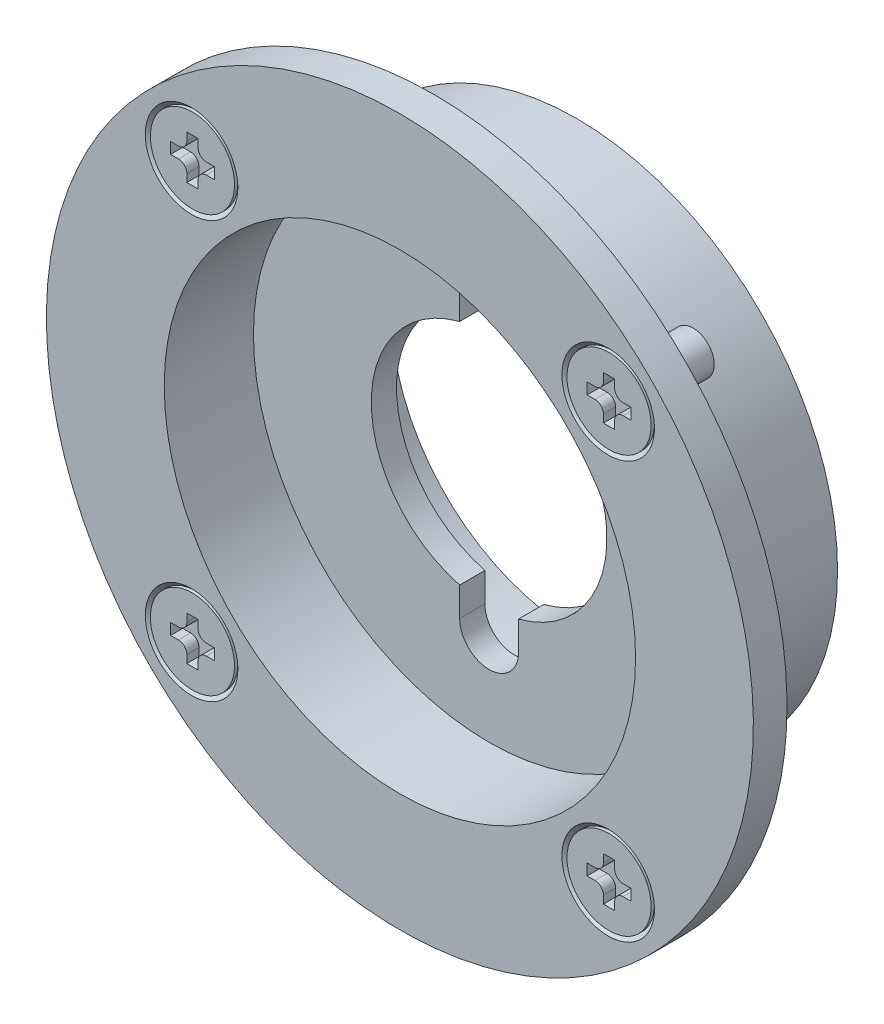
ISO-10303-21;
HEADER;
FILE_DESCRIPTION(('STEP AP214'),'2;1');
FILE_NAME('part.step','',(''),(''),'','','');
FILE_SCHEMA(('AUTOMOTIVE_DESIGN { 1 0 10303 214 1 1 1 1 }'));
ENDSEC;
DATA;
#1=APPLICATION_CONTEXT('core data for automotive mechanical design processes');
#2=APPLICATION_PROTOCOL_DEFINITION('international standard','automotive_design',2000,#1);
#3=PRODUCT_CONTEXT('',#1,'mechanical');
#4=PRODUCT('Part','Part','',(#3));
#5=PRODUCT_RELATED_PRODUCT_CATEGORY('part','',(#4));
#6=PRODUCT_DEFINITION_FORMATION('','',#4);
#7=PRODUCT_DEFINITION_CONTEXT('part definition',#1,'design');
#8=PRODUCT_DEFINITION('design','',#6,#7);
#9=PRODUCT_DEFINITION_SHAPE('','',#8);
#10=(LENGTH_UNIT() NAMED_UNIT(*) SI_UNIT(.MILLI.,.METRE.));
#11=(NAMED_UNIT(*) PLANE_ANGLE_UNIT() SI_UNIT($,.RADIAN.));
#12=(NAMED_UNIT(*) SI_UNIT($,.STERADIAN.) SOLID_ANGLE_UNIT());
#13=UNCERTAINTY_MEASURE_WITH_UNIT(LENGTH_MEASURE(1.E-05),#10,'distance_accuracy_value','');
#14=(GEOMETRIC_REPRESENTATION_CONTEXT(3) GLOBAL_UNCERTAINTY_ASSIGNED_CONTEXT((#13)) GLOBAL_UNIT_ASSIGNED_CONTEXT((#10,
#11,#12)) REPRESENTATION_CONTEXT('',''));
#15=CARTESIAN_POINT('',(0.,0.,0.));
#16=DIRECTION('',(0.,0.,1.));
#17=DIRECTION('',(1.,0.,0.));
#18=AXIS2_PLACEMENT_3D('',#15,#16,#17);
#19=CARTESIAN_POINT('',(11.1243686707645,-13.6406387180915,-5.04999999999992));
#20=DIRECTION('',(0.,0.,-1.));
#21=DIRECTION('',(0.,1.,0.));
#22=AXIS2_PLACEMENT_3D('',#19,#20,#21);
#23=PLANE('',#22);
#24=CARTESIAN_POINT('',(12.3743686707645,-12.3743686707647,-5.04999999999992));
#25=DIRECTION('',(0.,0.,-1.));
#26=DIRECTION('',(1.,-1.41721907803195E-07,0.));
#27=AXIS2_PLACEMENT_3D('',#24,#25,#26);
#28=CIRCLE('',#27,1.25);
#29=CARTESIAN_POINT('',(13.6243686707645,-12.3743688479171,-5.04999999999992));
#30=VERTEX_POINT('',#29);
#31=EDGE_CURVE('E1413',#30,#30,#28,.T.);
#32=ORIENTED_EDGE('',*,*,#31,.T.);
#33=EDGE_LOOP('',(#32));
#34=FACE_BOUND('',#33,.T.);
#35=ADVANCED_FACE('F14',(#34),#23,.T.);
#36=CARTESIAN_POINT('',(12.3743686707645,-12.3743686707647,-5.04999999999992));
#37=DIRECTION('',(0.,0.,-1.));
#38=DIRECTION('',(1.,7.69360437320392E-10,0.));
#39=AXIS2_PLACEMENT_3D('',#36,#37,#38);
#40=CYLINDRICAL_SURFACE('',#39,1.25);
#41=ORIENTED_EDGE('',*,*,#31,.F.);
#42=EDGE_LOOP('',(#41));
#43=FACE_BOUND('',#42,.T.);
#44=CARTESIAN_POINT('',(12.3743686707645,-12.3743686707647,-1.49999999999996));
#45=DIRECTION('',(0.,0.,1.));
#46=DIRECTION('',(1.,0.,0.));
#47=AXIS2_PLACEMENT_3D('',#44,#45,#46);
#48=CIRCLE('',#47,1.25);
#49=CARTESIAN_POINT('',(13.6243686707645,-12.3743686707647,-1.49999999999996));
#50=VERTEX_POINT('',#49);
#51=EDGE_CURVE('E24',#50,#50,#48,.F.);
#52=ORIENTED_EDGE('',*,*,#51,.T.);
#53=EDGE_LOOP('',(#52));
#54=FACE_BOUND('',#53,.T.);
#55=ADVANCED_FACE('F1653',(#43,#54),#40,.T.);
#56=CARTESIAN_POINT('',(12.3743686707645,-12.3743686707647,-0.249999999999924));
#57=DIRECTION('',(0.,0.,1.));
#58=DIRECTION('',(-1.,0.,0.));
#59=AXIS2_PLACEMENT_3D('',#56,#57,#58);
#60=CONICAL_SURFACE('',#59,2.5,0.785398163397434);
#61=ORIENTED_EDGE('',*,*,#51,.F.);
#62=EDGE_LOOP('',(#61));
#63=FACE_BOUND('',#62,.T.);
#64=CARTESIAN_POINT('',(12.3743686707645,-12.3743686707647,-1.29999999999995));
#65=DIRECTION('',(0.,0.,1.));
#66=DIRECTION('',(1.,0.,0.));
#67=AXIS2_PLACEMENT_3D('',#64,#65,#66);
#68=CIRCLE('',#67,1.45);
#69=CARTESIAN_POINT('',(13.8243686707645,-12.3743686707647,-1.29999999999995));
#70=VERTEX_POINT('',#69);
#71=EDGE_CURVE('E9',#70,#70,#68,.F.);
#72=ORIENTED_EDGE('',*,*,#71,.T.);
#73=EDGE_LOOP('',(#72));
#74=FACE_BOUND('',#73,.T.);
#75=ADVANCED_FACE('F1505',(#63,#74),#60,.T.);
#76=CARTESIAN_POINT('',(14.8743686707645,-14.8743686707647,-0.0499999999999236));
#77=DIRECTION('',(0.,0.,1.));
#78=DIRECTION('',(0.,1.,0.));
#79=AXIS2_PLACEMENT_3D('',#76,#77,#78);
#80=PLANE('',#79);
#81=CARTESIAN_POINT('',(12.3743686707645,-12.3743686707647,-0.0499999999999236));
#82=DIRECTION('',(0.,0.,1.));
#83=DIRECTION('',(-1.,0.,0.));
#84=AXIS2_PLACEMENT_3D('',#81,#82,#83);
#85=CIRCLE('',#84,2.5);
#86=CARTESIAN_POINT('',(9.87436867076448,-12.3743686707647,-0.0499999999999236));
#87=VERTEX_POINT('',#86);
#88=EDGE_CURVE('E1009',#87,#87,#85,.F.);
#89=ORIENTED_EDGE('',*,*,#88,.F.);
#90=EDGE_LOOP('',(#89));
#91=FACE_BOUND('',#90,.T.);
#92=DIRECTION('',(-1.,0.,0.));
#93=VECTOR('',#92,1.);
#94=CARTESIAN_POINT('',(13.6743686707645,-12.707702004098,-0.0499999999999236));
#95=LINE('',#94,#93);
#96=CARTESIAN_POINT('',(13.6743686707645,-12.707702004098,-0.0499999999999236));
#97=VERTEX_POINT('',#96);
#98=CARTESIAN_POINT('',(13.2077020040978,-12.707702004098,-0.0499999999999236));
#99=VERTEX_POINT('',#98);
#100=EDGE_CURVE('E1491',#97,#99,#95,.T.);
#101=ORIENTED_EDGE('',*,*,#100,.T.);
#102=CARTESIAN_POINT('',(13.2077020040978,-13.207702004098,-0.0499999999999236));
#103=DIRECTION('',(0.,0.,1.));
#104=DIRECTION('',(0.,1.,0.));
#105=AXIS2_PLACEMENT_3D('',#102,#103,#104);
#106=CIRCLE('',#105,0.500000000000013);
#107=CARTESIAN_POINT('',(12.7077020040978,-13.207702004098,-0.0499999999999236));
#108=VERTEX_POINT('',#107);
#109=EDGE_CURVE('E1486',#108,#99,#106,.F.);
#110=ORIENTED_EDGE('',*,*,#109,.F.);
#111=DIRECTION('',(0.,-1.,0.));
#112=VECTOR('',#111,1.);
#113=CARTESIAN_POINT('',(12.7077020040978,-13.207702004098,-0.0499999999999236));
#114=LINE('',#113,#112);
#115=CARTESIAN_POINT('',(12.7077020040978,-13.6743686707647,-0.0499999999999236));
#116=VERTEX_POINT('',#115);
#117=EDGE_CURVE('E1481',#108,#116,#114,.T.);
#118=ORIENTED_EDGE('',*,*,#117,.T.);
#119=DIRECTION('',(-1.,0.,0.));
#120=VECTOR('',#119,1.);
#121=CARTESIAN_POINT('',(12.7077020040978,-13.6743686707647,-0.0499999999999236));
#122=LINE('',#121,#120);
#123=CARTESIAN_POINT('',(12.0410353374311,-13.6743686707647,-0.0499999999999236));
#124=VERTEX_POINT('',#123);
#125=EDGE_CURVE('E1476',#116,#124,#122,.T.);
#126=ORIENTED_EDGE('',*,*,#125,.T.);
#127=DIRECTION('',(0.,1.,0.));
#128=VECTOR('',#127,1.);
#129=CARTESIAN_POINT('',(12.0410353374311,-13.6743686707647,-0.0499999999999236));
#130=LINE('',#129,#128);
#131=CARTESIAN_POINT('',(12.0410353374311,-13.207702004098,-0.0499999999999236));
#132=VERTEX_POINT('',#131);
#133=EDGE_CURVE('E1471',#124,#132,#130,.T.);
#134=ORIENTED_EDGE('',*,*,#133,.T.);
#135=CARTESIAN_POINT('',(11.5410353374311,-13.207702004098,-0.0499999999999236));
#136=DIRECTION('',(0.,0.,1.));
#137=DIRECTION('',(1.,0.,0.));
#138=AXIS2_PLACEMENT_3D('',#135,#136,#137);
#139=CIRCLE('',#138,0.5);
#140=CARTESIAN_POINT('',(11.5410353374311,-12.707702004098,-0.0499999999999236));
#141=VERTEX_POINT('',#140);
#142=EDGE_CURVE('E1466',#141,#132,#139,.F.);
#143=ORIENTED_EDGE('',*,*,#142,.F.);
#144=DIRECTION('',(-1.,0.,0.));
#145=VECTOR('',#144,1.);
#146=CARTESIAN_POINT('',(11.5410353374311,-12.707702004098,-0.0499999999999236));
#147=LINE('',#146,#145);
#148=CARTESIAN_POINT('',(11.0743686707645,-12.707702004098,-0.0499999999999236));
#149=VERTEX_POINT('',#148);
#150=EDGE_CURVE('E1461',#141,#149,#147,.T.);
#151=ORIENTED_EDGE('',*,*,#150,.T.);
#152=DIRECTION('',(0.,1.,0.));
#153=VECTOR('',#152,1.);
#154=CARTESIAN_POINT('',(11.0743686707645,-12.707702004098,-0.0499999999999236));
#155=LINE('',#154,#153);
#156=CARTESIAN_POINT('',(11.0743686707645,-12.0410353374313,-0.0499999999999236));
#157=VERTEX_POINT('',#156);
#158=EDGE_CURVE('E1456',#149,#157,#155,.T.);
#159=ORIENTED_EDGE('',*,*,#158,.T.);
#160=DIRECTION('',(1.,0.,0.));
#161=VECTOR('',#160,1.);
#162=CARTESIAN_POINT('',(11.0743686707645,-12.0410353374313,-0.0499999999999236));
#163=LINE('',#162,#161);
#164=CARTESIAN_POINT('',(11.5410353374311,-12.0410353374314,-0.0499999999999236));
#165=VERTEX_POINT('',#164);
#166=EDGE_CURVE('E1451',#157,#165,#163,.T.);
#167=ORIENTED_EDGE('',*,*,#166,.T.);
#168=CARTESIAN_POINT('',(11.5410353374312,-11.5410353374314,-0.0499999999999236));
#169=DIRECTION('',(0.,0.,1.));
#170=DIRECTION('',(0.,-1.,0.));
#171=AXIS2_PLACEMENT_3D('',#168,#169,#170);
#172=CIRCLE('',#171,0.5);
#173=CARTESIAN_POINT('',(12.0410353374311,-11.5410353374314,-0.0499999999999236));
#174=VERTEX_POINT('',#173);
#175=EDGE_CURVE('E1446',#174,#165,#172,.F.);
#176=ORIENTED_EDGE('',*,*,#175,.F.);
#177=DIRECTION('',(0.,1.,0.));
#178=VECTOR('',#177,1.);
#179=CARTESIAN_POINT('',(12.0410353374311,-11.5410353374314,-0.0499999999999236));
#180=LINE('',#179,#178);
#181=CARTESIAN_POINT('',(12.0410353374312,-11.0743686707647,-0.0499999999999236));
#182=VERTEX_POINT('',#181);
#183=EDGE_CURVE('E1441',#174,#182,#180,.T.);
#184=ORIENTED_EDGE('',*,*,#183,.T.);
#185=DIRECTION('',(1.,0.,0.));
#186=VECTOR('',#185,1.);
#187=CARTESIAN_POINT('',(12.0410353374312,-11.0743686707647,-0.0499999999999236));
#188=LINE('',#187,#186);
#189=CARTESIAN_POINT('',(12.7077020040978,-11.0743686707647,-0.0499999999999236));
#190=VERTEX_POINT('',#189);
#191=EDGE_CURVE('E1436',#190,#182,#188,.F.);
#192=ORIENTED_EDGE('',*,*,#191,.F.);
#193=DIRECTION('',(0.,-1.,0.));
#194=VECTOR('',#193,1.);
#195=CARTESIAN_POINT('',(12.7077020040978,-11.0743686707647,-0.0499999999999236));
#196=LINE('',#195,#194);
#197=CARTESIAN_POINT('',(12.7077020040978,-11.5410353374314,-0.0499999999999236));
#198=VERTEX_POINT('',#197);
#199=EDGE_CURVE('E1431',#190,#198,#196,.T.);
#200=ORIENTED_EDGE('',*,*,#199,.T.);
#201=CARTESIAN_POINT('',(13.2077020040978,-11.5410353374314,-0.0499999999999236));
#202=DIRECTION('',(0.,0.,1.));
#203=DIRECTION('',(-1.,0.,0.));
#204=AXIS2_PLACEMENT_3D('',#201,#202,#203);
#205=CIRCLE('',#204,0.500000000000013);
#206=CARTESIAN_POINT('',(13.2077020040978,-12.0410353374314,-0.0499999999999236));
#207=VERTEX_POINT('',#206);
#208=EDGE_CURVE('E1426',#207,#198,#205,.F.);
#209=ORIENTED_EDGE('',*,*,#208,.F.);
#210=DIRECTION('',(1.,0.,0.));
#211=VECTOR('',#210,1.);
#212=CARTESIAN_POINT('',(13.2077020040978,-12.0410353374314,-0.0499999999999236));
#213=LINE('',#212,#211);
#214=CARTESIAN_POINT('',(13.6743686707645,-12.0410353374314,-0.0499999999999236));
#215=VERTEX_POINT('',#214);
#216=EDGE_CURVE('E1421',#207,#215,#213,.T.);
#217=ORIENTED_EDGE('',*,*,#216,.T.);
#218=DIRECTION('',(0.,-1.,0.));
#219=VECTOR('',#218,1.);
#220=CARTESIAN_POINT('',(13.6743686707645,-12.0410353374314,-0.0499999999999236));
#221=LINE('',#220,#219);
#222=EDGE_CURVE('E1416',#215,#97,#221,.T.);
#223=ORIENTED_EDGE('',*,*,#222,.T.);
#224=EDGE_LOOP('',(#101,#110,#118,#126,#134,#143,#151,#159,#167,#176,#184,#192,#200,#209,#217,#223));
#225=FACE_BOUND('',#224,.T.);
#226=ADVANCED_FACE('F1501',(#91,#225),#80,.T.);
#227=CARTESIAN_POINT('',(13.6743686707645,-12.707702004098,-0.774999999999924));
#228=DIRECTION('',(-1.,0.,0.));
#229=DIRECTION('',(0.,0.,1.));
#230=AXIS2_PLACEMENT_3D('',#227,#228,#229);
#231=PLANE('',#230);
#232=ORIENTED_EDGE('',*,*,#222,.F.);
#233=DIRECTION('',(0.,0.,-1.));
#234=VECTOR('',#233,1.);
#235=CARTESIAN_POINT('',(13.6743686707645,-12.0410353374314,-0.0499999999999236));
#236=LINE('',#235,#234);
#237=CARTESIAN_POINT('',(13.6743686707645,-12.0410353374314,-0.774999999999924));
#238=VERTEX_POINT('',#237);
#239=EDGE_CURVE('E1408',#238,#215,#236,.F.);
#240=ORIENTED_EDGE('',*,*,#239,.F.);
#241=DIRECTION('',(0.,-1.,0.));
#242=VECTOR('',#241,1.);
#243=CARTESIAN_POINT('',(13.6743686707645,-12.0410353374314,-0.774999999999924));
#244=LINE('',#243,#242);
#245=CARTESIAN_POINT('',(13.6743686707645,-12.707702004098,-0.774999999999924));
#246=VERTEX_POINT('',#245);
#247=EDGE_CURVE('E1403',#238,#246,#244,.T.);
#248=ORIENTED_EDGE('',*,*,#247,.T.);
#249=DIRECTION('',(0.,0.,1.));
#250=VECTOR('',#249,1.);
#251=CARTESIAN_POINT('',(13.6743686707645,-12.707702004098,-0.774999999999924));
#252=LINE('',#251,#250);
#253=EDGE_CURVE('E1398',#246,#97,#252,.T.);
#254=ORIENTED_EDGE('',*,*,#253,.T.);
#255=EDGE_LOOP('',(#232,#240,#248,#254));
#256=FACE_BOUND('',#255,.T.);
#257=ADVANCED_FACE('F1504',(#256),#231,.T.);
#258=CARTESIAN_POINT('',(13.2077020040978,-12.707702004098,-0.0499999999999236));
#259=DIRECTION('',(0.,1.,0.));
#260=DIRECTION('',(1.,0.,0.));
#261=AXIS2_PLACEMENT_3D('',#258,#259,#260);
#262=PLANE('',#261);
#263=ORIENTED_EDGE('',*,*,#100,.F.);
#264=ORIENTED_EDGE('',*,*,#253,.F.);
#265=DIRECTION('',(-1.,0.,0.));
#266=VECTOR('',#265,1.);
#267=CARTESIAN_POINT('',(13.6743686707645,-12.707702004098,-0.774999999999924));
#268=LINE('',#267,#266);
#269=CARTESIAN_POINT('',(13.2077020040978,-12.707702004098,-0.774999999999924));
#270=VERTEX_POINT('',#269);
#271=EDGE_CURVE('E1393',#246,#270,#268,.T.);
#272=ORIENTED_EDGE('',*,*,#271,.T.);
#273=DIRECTION('',(0.,0.,1.));
#274=VECTOR('',#273,1.);
#275=CARTESIAN_POINT('',(13.2077020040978,-12.707702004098,-0.774999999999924));
#276=LINE('',#275,#274);
#277=EDGE_CURVE('E1388',#270,#99,#276,.T.);
#278=ORIENTED_EDGE('',*,*,#277,.T.);
#279=EDGE_LOOP('',(#263,#264,#272,#278));
#280=FACE_BOUND('',#279,.T.);
#281=ADVANCED_FACE('F1516',(#280),#262,.T.);
#282=CARTESIAN_POINT('',(13.2077020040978,-13.207702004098,-0.774999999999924));
#283=DIRECTION('',(0.,0.,1.));
#284=DIRECTION('',(0.,1.,0.));
#285=AXIS2_PLACEMENT_3D('',#282,#283,#284);
#286=CYLINDRICAL_SURFACE('',#285,0.500000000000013);
#287=ORIENTED_EDGE('',*,*,#109,.T.);
#288=ORIENTED_EDGE('',*,*,#277,.F.);
#289=CARTESIAN_POINT('',(13.2077020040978,-13.207702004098,-0.774999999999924));
#290=DIRECTION('',(0.,0.,1.));
#291=DIRECTION('',(0.,1.,0.));
#292=AXIS2_PLACEMENT_3D('',#289,#290,#291);
#293=CIRCLE('',#292,0.500000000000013);
#294=CARTESIAN_POINT('',(12.7077020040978,-13.207702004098,-0.774999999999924));
#295=VERTEX_POINT('',#294);
#296=EDGE_CURVE('E1383',#295,#270,#293,.F.);
#297=ORIENTED_EDGE('',*,*,#296,.F.);
#298=DIRECTION('',(0.,0.,1.));
#299=VECTOR('',#298,1.);
#300=CARTESIAN_POINT('',(12.7077020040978,-13.207702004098,-0.774999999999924));
#301=LINE('',#300,#299);
#302=EDGE_CURVE('E1378',#295,#108,#301,.T.);
#303=ORIENTED_EDGE('',*,*,#302,.T.);
#304=EDGE_LOOP('',(#287,#288,#297,#303));
#305=FACE_BOUND('',#304,.T.);
#306=ADVANCED_FACE('F1633',(#305),#286,.T.);
#307=CARTESIAN_POINT('',(12.7077020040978,-13.6743686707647,-0.774999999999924));
#308=DIRECTION('',(-1.,0.,0.));
#309=DIRECTION('',(0.,0.,1.));
#310=AXIS2_PLACEMENT_3D('',#307,#308,#309);
#311=PLANE('',#310);
#312=ORIENTED_EDGE('',*,*,#117,.F.);
#313=ORIENTED_EDGE('',*,*,#302,.F.);
#314=DIRECTION('',(0.,-1.,0.));
#315=VECTOR('',#314,1.);
#316=CARTESIAN_POINT('',(12.7077020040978,-13.207702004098,-0.774999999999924));
#317=LINE('',#316,#315);
#318=CARTESIAN_POINT('',(12.7077020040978,-13.6743686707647,-0.774999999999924));
#319=VERTEX_POINT('',#318);
#320=EDGE_CURVE('E1373',#295,#319,#317,.T.);
#321=ORIENTED_EDGE('',*,*,#320,.T.);
#322=DIRECTION('',(0.,0.,1.));
#323=VECTOR('',#322,1.);
#324=CARTESIAN_POINT('',(12.7077020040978,-13.6743686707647,-0.774999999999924));
#325=LINE('',#324,#323);
#326=EDGE_CURVE('E1368',#319,#116,#325,.T.);
#327=ORIENTED_EDGE('',*,*,#326,.T.);
#328=EDGE_LOOP('',(#312,#313,#321,#327));
#329=FACE_BOUND('',#328,.T.);
#330=ADVANCED_FACE('F1630',(#329),#311,.T.);
#331=CARTESIAN_POINT('',(12.0410353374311,-13.6743686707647,-0.0499999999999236));
#332=DIRECTION('',(0.,1.,0.));
#333=DIRECTION('',(1.,0.,0.));
#334=AXIS2_PLACEMENT_3D('',#331,#332,#333);
#335=PLANE('',#334);
#336=ORIENTED_EDGE('',*,*,#125,.F.);
#337=ORIENTED_EDGE('',*,*,#326,.F.);
#338=DIRECTION('',(-1.,0.,0.));
#339=VECTOR('',#338,1.);
#340=CARTESIAN_POINT('',(12.7077020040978,-13.6743686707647,-0.774999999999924));
#341=LINE('',#340,#339);
#342=CARTESIAN_POINT('',(12.0410353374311,-13.6743686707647,-0.774999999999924));
#343=VERTEX_POINT('',#342);
#344=EDGE_CURVE('E1363',#319,#343,#341,.T.);
#345=ORIENTED_EDGE('',*,*,#344,.T.);
#346=DIRECTION('',(0.,0.,1.));
#347=VECTOR('',#346,1.);
#348=CARTESIAN_POINT('',(12.0410353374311,-13.6743686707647,-0.774999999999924));
#349=LINE('',#348,#347);
#350=EDGE_CURVE('E1358',#343,#124,#349,.T.);
#351=ORIENTED_EDGE('',*,*,#350,.T.);
#352=EDGE_LOOP('',(#336,#337,#345,#351));
#353=FACE_BOUND('',#352,.T.);
#354=ADVANCED_FACE('F1617',(#353),#335,.T.);
#355=CARTESIAN_POINT('',(12.0410353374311,-13.6743686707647,-0.0499999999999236));
#356=DIRECTION('',(1.,0.,0.));
#357=DIRECTION('',(0.,0.,-1.));
#358=AXIS2_PLACEMENT_3D('',#355,#356,#357);
#359=PLANE('',#358);
#360=ORIENTED_EDGE('',*,*,#133,.F.);
#361=ORIENTED_EDGE('',*,*,#350,.F.);
#362=DIRECTION('',(0.,1.,0.));
#363=VECTOR('',#362,1.);
#364=CARTESIAN_POINT('',(12.0410353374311,-13.6743686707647,-0.774999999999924));
#365=LINE('',#364,#363);
#366=CARTESIAN_POINT('',(12.0410353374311,-13.207702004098,-0.774999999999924));
#367=VERTEX_POINT('',#366);
#368=EDGE_CURVE('E1353',#343,#367,#365,.T.);
#369=ORIENTED_EDGE('',*,*,#368,.T.);
#370=DIRECTION('',(0.,0.,1.));
#371=VECTOR('',#370,1.);
#372=CARTESIAN_POINT('',(12.0410353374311,-13.207702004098,-0.774999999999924));
#373=LINE('',#372,#371);
#374=EDGE_CURVE('E1348',#367,#132,#373,.T.);
#375=ORIENTED_EDGE('',*,*,#374,.T.);
#376=EDGE_LOOP('',(#360,#361,#369,#375));
#377=FACE_BOUND('',#376,.T.);
#378=ADVANCED_FACE('F1612',(#377),#359,.T.);
#379=CARTESIAN_POINT('',(11.5410353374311,-13.207702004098,-0.774999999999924));
#380=DIRECTION('',(0.,0.,1.));
#381=DIRECTION('',(1.,0.,0.));
#382=AXIS2_PLACEMENT_3D('',#379,#380,#381);
#383=CYLINDRICAL_SURFACE('',#382,0.5);
#384=ORIENTED_EDGE('',*,*,#142,.T.);
#385=ORIENTED_EDGE('',*,*,#374,.F.);
#386=CARTESIAN_POINT('',(11.5410353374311,-13.207702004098,-0.774999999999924));
#387=DIRECTION('',(0.,0.,1.));
#388=DIRECTION('',(1.,0.,0.));
#389=AXIS2_PLACEMENT_3D('',#386,#387,#388);
#390=CIRCLE('',#389,0.5);
#391=CARTESIAN_POINT('',(11.5410353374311,-12.707702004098,-0.774999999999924));
#392=VERTEX_POINT('',#391);
#393=EDGE_CURVE('E1343',#392,#367,#390,.F.);
#394=ORIENTED_EDGE('',*,*,#393,.F.);
#395=DIRECTION('',(0.,0.,1.));
#396=VECTOR('',#395,1.);
#397=CARTESIAN_POINT('',(11.5410353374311,-12.707702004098,-0.774999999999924));
#398=LINE('',#397,#396);
#399=EDGE_CURVE('E1338',#392,#141,#398,.T.);
#400=ORIENTED_EDGE('',*,*,#399,.T.);
#401=EDGE_LOOP('',(#384,#385,#394,#400));
#402=FACE_BOUND('',#401,.T.);
#403=ADVANCED_FACE('F1602',(#402),#383,.T.);
#404=CARTESIAN_POINT('',(11.0743686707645,-12.707702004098,-0.0499999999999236));
#405=DIRECTION('',(0.,1.,0.));
#406=DIRECTION('',(1.,0.,0.));
#407=AXIS2_PLACEMENT_3D('',#404,#405,#406);
#408=PLANE('',#407);
#409=ORIENTED_EDGE('',*,*,#150,.F.);
#410=ORIENTED_EDGE('',*,*,#399,.F.);
#411=DIRECTION('',(-1.,0.,0.));
#412=VECTOR('',#411,1.);
#413=CARTESIAN_POINT('',(11.5410353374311,-12.707702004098,-0.774999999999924));
#414=LINE('',#413,#412);
#415=CARTESIAN_POINT('',(11.0743686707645,-12.707702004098,-0.774999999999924));
#416=VERTEX_POINT('',#415);
#417=EDGE_CURVE('E1333',#392,#416,#414,.T.);
#418=ORIENTED_EDGE('',*,*,#417,.T.);
#419=DIRECTION('',(0.,0.,1.));
#420=VECTOR('',#419,1.);
#421=CARTESIAN_POINT('',(11.0743686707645,-12.707702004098,-0.774999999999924));
#422=LINE('',#421,#420);
#423=EDGE_CURVE('E1328',#416,#149,#422,.T.);
#424=ORIENTED_EDGE('',*,*,#423,.T.);
#425=EDGE_LOOP('',(#409,#410,#418,#424));
#426=FACE_BOUND('',#425,.T.);
#427=ADVANCED_FACE('F1596',(#426),#408,.T.);
#428=CARTESIAN_POINT('',(11.0743686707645,-12.707702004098,-0.0499999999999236));
#429=DIRECTION('',(1.,0.,0.));
#430=DIRECTION('',(0.,0.,-1.));
#431=AXIS2_PLACEMENT_3D('',#428,#429,#430);
#432=PLANE('',#431);
#433=ORIENTED_EDGE('',*,*,#158,.F.);
#434=ORIENTED_EDGE('',*,*,#423,.F.);
#435=DIRECTION('',(0.,1.,0.));
#436=VECTOR('',#435,1.);
#437=CARTESIAN_POINT('',(11.0743686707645,-12.707702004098,-0.774999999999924));
#438=LINE('',#437,#436);
#439=CARTESIAN_POINT('',(11.0743686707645,-12.0410353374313,-0.774999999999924));
#440=VERTEX_POINT('',#439);
#441=EDGE_CURVE('E1323',#416,#440,#438,.T.);
#442=ORIENTED_EDGE('',*,*,#441,.T.);
#443=DIRECTION('',(0.,0.,1.));
#444=VECTOR('',#443,1.);
#445=CARTESIAN_POINT('',(11.0743686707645,-12.0410353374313,-0.774999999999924));
#446=LINE('',#445,#444);
#447=EDGE_CURVE('E1318',#440,#157,#446,.T.);
#448=ORIENTED_EDGE('',*,*,#447,.T.);
#449=EDGE_LOOP('',(#433,#434,#442,#448));
#450=FACE_BOUND('',#449,.T.);
#451=ADVANCED_FACE('F1583',(#450),#432,.T.);
#452=CARTESIAN_POINT('',(11.5410353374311,-12.0410353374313,-0.0499999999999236));
#453=DIRECTION('',(0.,-1.,0.));
#454=DIRECTION('',(-1.,0.,0.));
#455=AXIS2_PLACEMENT_3D('',#452,#453,#454);
#456=PLANE('',#455);
#457=ORIENTED_EDGE('',*,*,#166,.F.);
#458=ORIENTED_EDGE('',*,*,#447,.F.);
#459=DIRECTION('',(1.,0.,0.));
#460=VECTOR('',#459,1.);
#461=CARTESIAN_POINT('',(11.0743686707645,-12.0410353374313,-0.774999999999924));
#462=LINE('',#461,#460);
#463=CARTESIAN_POINT('',(11.5410353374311,-12.0410353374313,-0.774999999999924));
#464=VERTEX_POINT('',#463);
#465=EDGE_CURVE('E1313',#440,#464,#462,.T.);
#466=ORIENTED_EDGE('',*,*,#465,.T.);
#467=DIRECTION('',(0.,0.,1.));
#468=VECTOR('',#467,1.);
#469=CARTESIAN_POINT('',(11.5410353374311,-12.0410353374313,-0.774999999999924));
#470=LINE('',#469,#468);
#471=EDGE_CURVE('E1308',#464,#165,#470,.T.);
#472=ORIENTED_EDGE('',*,*,#471,.T.);
#473=EDGE_LOOP('',(#457,#458,#466,#472));
#474=FACE_BOUND('',#473,.T.);
#475=ADVANCED_FACE('F1578',(#474),#456,.T.);
#476=CARTESIAN_POINT('',(11.5410353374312,-11.5410353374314,-0.774999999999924));
#477=DIRECTION('',(0.,0.,1.));
#478=DIRECTION('',(0.,-1.,0.));
#479=AXIS2_PLACEMENT_3D('',#476,#477,#478);
#480=CYLINDRICAL_SURFACE('',#479,0.5);
#481=ORIENTED_EDGE('',*,*,#175,.T.);
#482=ORIENTED_EDGE('',*,*,#471,.F.);
#483=CARTESIAN_POINT('',(11.5410353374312,-11.5410353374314,-0.774999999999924));
#484=DIRECTION('',(0.,0.,1.));
#485=DIRECTION('',(0.,-1.,0.));
#486=AXIS2_PLACEMENT_3D('',#483,#484,#485);
#487=CIRCLE('',#486,0.5);
#488=CARTESIAN_POINT('',(12.0410353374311,-11.5410353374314,-0.774999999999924));
#489=VERTEX_POINT('',#488);
#490=EDGE_CURVE('E1303',#489,#464,#487,.F.);
#491=ORIENTED_EDGE('',*,*,#490,.F.);
#492=DIRECTION('',(0.,0.,1.));
#493=VECTOR('',#492,1.);
#494=CARTESIAN_POINT('',(12.0410353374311,-11.5410353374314,-0.774999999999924));
#495=LINE('',#494,#493);
#496=EDGE_CURVE('E1298',#489,#174,#495,.T.);
#497=ORIENTED_EDGE('',*,*,#496,.T.);
#498=EDGE_LOOP('',(#481,#482,#491,#497));
#499=FACE_BOUND('',#498,.T.);
#500=ADVANCED_FACE('F1568',(#499),#480,.T.);
#501=CARTESIAN_POINT('',(12.0410353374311,-11.5410353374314,-0.0499999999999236));
#502=DIRECTION('',(1.,0.,0.));
#503=DIRECTION('',(0.,0.,-1.));
#504=AXIS2_PLACEMENT_3D('',#501,#502,#503);
#505=PLANE('',#504);
#506=ORIENTED_EDGE('',*,*,#183,.F.);
#507=ORIENTED_EDGE('',*,*,#496,.F.);
#508=DIRECTION('',(0.,1.,0.));
#509=VECTOR('',#508,1.);
#510=CARTESIAN_POINT('',(12.0410353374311,-11.5410353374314,-0.774999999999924));
#511=LINE('',#510,#509);
#512=CARTESIAN_POINT('',(12.0410353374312,-11.0743686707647,-0.774999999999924));
#513=VERTEX_POINT('',#512);
#514=EDGE_CURVE('E1293',#489,#513,#511,.T.);
#515=ORIENTED_EDGE('',*,*,#514,.T.);
#516=DIRECTION('',(0.,0.,1.));
#517=VECTOR('',#516,1.);
#518=CARTESIAN_POINT('',(12.0410353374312,-11.0743686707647,-0.774999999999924));
#519=LINE('',#518,#517);
#520=EDGE_CURVE('E1288',#513,#182,#519,.T.);
#521=ORIENTED_EDGE('',*,*,#520,.T.);
#522=EDGE_LOOP('',(#506,#507,#515,#521));
#523=FACE_BOUND('',#522,.T.);
#524=ADVANCED_FACE('F1562',(#523),#505,.T.);
#525=CARTESIAN_POINT('',(12.7077020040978,-11.0743686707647,-0.0499999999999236));
#526=DIRECTION('',(0.,-1.,0.));
#527=DIRECTION('',(-1.,0.,0.));
#528=AXIS2_PLACEMENT_3D('',#525,#526,#527);
#529=PLANE('',#528);
#530=ORIENTED_EDGE('',*,*,#191,.T.);
#531=ORIENTED_EDGE('',*,*,#520,.F.);
#532=DIRECTION('',(1.,0.,0.));
#533=VECTOR('',#532,1.);
#534=CARTESIAN_POINT('',(12.0410353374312,-11.0743686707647,-0.774999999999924));
#535=LINE('',#534,#533);
#536=CARTESIAN_POINT('',(12.7077020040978,-11.0743686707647,-0.774999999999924));
#537=VERTEX_POINT('',#536);
#538=EDGE_CURVE('E1283',#513,#537,#535,.T.);
#539=ORIENTED_EDGE('',*,*,#538,.T.);
#540=DIRECTION('',(0.,0.,1.));
#541=VECTOR('',#540,1.);
#542=CARTESIAN_POINT('',(12.7077020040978,-11.0743686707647,-0.774999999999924));
#543=LINE('',#542,#541);
#544=EDGE_CURVE('E1278',#537,#190,#543,.T.);
#545=ORIENTED_EDGE('',*,*,#544,.T.);
#546=EDGE_LOOP('',(#530,#531,#539,#545));
#547=FACE_BOUND('',#546,.T.);
#548=ADVANCED_FACE('F1550',(#547),#529,.T.);
#549=CARTESIAN_POINT('',(12.7077020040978,-11.5410353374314,-0.774999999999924));
#550=DIRECTION('',(-1.,0.,0.));
#551=DIRECTION('',(0.,0.,1.));
#552=AXIS2_PLACEMENT_3D('',#549,#550,#551);
#553=PLANE('',#552);
#554=ORIENTED_EDGE('',*,*,#199,.F.);
#555=ORIENTED_EDGE('',*,*,#544,.F.);
#556=DIRECTION('',(0.,-1.,0.));
#557=VECTOR('',#556,1.);
#558=CARTESIAN_POINT('',(12.7077020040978,-11.0743686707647,-0.774999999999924));
#559=LINE('',#558,#557);
#560=CARTESIAN_POINT('',(12.7077020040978,-11.5410353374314,-0.774999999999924));
#561=VERTEX_POINT('',#560);
#562=EDGE_CURVE('E1273',#537,#561,#559,.T.);
#563=ORIENTED_EDGE('',*,*,#562,.T.);
#564=DIRECTION('',(0.,0.,1.));
#565=VECTOR('',#564,1.);
#566=CARTESIAN_POINT('',(12.7077020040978,-11.5410353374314,-0.774999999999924));
#567=LINE('',#566,#565);
#568=EDGE_CURVE('E1268',#561,#198,#567,.T.);
#569=ORIENTED_EDGE('',*,*,#568,.T.);
#570=EDGE_LOOP('',(#554,#555,#563,#569));
#571=FACE_BOUND('',#570,.T.);
#572=ADVANCED_FACE('F1546',(#571),#553,.T.);
#573=CARTESIAN_POINT('',(13.2077020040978,-11.5410353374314,-0.774999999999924));
#574=DIRECTION('',(0.,0.,1.));
#575=DIRECTION('',(-1.,0.,0.));
#576=AXIS2_PLACEMENT_3D('',#573,#574,#575);
#577=CYLINDRICAL_SURFACE('',#576,0.500000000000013);
#578=ORIENTED_EDGE('',*,*,#208,.T.);
#579=ORIENTED_EDGE('',*,*,#568,.F.);
#580=CARTESIAN_POINT('',(13.2077020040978,-11.5410353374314,-0.774999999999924));
#581=DIRECTION('',(0.,0.,1.));
#582=DIRECTION('',(-1.,0.,0.));
#583=AXIS2_PLACEMENT_3D('',#580,#581,#582);
#584=CIRCLE('',#583,0.500000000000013);
#585=CARTESIAN_POINT('',(13.2077020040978,-12.0410353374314,-0.774999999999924));
#586=VERTEX_POINT('',#585);
#587=EDGE_CURVE('E1264',#586,#561,#584,.F.);
#588=ORIENTED_EDGE('',*,*,#587,.F.);
#589=DIRECTION('',(0.,0.,1.));
#590=VECTOR('',#589,1.);
#591=CARTESIAN_POINT('',(13.2077020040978,-12.0410353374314,-0.774999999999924));
#592=LINE('',#591,#590);
#593=EDGE_CURVE('E1259',#586,#207,#592,.T.);
#594=ORIENTED_EDGE('',*,*,#593,.T.);
#595=EDGE_LOOP('',(#578,#579,#588,#594));
#596=FACE_BOUND('',#595,.T.);
#597=ADVANCED_FACE('F1536',(#596),#577,.T.);
#598=CARTESIAN_POINT('',(13.6743686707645,-12.0410353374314,-0.0499999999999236));
#599=DIRECTION('',(0.,-1.,0.));
#600=DIRECTION('',(-1.,0.,0.));
#601=AXIS2_PLACEMENT_3D('',#598,#599,#600);
#602=PLANE('',#601);
#603=ORIENTED_EDGE('',*,*,#216,.F.);
#604=ORIENTED_EDGE('',*,*,#593,.F.);
#605=DIRECTION('',(1.,0.,0.));
#606=VECTOR('',#605,1.);
#607=CARTESIAN_POINT('',(13.2077020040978,-12.0410353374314,-0.774999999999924));
#608=LINE('',#607,#606);
#609=EDGE_CURVE('E33',#586,#238,#608,.T.);
#610=ORIENTED_EDGE('',*,*,#609,.T.);
#611=ORIENTED_EDGE('',*,*,#239,.T.);
#612=EDGE_LOOP('',(#603,#604,#610,#611));
#613=FACE_BOUND('',#612,.T.);
#614=ADVANCED_FACE('F1532',(#613),#602,.T.);
#615=CARTESIAN_POINT('',(13.6743686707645,-13.6743686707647,-0.774999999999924));
#616=DIRECTION('',(0.,0.,1.));
#617=DIRECTION('',(0.,1.,0.));
#618=AXIS2_PLACEMENT_3D('',#615,#616,#617);
#619=PLANE('',#618);
#620=ORIENTED_EDGE('',*,*,#247,.F.);
#621=ORIENTED_EDGE('',*,*,#609,.F.);
#622=ORIENTED_EDGE('',*,*,#587,.T.);
#623=ORIENTED_EDGE('',*,*,#562,.F.);
#624=ORIENTED_EDGE('',*,*,#538,.F.);
#625=ORIENTED_EDGE('',*,*,#514,.F.);
#626=ORIENTED_EDGE('',*,*,#490,.T.);
#627=ORIENTED_EDGE('',*,*,#465,.F.);
#628=ORIENTED_EDGE('',*,*,#441,.F.);
#629=ORIENTED_EDGE('',*,*,#417,.F.);
#630=ORIENTED_EDGE('',*,*,#393,.T.);
#631=ORIENTED_EDGE('',*,*,#368,.F.);
#632=ORIENTED_EDGE('',*,*,#344,.F.);
#633=ORIENTED_EDGE('',*,*,#320,.F.);
#634=ORIENTED_EDGE('',*,*,#296,.T.);
#635=ORIENTED_EDGE('',*,*,#271,.F.);
#636=EDGE_LOOP('',(#620,#621,#622,#623,#624,#625,#626,#627,#628,#629,#630,#631,#632,#633,#634,#635));
#637=FACE_BOUND('',#636,.T.);
#638=ADVANCED_FACE('F1527',(#637),#619,.T.);
#639=CARTESIAN_POINT('',(12.3743686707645,-12.3743686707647,-5.04999999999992));
#640=DIRECTION('',(0.,0.,-1.));
#641=DIRECTION('',(1.,1.92315803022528E-10,0.));
#642=AXIS2_PLACEMENT_3D('',#639,#640,#641);
#643=CYLINDRICAL_SURFACE('',#642,2.5);
#644=CARTESIAN_POINT('',(12.3743686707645,-12.3743686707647,-0.249999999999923));
#645=DIRECTION('',(0.,0.,1.));
#646=DIRECTION('',(-1.,0.,0.));
#647=AXIS2_PLACEMENT_3D('',#644,#645,#646);
#648=CIRCLE('',#647,2.5);
#649=CARTESIAN_POINT('',(9.87436867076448,-12.3743686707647,-0.249999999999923));
#650=VERTEX_POINT('',#649);
#651=EDGE_CURVE('E1253',#650,#650,#648,.F.);
#652=ORIENTED_EDGE('',*,*,#651,.F.);
#653=EDGE_LOOP('',(#652));
#654=FACE_BOUND('',#653,.T.);
#655=ORIENTED_EDGE('',*,*,#88,.T.);
#656=EDGE_LOOP('',(#655));
#657=FACE_BOUND('',#656,.T.);
#658=ADVANCED_FACE('F1499',(#654,#657),#643,.T.);
#659=CARTESIAN_POINT('',(-13.6743686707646,-13.6743686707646,-0.774999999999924));
#660=DIRECTION('',(0.,0.,1.));
#661=DIRECTION('',(1.,0.,0.));
#662=AXIS2_PLACEMENT_3D('',#659,#660,#661);
#663=PLANE('',#662);
#664=DIRECTION('',(-1.,0.,0.));
#665=VECTOR('',#664,1.);
#666=CARTESIAN_POINT('',(-12.0410353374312,-13.6743686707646,-0.774999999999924));
#667=LINE('',#666,#665);
#668=CARTESIAN_POINT('',(-12.0410353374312,-13.6743686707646,-0.774999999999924));
#669=VERTEX_POINT('',#668);
#670=CARTESIAN_POINT('',(-12.7077020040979,-13.6743686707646,-0.774999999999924));
#671=VERTEX_POINT('',#670);
#672=EDGE_CURVE('E677',#669,#671,#667,.T.);
#673=ORIENTED_EDGE('',*,*,#672,.F.);
#674=DIRECTION('',(0.,-1.,0.));
#675=VECTOR('',#674,1.);
#676=CARTESIAN_POINT('',(-12.0410353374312,-13.2077020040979,-0.774999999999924));
#677=LINE('',#676,#675);
#678=CARTESIAN_POINT('',(-12.0410353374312,-13.2077020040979,-0.774999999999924));
#679=VERTEX_POINT('',#678);
#680=EDGE_CURVE('E531',#679,#669,#677,.T.);
#681=ORIENTED_EDGE('',*,*,#680,.F.);
#682=CARTESIAN_POINT('',(-11.5410353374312,-13.207702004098,-0.774999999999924));
#683=DIRECTION('',(0.,0.,1.));
#684=DIRECTION('',(0.,1.,0.));
#685=AXIS2_PLACEMENT_3D('',#682,#683,#684);
#686=CIRCLE('',#685,0.500000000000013);
#687=CARTESIAN_POINT('',(-11.5410353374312,-12.7077020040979,-0.774999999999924));
#688=VERTEX_POINT('',#687);
#689=EDGE_CURVE('E541',#679,#688,#686,.F.);
#690=ORIENTED_EDGE('',*,*,#689,.T.);
#691=DIRECTION('',(-1.,0.,0.));
#692=VECTOR('',#691,1.);
#693=CARTESIAN_POINT('',(-11.0743686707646,-12.7077020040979,-0.774999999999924));
#694=LINE('',#693,#692);
#695=CARTESIAN_POINT('',(-11.0743686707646,-12.7077020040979,-0.774999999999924));
#696=VERTEX_POINT('',#695);
#697=EDGE_CURVE('E550',#696,#688,#694,.T.);
#698=ORIENTED_EDGE('',*,*,#697,.F.);
#699=DIRECTION('',(0.,-1.,0.));
#700=VECTOR('',#699,1.);
#701=CARTESIAN_POINT('',(-11.0743686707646,-12.0410353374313,-0.774999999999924));
#702=LINE('',#701,#700);
#703=CARTESIAN_POINT('',(-11.0743686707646,-12.0410353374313,-0.774999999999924));
#704=VERTEX_POINT('',#703);
#705=EDGE_CURVE('E560',#704,#696,#702,.T.);
#706=ORIENTED_EDGE('',*,*,#705,.F.);
#707=DIRECTION('',(1.,0.,0.));
#708=VECTOR('',#707,1.);
#709=CARTESIAN_POINT('',(-11.5410353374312,-12.0410353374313,-0.774999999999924));
#710=LINE('',#709,#708);
#711=CARTESIAN_POINT('',(-11.5410353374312,-12.0410353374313,-0.774999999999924));
#712=VERTEX_POINT('',#711);
#713=EDGE_CURVE('E570',#712,#704,#710,.T.);
#714=ORIENTED_EDGE('',*,*,#713,.F.);
#715=CARTESIAN_POINT('',(-11.5410353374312,-11.5410353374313,-0.774999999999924));
#716=DIRECTION('',(0.,0.,1.));
#717=DIRECTION('',(-1.,0.,0.));
#718=AXIS2_PLACEMENT_3D('',#715,#716,#717);
#719=CIRCLE('',#718,0.5);
#720=CARTESIAN_POINT('',(-12.0410353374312,-11.5410353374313,-0.774999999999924));
#721=VERTEX_POINT('',#720);
#722=EDGE_CURVE('E580',#712,#721,#719,.F.);
#723=ORIENTED_EDGE('',*,*,#722,.T.);
#724=DIRECTION('',(0.,-1.,0.));
#725=VECTOR('',#724,1.);
#726=CARTESIAN_POINT('',(-12.0410353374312,-11.0743686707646,-0.774999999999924));
#727=LINE('',#726,#725);
#728=CARTESIAN_POINT('',(-12.0410353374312,-11.0743686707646,-0.774999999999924));
#729=VERTEX_POINT('',#728);
#730=EDGE_CURVE('E589',#729,#721,#727,.T.);
#731=ORIENTED_EDGE('',*,*,#730,.F.);
#732=DIRECTION('',(1.,0.,0.));
#733=VECTOR('',#732,1.);
#734=CARTESIAN_POINT('',(-12.7077020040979,-11.0743686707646,-0.774999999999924));
#735=LINE('',#734,#733);
#736=CARTESIAN_POINT('',(-12.7077020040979,-11.0743686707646,-0.774999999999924));
#737=VERTEX_POINT('',#736);
#738=EDGE_CURVE('E599',#737,#729,#735,.T.);
#739=ORIENTED_EDGE('',*,*,#738,.F.);
#740=DIRECTION('',(0.,1.,0.));
#741=VECTOR('',#740,1.);
#742=CARTESIAN_POINT('',(-12.7077020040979,-11.5410353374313,-0.774999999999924));
#743=LINE('',#742,#741);
#744=CARTESIAN_POINT('',(-12.7077020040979,-11.5410353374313,-0.774999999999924));
#745=VERTEX_POINT('',#744);
#746=EDGE_CURVE('E609',#745,#737,#743,.T.);
#747=ORIENTED_EDGE('',*,*,#746,.F.);
#748=CARTESIAN_POINT('',(-13.2077020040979,-11.5410353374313,-0.774999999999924));
#749=DIRECTION('',(0.,0.,1.));
#750=DIRECTION('',(0.,-1.,0.));
#751=AXIS2_PLACEMENT_3D('',#748,#749,#750);
#752=CIRCLE('',#751,0.5);
#753=CARTESIAN_POINT('',(-13.2077020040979,-12.0410353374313,-0.774999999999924));
#754=VERTEX_POINT('',#753);
#755=EDGE_CURVE('E619',#745,#754,#752,.F.);
#756=ORIENTED_EDGE('',*,*,#755,.T.);
#757=DIRECTION('',(1.,0.,0.));
#758=VECTOR('',#757,1.);
#759=CARTESIAN_POINT('',(-13.6743686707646,-12.0410353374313,-0.774999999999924));
#760=LINE('',#759,#758);
#761=CARTESIAN_POINT('',(-13.6743686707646,-12.0410353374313,-0.774999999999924));
#762=VERTEX_POINT('',#761);
#763=EDGE_CURVE('E628',#762,#754,#760,.T.);
#764=ORIENTED_EDGE('',*,*,#763,.F.);
#765=DIRECTION('',(0.,1.,0.));
#766=VECTOR('',#765,1.);
#767=CARTESIAN_POINT('',(-13.6743686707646,-12.7077020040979,-0.774999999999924));
#768=LINE('',#767,#766);
#769=CARTESIAN_POINT('',(-13.6743686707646,-12.7077020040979,-0.774999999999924));
#770=VERTEX_POINT('',#769);
#771=EDGE_CURVE('E638',#770,#762,#768,.T.);
#772=ORIENTED_EDGE('',*,*,#771,.F.);
#773=DIRECTION('',(-1.,0.,0.));
#774=VECTOR('',#773,1.);
#775=CARTESIAN_POINT('',(-13.2077020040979,-12.7077020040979,-0.774999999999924));
#776=LINE('',#775,#774);
#777=CARTESIAN_POINT('',(-13.2077020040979,-12.7077020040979,-0.774999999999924));
#778=VERTEX_POINT('',#777);
#779=EDGE_CURVE('E648',#778,#770,#776,.T.);
#780=ORIENTED_EDGE('',*,*,#779,.F.);
#781=CARTESIAN_POINT('',(-13.2077020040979,-13.2077020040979,-0.774999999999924));
#782=DIRECTION('',(0.,0.,1.));
#783=DIRECTION('',(1.,0.,0.));
#784=AXIS2_PLACEMENT_3D('',#781,#782,#783);
#785=CIRCLE('',#784,0.500000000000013);
#786=CARTESIAN_POINT('',(-12.7077020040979,-13.2077020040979,-0.774999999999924));
#787=VERTEX_POINT('',#786);
#788=EDGE_CURVE('E658',#778,#787,#785,.F.);
#789=ORIENTED_EDGE('',*,*,#788,.T.);
#790=DIRECTION('',(0.,1.,0.));
#791=VECTOR('',#790,1.);
#792=CARTESIAN_POINT('',(-12.7077020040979,-13.6743686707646,-0.774999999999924));
#793=LINE('',#792,#791);
#794=EDGE_CURVE('E667',#671,#787,#793,.T.);
#795=ORIENTED_EDGE('',*,*,#794,.F.);
#796=EDGE_LOOP('',(#673,#681,#690,#698,#706,#714,#723,#731,#739,#747,#756,#764,#772,#780,#789,#795));
#797=FACE_BOUND('',#796,.T.);
#798=ADVANCED_FACE('F1923',(#797),#663,.T.);
#799=CARTESIAN_POINT('',(13.6743686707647,13.6743686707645,-0.774999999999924));
#800=DIRECTION('',(0.,0.,1.));
#801=DIRECTION('',(-1.,0.,0.));
#802=AXIS2_PLACEMENT_3D('',#799,#800,#801);
#803=PLANE('',#802);
#804=DIRECTION('',(1.,0.,0.));
#805=VECTOR('',#804,1.);
#806=CARTESIAN_POINT('',(12.0410353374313,13.6743686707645,-0.774999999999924));
#807=LINE('',#806,#805);
#808=CARTESIAN_POINT('',(12.0410353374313,13.6743686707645,-0.774999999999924));
#809=VERTEX_POINT('',#808);
#810=CARTESIAN_POINT('',(12.707702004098,13.6743686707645,-0.774999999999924));
#811=VERTEX_POINT('',#810);
#812=EDGE_CURVE('E1162',#809,#811,#807,.T.);
#813=ORIENTED_EDGE('',*,*,#812,.F.);
#814=DIRECTION('',(0.,1.,0.));
#815=VECTOR('',#814,1.);
#816=CARTESIAN_POINT('',(12.0410353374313,13.2077020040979,-0.774999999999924));
#817=LINE('',#816,#815);
#818=CARTESIAN_POINT('',(12.0410353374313,13.2077020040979,-0.774999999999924));
#819=VERTEX_POINT('',#818);
#820=EDGE_CURVE('E1016',#819,#809,#817,.T.);
#821=ORIENTED_EDGE('',*,*,#820,.F.);
#822=CARTESIAN_POINT('',(11.5410353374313,13.2077020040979,-0.774999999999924));
#823=DIRECTION('',(0.,0.,1.));
#824=DIRECTION('',(0.,-1.,0.));
#825=AXIS2_PLACEMENT_3D('',#822,#823,#824);
#826=CIRCLE('',#825,0.500000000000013);
#827=CARTESIAN_POINT('',(11.5410353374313,12.7077020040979,-0.774999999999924));
#828=VERTEX_POINT('',#827);
#829=EDGE_CURVE('E1026',#819,#828,#826,.F.);
#830=ORIENTED_EDGE('',*,*,#829,.T.);
#831=DIRECTION('',(1.,0.,0.));
#832=VECTOR('',#831,1.);
#833=CARTESIAN_POINT('',(11.0743686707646,12.7077020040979,-0.774999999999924));
#834=LINE('',#833,#832);
#835=CARTESIAN_POINT('',(11.0743686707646,12.7077020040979,-0.774999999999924));
#836=VERTEX_POINT('',#835);
#837=EDGE_CURVE('E1035',#836,#828,#834,.T.);
#838=ORIENTED_EDGE('',*,*,#837,.F.);
#839=DIRECTION('',(0.,1.,0.));
#840=VECTOR('',#839,1.);
#841=CARTESIAN_POINT('',(11.0743686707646,12.0410353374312,-0.774999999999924));
#842=LINE('',#841,#840);
#843=CARTESIAN_POINT('',(11.0743686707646,12.0410353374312,-0.774999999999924));
#844=VERTEX_POINT('',#843);
#845=EDGE_CURVE('E1045',#844,#836,#842,.T.);
#846=ORIENTED_EDGE('',*,*,#845,.F.);
#847=DIRECTION('',(-1.,0.,0.));
#848=VECTOR('',#847,1.);
#849=CARTESIAN_POINT('',(11.5410353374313,12.0410353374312,-0.774999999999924));
#850=LINE('',#849,#848);
#851=CARTESIAN_POINT('',(11.5410353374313,12.0410353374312,-0.774999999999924));
#852=VERTEX_POINT('',#851);
#853=EDGE_CURVE('E1055',#852,#844,#850,.T.);
#854=ORIENTED_EDGE('',*,*,#853,.F.);
#855=CARTESIAN_POINT('',(11.5410353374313,11.5410353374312,-0.774999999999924));
#856=DIRECTION('',(0.,0.,1.));
#857=DIRECTION('',(1.,0.,0.));
#858=AXIS2_PLACEMENT_3D('',#855,#856,#857);
#859=CIRCLE('',#858,0.5);
#860=CARTESIAN_POINT('',(12.0410353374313,11.5410353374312,-0.774999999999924));
#861=VERTEX_POINT('',#860);
#862=EDGE_CURVE('E1065',#852,#861,#859,.F.);
#863=ORIENTED_EDGE('',*,*,#862,.T.);
#864=DIRECTION('',(0.,1.,0.));
#865=VECTOR('',#864,1.);
#866=CARTESIAN_POINT('',(12.0410353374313,11.0743686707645,-0.774999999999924));
#867=LINE('',#866,#865);
#868=CARTESIAN_POINT('',(12.0410353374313,11.0743686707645,-0.774999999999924));
#869=VERTEX_POINT('',#868);
#870=EDGE_CURVE('E1074',#869,#861,#867,.T.);
#871=ORIENTED_EDGE('',*,*,#870,.F.);
#872=DIRECTION('',(-1.,0.,0.));
#873=VECTOR('',#872,1.);
#874=CARTESIAN_POINT('',(12.707702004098,11.0743686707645,-0.774999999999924));
#875=LINE('',#874,#873);
#876=CARTESIAN_POINT('',(12.707702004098,11.0743686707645,-0.774999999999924));
#877=VERTEX_POINT('',#876);
#878=EDGE_CURVE('E1084',#877,#869,#875,.T.);
#879=ORIENTED_EDGE('',*,*,#878,.F.);
#880=DIRECTION('',(0.,-1.,0.));
#881=VECTOR('',#880,1.);
#882=CARTESIAN_POINT('',(12.707702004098,11.5410353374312,-0.774999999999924));
#883=LINE('',#882,#881);
#884=CARTESIAN_POINT('',(12.707702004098,11.5410353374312,-0.774999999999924));
#885=VERTEX_POINT('',#884);
#886=EDGE_CURVE('E1094',#885,#877,#883,.T.);
#887=ORIENTED_EDGE('',*,*,#886,.F.);
#888=CARTESIAN_POINT('',(13.207702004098,11.5410353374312,-0.774999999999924));
#889=DIRECTION('',(0.,0.,1.));
#890=DIRECTION('',(0.,1.,0.));
#891=AXIS2_PLACEMENT_3D('',#888,#889,#890);
#892=CIRCLE('',#891,0.5);
#893=CARTESIAN_POINT('',(13.207702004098,12.0410353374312,-0.774999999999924));
#894=VERTEX_POINT('',#893);
#895=EDGE_CURVE('E1104',#885,#894,#892,.F.);
#896=ORIENTED_EDGE('',*,*,#895,.T.);
#897=DIRECTION('',(-1.,0.,0.));
#898=VECTOR('',#897,1.);
#899=CARTESIAN_POINT('',(13.6743686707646,12.0410353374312,-0.774999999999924));
#900=LINE('',#899,#898);
#901=CARTESIAN_POINT('',(13.6743686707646,12.0410353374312,-0.774999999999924));
#902=VERTEX_POINT('',#901);
#903=EDGE_CURVE('E1113',#902,#894,#900,.T.);
#904=ORIENTED_EDGE('',*,*,#903,.F.);
#905=DIRECTION('',(0.,-1.,0.));
#906=VECTOR('',#905,1.);
#907=CARTESIAN_POINT('',(13.6743686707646,12.7077020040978,-0.774999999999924));
#908=LINE('',#907,#906);
#909=CARTESIAN_POINT('',(13.6743686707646,12.7077020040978,-0.774999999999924));
#910=VERTEX_POINT('',#909);
#911=EDGE_CURVE('E1123',#910,#902,#908,.T.);
#912=ORIENTED_EDGE('',*,*,#911,.F.);
#913=DIRECTION('',(1.,0.,0.));
#914=VECTOR('',#913,1.);
#915=CARTESIAN_POINT('',(13.207702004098,12.7077020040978,-0.774999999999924));
#916=LINE('',#915,#914);
#917=CARTESIAN_POINT('',(13.207702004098,12.7077020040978,-0.774999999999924));
#918=VERTEX_POINT('',#917);
#919=EDGE_CURVE('E1133',#918,#910,#916,.T.);
#920=ORIENTED_EDGE('',*,*,#919,.F.);
#921=CARTESIAN_POINT('',(13.207702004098,13.2077020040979,-0.774999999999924));
#922=DIRECTION('',(0.,0.,1.));
#923=DIRECTION('',(-1.,0.,0.));
#924=AXIS2_PLACEMENT_3D('',#921,#922,#923);
#925=CIRCLE('',#924,0.500000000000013);
#926=CARTESIAN_POINT('',(12.707702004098,13.2077020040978,-0.774999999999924));
#927=VERTEX_POINT('',#926);
#928=EDGE_CURVE('E1143',#918,#927,#925,.F.);
#929=ORIENTED_EDGE('',*,*,#928,.T.);
#930=DIRECTION('',(0.,-1.,0.));
#931=VECTOR('',#930,1.);
#932=CARTESIAN_POINT('',(12.707702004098,13.6743686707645,-0.774999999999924));
#933=LINE('',#932,#931);
#934=EDGE_CURVE('E1152',#811,#927,#933,.T.);
#935=ORIENTED_EDGE('',*,*,#934,.F.);
#936=EDGE_LOOP('',(#813,#821,#830,#838,#846,#854,#863,#871,#879,#887,#896,#904,#912,#920,#929,#935));
#937=FACE_BOUND('',#936,.T.);
#938=ADVANCED_FACE('F1912',(#937),#803,.T.);
#939=CARTESIAN_POINT('',(-13.6743686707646,13.6743686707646,-0.774999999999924));
#940=DIRECTION('',(0.,0.,1.));
#941=DIRECTION('',(0.,-1.,0.));
#942=AXIS2_PLACEMENT_3D('',#939,#940,#941);
#943=PLANE('',#942);
#944=DIRECTION('',(0.,1.,0.));
#945=VECTOR('',#944,1.);
#946=CARTESIAN_POINT('',(-13.6743686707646,12.0410353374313,-0.774999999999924));
#947=LINE('',#946,#945);
#948=CARTESIAN_POINT('',(-13.6743686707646,12.0410353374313,-0.774999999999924));
#949=VERTEX_POINT('',#948);
#950=CARTESIAN_POINT('',(-13.6743686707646,12.7077020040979,-0.774999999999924));
#951=VERTEX_POINT('',#950);
#952=EDGE_CURVE('E917',#949,#951,#947,.T.);
#953=ORIENTED_EDGE('',*,*,#952,.F.);
#954=DIRECTION('',(-1.,0.,0.));
#955=VECTOR('',#954,1.);
#956=CARTESIAN_POINT('',(-13.2077020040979,12.0410353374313,-0.774999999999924));
#957=LINE('',#956,#955);
#958=CARTESIAN_POINT('',(-13.2077020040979,12.0410353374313,-0.774999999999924));
#959=VERTEX_POINT('',#958);
#960=EDGE_CURVE('E771',#959,#949,#957,.T.);
#961=ORIENTED_EDGE('',*,*,#960,.F.);
#962=CARTESIAN_POINT('',(-13.2077020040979,11.5410353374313,-0.774999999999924));
#963=DIRECTION('',(0.,0.,1.));
#964=DIRECTION('',(1.,0.,0.));
#965=AXIS2_PLACEMENT_3D('',#962,#963,#964);
#966=CIRCLE('',#965,0.500000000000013);
#967=CARTESIAN_POINT('',(-12.7077020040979,11.5410353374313,-0.774999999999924));
#968=VERTEX_POINT('',#967);
#969=EDGE_CURVE('E781',#959,#968,#966,.F.);
#970=ORIENTED_EDGE('',*,*,#969,.T.);
#971=DIRECTION('',(0.,1.,0.));
#972=VECTOR('',#971,1.);
#973=CARTESIAN_POINT('',(-12.7077020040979,11.0743686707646,-0.774999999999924));
#974=LINE('',#973,#972);
#975=CARTESIAN_POINT('',(-12.7077020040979,11.0743686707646,-0.774999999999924));
#976=VERTEX_POINT('',#975);
#977=EDGE_CURVE('E790',#976,#968,#974,.T.);
#978=ORIENTED_EDGE('',*,*,#977,.F.);
#979=DIRECTION('',(-1.,0.,0.));
#980=VECTOR('',#979,1.);
#981=CARTESIAN_POINT('',(-12.0410353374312,11.0743686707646,-0.774999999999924));
#982=LINE('',#981,#980);
#983=CARTESIAN_POINT('',(-12.0410353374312,11.0743686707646,-0.774999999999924));
#984=VERTEX_POINT('',#983);
#985=EDGE_CURVE('E800',#984,#976,#982,.T.);
#986=ORIENTED_EDGE('',*,*,#985,.F.);
#987=DIRECTION('',(0.,-1.,0.));
#988=VECTOR('',#987,1.);
#989=CARTESIAN_POINT('',(-12.0410353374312,11.5410353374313,-0.774999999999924));
#990=LINE('',#989,#988);
#991=CARTESIAN_POINT('',(-12.0410353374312,11.5410353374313,-0.774999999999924));
#992=VERTEX_POINT('',#991);
#993=EDGE_CURVE('E810',#992,#984,#990,.T.);
#994=ORIENTED_EDGE('',*,*,#993,.F.);
#995=CARTESIAN_POINT('',(-11.5410353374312,11.5410353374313,-0.774999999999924));
#996=DIRECTION('',(0.,0.,1.));
#997=DIRECTION('',(0.,1.,0.));
#998=AXIS2_PLACEMENT_3D('',#995,#996,#997);
#999=CIRCLE('',#998,0.5);
#1000=CARTESIAN_POINT('',(-11.5410353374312,12.0410353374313,-0.774999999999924));
#1001=VERTEX_POINT('',#1000);
#1002=EDGE_CURVE('E820',#992,#1001,#999,.F.);
#1003=ORIENTED_EDGE('',*,*,#1002,.T.);
#1004=DIRECTION('',(-1.,0.,0.));
#1005=VECTOR('',#1004,1.);
#1006=CARTESIAN_POINT('',(-11.0743686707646,12.0410353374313,-0.774999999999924));
#1007=LINE('',#1006,#1005);
#1008=CARTESIAN_POINT('',(-11.0743686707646,12.0410353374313,-0.774999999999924));
#1009=VERTEX_POINT('',#1008);
#1010=EDGE_CURVE('E829',#1009,#1001,#1007,.T.);
#1011=ORIENTED_EDGE('',*,*,#1010,.F.);
#1012=DIRECTION('',(0.,-1.,0.));
#1013=VECTOR('',#1012,1.);
#1014=CARTESIAN_POINT('',(-11.0743686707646,12.7077020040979,-0.774999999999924));
#1015=LINE('',#1014,#1013);
#1016=CARTESIAN_POINT('',(-11.0743686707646,12.7077020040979,-0.774999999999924));
#1017=VERTEX_POINT('',#1016);
#1018=EDGE_CURVE('E839',#1017,#1009,#1015,.T.);
#1019=ORIENTED_EDGE('',*,*,#1018,.F.);
#1020=DIRECTION('',(1.,0.,0.));
#1021=VECTOR('',#1020,1.);
#1022=CARTESIAN_POINT('',(-11.5410353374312,12.7077020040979,-0.774999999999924));
#1023=LINE('',#1022,#1021);
#1024=CARTESIAN_POINT('',(-11.5410353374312,12.7077020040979,-0.774999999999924));
#1025=VERTEX_POINT('',#1024);
#1026=EDGE_CURVE('E849',#1025,#1017,#1023,.T.);
#1027=ORIENTED_EDGE('',*,*,#1026,.F.);
#1028=CARTESIAN_POINT('',(-11.5410353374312,13.2077020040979,-0.774999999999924));
#1029=DIRECTION('',(0.,0.,1.));
#1030=DIRECTION('',(-1.,0.,0.));
#1031=AXIS2_PLACEMENT_3D('',#1028,#1029,#1030);
#1032=CIRCLE('',#1031,0.5);
#1033=CARTESIAN_POINT('',(-12.0410353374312,13.2077020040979,-0.774999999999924));
#1034=VERTEX_POINT('',#1033);
#1035=EDGE_CURVE('E859',#1025,#1034,#1032,.F.);
#1036=ORIENTED_EDGE('',*,*,#1035,.T.);
#1037=DIRECTION('',(0.,-1.,0.));
#1038=VECTOR('',#1037,1.);
#1039=CARTESIAN_POINT('',(-12.0410353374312,13.6743686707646,-0.774999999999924));
#1040=LINE('',#1039,#1038);
#1041=CARTESIAN_POINT('',(-12.0410353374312,13.6743686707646,-0.774999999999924));
#1042=VERTEX_POINT('',#1041);
#1043=EDGE_CURVE('E868',#1042,#1034,#1040,.T.);
#1044=ORIENTED_EDGE('',*,*,#1043,.F.);
#1045=DIRECTION('',(1.,0.,0.));
#1046=VECTOR('',#1045,1.);
#1047=CARTESIAN_POINT('',(-12.7077020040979,13.6743686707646,-0.774999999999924));
#1048=LINE('',#1047,#1046);
#1049=CARTESIAN_POINT('',(-12.7077020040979,13.6743686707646,-0.774999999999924));
#1050=VERTEX_POINT('',#1049);
#1051=EDGE_CURVE('E878',#1050,#1042,#1048,.T.);
#1052=ORIENTED_EDGE('',*,*,#1051,.F.);
#1053=DIRECTION('',(0.,1.,0.));
#1054=VECTOR('',#1053,1.);
#1055=CARTESIAN_POINT('',(-12.7077020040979,13.2077020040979,-0.774999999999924));
#1056=LINE('',#1055,#1054);
#1057=CARTESIAN_POINT('',(-12.7077020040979,13.2077020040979,-0.774999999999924));
#1058=VERTEX_POINT('',#1057);
#1059=EDGE_CURVE('E888',#1058,#1050,#1056,.T.);
#1060=ORIENTED_EDGE('',*,*,#1059,.F.);
#1061=CARTESIAN_POINT('',(-13.2077020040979,13.2077020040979,-0.774999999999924));
#1062=DIRECTION('',(0.,0.,1.));
#1063=DIRECTION('',(0.,-1.,0.));
#1064=AXIS2_PLACEMENT_3D('',#1061,#1062,#1063);
#1065=CIRCLE('',#1064,0.500000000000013);
#1066=CARTESIAN_POINT('',(-13.2077020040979,12.7077020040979,-0.774999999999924));
#1067=VERTEX_POINT('',#1066);
#1068=EDGE_CURVE('E898',#1058,#1067,#1065,.F.);
#1069=ORIENTED_EDGE('',*,*,#1068,.T.);
#1070=DIRECTION('',(1.,0.,0.));
#1071=VECTOR('',#1070,1.);
#1072=CARTESIAN_POINT('',(-13.6743686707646,12.7077020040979,-0.774999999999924));
#1073=LINE('',#1072,#1071);
#1074=EDGE_CURVE('E907',#951,#1067,#1073,.T.);
#1075=ORIENTED_EDGE('',*,*,#1074,.F.);
#1076=EDGE_LOOP('',(#953,#961,#970,#978,#986,#994,#1003,#1011,#1019,#1027,#1036,#1044,#1052,
#1060,#1069,#1075));
#1077=FACE_BOUND('',#1076,.T.);
#1078=ADVANCED_FACE('F1893',(#1077),#943,.T.);
#1079=CARTESIAN_POINT('',(-12.7077020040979,-13.6743686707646,-0.774999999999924));
#1080=DIRECTION('',(0.,1.,0.));
#1081=DIRECTION('',(0.,0.,1.));
#1082=AXIS2_PLACEMENT_3D('',#1079,#1080,#1081);
#1083=PLANE('',#1082);
#1084=DIRECTION('',(-1.,0.,0.));
#1085=VECTOR('',#1084,1.);
#1086=CARTESIAN_POINT('',(-12.0410353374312,-13.6743686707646,-0.0499999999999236));
#1087=LINE('',#1086,#1085);
#1088=CARTESIAN_POINT('',(-12.0410353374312,-13.6743686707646,-0.0499999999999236));
#1089=VERTEX_POINT('',#1088);
#1090=CARTESIAN_POINT('',(-12.7077020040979,-13.6743686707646,-0.0499999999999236));
#1091=VERTEX_POINT('',#1090);
#1092=EDGE_CURVE('E689',#1089,#1091,#1087,.T.);
#1093=ORIENTED_EDGE('',*,*,#1092,.F.);
#1094=DIRECTION('',(0.,0.,-1.));
#1095=VECTOR('',#1094,1.);
#1096=CARTESIAN_POINT('',(-12.0410353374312,-13.6743686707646,-0.0499999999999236));
#1097=LINE('',#1096,#1095);
#1098=EDGE_CURVE('E682',#669,#1089,#1097,.F.);
#1099=ORIENTED_EDGE('',*,*,#1098,.F.);
#1100=ORIENTED_EDGE('',*,*,#672,.T.);
#1101=DIRECTION('',(0.,0.,1.));
#1102=VECTOR('',#1101,1.);
#1103=CARTESIAN_POINT('',(-12.7077020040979,-13.6743686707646,-0.774999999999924));
#1104=LINE('',#1103,#1102);
#1105=EDGE_CURVE('E672',#671,#1091,#1104,.T.);
#1106=ORIENTED_EDGE('',*,*,#1105,.T.);
#1107=EDGE_LOOP('',(#1093,#1099,#1100,#1106));
#1108=FACE_BOUND('',#1107,.T.);
#1109=ADVANCED_FACE('F2051',(#1108),#1083,.T.);
#1110=CARTESIAN_POINT('',(-12.0410353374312,-13.6743686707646,-0.0499999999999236));
#1111=DIRECTION('',(-1.,0.,0.));
#1112=DIRECTION('',(0.,1.,0.));
#1113=AXIS2_PLACEMENT_3D('',#1110,#1111,#1112);
#1114=PLANE('',#1113);
#1115=DIRECTION('',(0.,-1.,0.));
#1116=VECTOR('',#1115,1.);
#1117=CARTESIAN_POINT('',(-12.0410353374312,-13.2077020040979,-0.0499999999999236));
#1118=LINE('',#1117,#1116);
#1119=CARTESIAN_POINT('',(-12.0410353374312,-13.2077020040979,-0.0499999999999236));
#1120=VERTEX_POINT('',#1119);
#1121=EDGE_CURVE('E694',#1120,#1089,#1118,.T.);
#1122=ORIENTED_EDGE('',*,*,#1121,.F.);
#1123=DIRECTION('',(0.,0.,1.));
#1124=VECTOR('',#1123,1.);
#1125=CARTESIAN_POINT('',(-12.0410353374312,-13.2077020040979,-0.774999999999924));
#1126=LINE('',#1125,#1124);
#1127=EDGE_CURVE('E536',#679,#1120,#1126,.T.);
#1128=ORIENTED_EDGE('',*,*,#1127,.F.);
#1129=ORIENTED_EDGE('',*,*,#680,.T.);
#1130=ORIENTED_EDGE('',*,*,#1098,.T.);
#1131=EDGE_LOOP('',(#1122,#1128,#1129,#1130));
#1132=FACE_BOUND('',#1131,.T.);
#1133=ADVANCED_FACE('F2543',(#1132),#1114,.T.);
#1134=CARTESIAN_POINT('',(-11.5410353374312,-13.207702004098,-0.774999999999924));
#1135=DIRECTION('',(0.,0.,1.));
#1136=DIRECTION('',(0.,1.,0.));
#1137=AXIS2_PLACEMENT_3D('',#1134,#1135,#1136);
#1138=CYLINDRICAL_SURFACE('',#1137,0.500000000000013);
#1139=CARTESIAN_POINT('',(-11.5410353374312,-13.207702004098,-0.0499999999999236));
#1140=DIRECTION('',(0.,0.,1.));
#1141=DIRECTION('',(0.,1.,0.));
#1142=AXIS2_PLACEMENT_3D('',#1139,#1140,#1141);
#1143=CIRCLE('',#1142,0.500000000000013);
#1144=CARTESIAN_POINT('',(-11.5410353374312,-12.7077020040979,-0.0499999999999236));
#1145=VERTEX_POINT('',#1144);
#1146=EDGE_CURVE('E699',#1120,#1145,#1143,.F.);
#1147=ORIENTED_EDGE('',*,*,#1146,.T.);
#1148=DIRECTION('',(0.,0.,1.));
#1149=VECTOR('',#1148,1.);
#1150=CARTESIAN_POINT('',(-11.5410353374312,-12.7077020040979,-0.774999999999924));
#1151=LINE('',#1150,#1149);
#1152=EDGE_CURVE('E545',#688,#1145,#1151,.T.);
#1153=ORIENTED_EDGE('',*,*,#1152,.F.);
#1154=ORIENTED_EDGE('',*,*,#689,.F.);
#1155=ORIENTED_EDGE('',*,*,#1127,.T.);
#1156=EDGE_LOOP('',(#1147,#1153,#1154,#1155));
#1157=FACE_BOUND('',#1156,.T.);
#1158=ADVANCED_FACE('F2533',(#1157),#1138,.T.);
#1159=CARTESIAN_POINT('',(-11.5410353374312,-12.7077020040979,-0.774999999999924));
#1160=DIRECTION('',(0.,1.,0.));
#1161=DIRECTION('',(0.,0.,1.));
#1162=AXIS2_PLACEMENT_3D('',#1159,#1160,#1161);
#1163=PLANE('',#1162);
#1164=DIRECTION('',(-1.,0.,0.));
#1165=VECTOR('',#1164,1.);
#1166=CARTESIAN_POINT('',(-11.0743686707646,-12.7077020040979,-0.0499999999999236));
#1167=LINE('',#1166,#1165);
#1168=CARTESIAN_POINT('',(-11.0743686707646,-12.7077020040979,-0.0499999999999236));
#1169=VERTEX_POINT('',#1168);
#1170=EDGE_CURVE('E703',#1169,#1145,#1167,.T.);
#1171=ORIENTED_EDGE('',*,*,#1170,.F.);
#1172=DIRECTION('',(0.,0.,1.));
#1173=VECTOR('',#1172,1.);
#1174=CARTESIAN_POINT('',(-11.0743686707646,-12.7077020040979,-0.774999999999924));
#1175=LINE('',#1174,#1173);
#1176=EDGE_CURVE('E555',#696,#1169,#1175,.T.);
#1177=ORIENTED_EDGE('',*,*,#1176,.F.);
#1178=ORIENTED_EDGE('',*,*,#697,.T.);
#1179=ORIENTED_EDGE('',*,*,#1152,.T.);
#1180=EDGE_LOOP('',(#1171,#1177,#1178,#1179));
#1181=FACE_BOUND('',#1180,.T.);
#1182=ADVANCED_FACE('F2523',(#1181),#1163,.T.);
#1183=CARTESIAN_POINT('',(-11.0743686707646,-12.7077020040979,-0.0499999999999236));
#1184=DIRECTION('',(-1.,0.,0.));
#1185=DIRECTION('',(0.,1.,0.));
#1186=AXIS2_PLACEMENT_3D('',#1183,#1184,#1185);
#1187=PLANE('',#1186);
#1188=DIRECTION('',(0.,-1.,0.));
#1189=VECTOR('',#1188,1.);
#1190=CARTESIAN_POINT('',(-11.0743686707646,-12.0410353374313,-0.0499999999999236));
#1191=LINE('',#1190,#1189);
#1192=CARTESIAN_POINT('',(-11.0743686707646,-12.0410353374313,-0.0499999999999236));
#1193=VERTEX_POINT('',#1192);
#1194=EDGE_CURVE('E708',#1169,#1193,#1191,.F.);
#1195=ORIENTED_EDGE('',*,*,#1194,.T.);
#1196=DIRECTION('',(0.,0.,1.));
#1197=VECTOR('',#1196,1.);
#1198=CARTESIAN_POINT('',(-11.0743686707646,-12.0410353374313,-0.774999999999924));
#1199=LINE('',#1198,#1197);
#1200=EDGE_CURVE('E565',#704,#1193,#1199,.T.);
#1201=ORIENTED_EDGE('',*,*,#1200,.F.);
#1202=ORIENTED_EDGE('',*,*,#705,.T.);
#1203=ORIENTED_EDGE('',*,*,#1176,.T.);
#1204=EDGE_LOOP('',(#1195,#1201,#1202,#1203));
#1205=FACE_BOUND('',#1204,.T.);
#1206=ADVANCED_FACE('F2513',(#1205),#1187,.T.);
#1207=CARTESIAN_POINT('',(-11.5410353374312,-12.0410353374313,-0.0499999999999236));
#1208=DIRECTION('',(0.,-1.,0.));
#1209=DIRECTION('',(0.,0.,-1.));
#1210=AXIS2_PLACEMENT_3D('',#1207,#1208,#1209);
#1211=PLANE('',#1210);
#1212=DIRECTION('',(1.,0.,0.));
#1213=VECTOR('',#1212,1.);
#1214=CARTESIAN_POINT('',(-11.5410353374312,-12.0410353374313,-0.0499999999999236));
#1215=LINE('',#1214,#1213);
#1216=CARTESIAN_POINT('',(-11.5410353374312,-12.0410353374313,-0.0499999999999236));
#1217=VERTEX_POINT('',#1216);
#1218=EDGE_CURVE('E712',#1217,#1193,#1215,.T.);
#1219=ORIENTED_EDGE('',*,*,#1218,.F.);
#1220=DIRECTION('',(0.,0.,1.));
#1221=VECTOR('',#1220,1.);
#1222=CARTESIAN_POINT('',(-11.5410353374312,-12.0410353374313,-0.774999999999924));
#1223=LINE('',#1222,#1221);
#1224=EDGE_CURVE('E575',#712,#1217,#1223,.T.);
#1225=ORIENTED_EDGE('',*,*,#1224,.F.);
#1226=ORIENTED_EDGE('',*,*,#713,.T.);
#1227=ORIENTED_EDGE('',*,*,#1200,.T.);
#1228=EDGE_LOOP('',(#1219,#1225,#1226,#1227));
#1229=FACE_BOUND('',#1228,.T.);
#1230=ADVANCED_FACE('F2503',(#1229),#1211,.T.);
#1231=CARTESIAN_POINT('',(-11.5410353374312,-11.5410353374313,-0.774999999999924));
#1232=DIRECTION('',(0.,0.,1.));
#1233=DIRECTION('',(-1.,0.,0.));
#1234=AXIS2_PLACEMENT_3D('',#1231,#1232,#1233);
#1235=CYLINDRICAL_SURFACE('',#1234,0.5);
#1236=CARTESIAN_POINT('',(-11.5410353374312,-11.5410353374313,-0.0499999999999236));
#1237=DIRECTION('',(0.,0.,1.));
#1238=DIRECTION('',(-1.,0.,0.));
#1239=AXIS2_PLACEMENT_3D('',#1236,#1237,#1238);
#1240=CIRCLE('',#1239,0.5);
#1241=CARTESIAN_POINT('',(-12.0410353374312,-11.5410353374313,-0.0499999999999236));
#1242=VERTEX_POINT('',#1241);
#1243=EDGE_CURVE('E717',#1217,#1242,#1240,.F.);
#1244=ORIENTED_EDGE('',*,*,#1243,.T.);
#1245=DIRECTION('',(0.,0.,1.));
#1246=VECTOR('',#1245,1.);
#1247=CARTESIAN_POINT('',(-12.0410353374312,-11.5410353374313,-0.774999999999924));
#1248=LINE('',#1247,#1246);
#1249=EDGE_CURVE('E584',#721,#1242,#1248,.T.);
#1250=ORIENTED_EDGE('',*,*,#1249,.F.);
#1251=ORIENTED_EDGE('',*,*,#722,.F.);
#1252=ORIENTED_EDGE('',*,*,#1224,.T.);
#1253=EDGE_LOOP('',(#1244,#1250,#1251,#1252));
#1254=FACE_BOUND('',#1253,.T.);
#1255=ADVANCED_FACE('F2493',(#1254),#1235,.T.);
#1256=CARTESIAN_POINT('',(-12.0410353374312,-11.5410353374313,-0.0499999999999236));
#1257=DIRECTION('',(-1.,0.,0.));
#1258=DIRECTION('',(0.,1.,0.));
#1259=AXIS2_PLACEMENT_3D('',#1256,#1257,#1258);
#1260=PLANE('',#1259);
#1261=DIRECTION('',(0.,-1.,0.));
#1262=VECTOR('',#1261,1.);
#1263=CARTESIAN_POINT('',(-12.0410353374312,-11.0743686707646,-0.0499999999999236));
#1264=LINE('',#1263,#1262);
#1265=CARTESIAN_POINT('',(-12.0410353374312,-11.0743686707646,-0.0499999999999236));
#1266=VERTEX_POINT('',#1265);
#1267=EDGE_CURVE('E721',#1266,#1242,#1264,.T.);
#1268=ORIENTED_EDGE('',*,*,#1267,.F.);
#1269=DIRECTION('',(0.,0.,1.));
#1270=VECTOR('',#1269,1.);
#1271=CARTESIAN_POINT('',(-12.0410353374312,-11.0743686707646,-0.774999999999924));
#1272=LINE('',#1271,#1270);
#1273=EDGE_CURVE('E594',#729,#1266,#1272,.T.);
#1274=ORIENTED_EDGE('',*,*,#1273,.F.);
#1275=ORIENTED_EDGE('',*,*,#730,.T.);
#1276=ORIENTED_EDGE('',*,*,#1249,.T.);
#1277=EDGE_LOOP('',(#1268,#1274,#1275,#1276));
#1278=FACE_BOUND('',#1277,.T.);
#1279=ADVANCED_FACE('F2483',(#1278),#1260,.T.);
#1280=CARTESIAN_POINT('',(-12.7077020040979,-11.0743686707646,-0.0499999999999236));
#1281=DIRECTION('',(0.,-1.,0.));
#1282=DIRECTION('',(0.,0.,-1.));
#1283=AXIS2_PLACEMENT_3D('',#1280,#1281,#1282);
#1284=PLANE('',#1283);
#1285=DIRECTION('',(1.,0.,0.));
#1286=VECTOR('',#1285,1.);
#1287=CARTESIAN_POINT('',(-12.7077020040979,-11.0743686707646,-0.0499999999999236));
#1288=LINE('',#1287,#1286);
#1289=CARTESIAN_POINT('',(-12.7077020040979,-11.0743686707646,-0.0499999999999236));
#1290=VERTEX_POINT('',#1289);
#1291=EDGE_CURVE('E726',#1290,#1266,#1288,.T.);
#1292=ORIENTED_EDGE('',*,*,#1291,.F.);
#1293=DIRECTION('',(0.,0.,1.));
#1294=VECTOR('',#1293,1.);
#1295=CARTESIAN_POINT('',(-12.7077020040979,-11.0743686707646,-0.774999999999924));
#1296=LINE('',#1295,#1294);
#1297=EDGE_CURVE('E604',#737,#1290,#1296,.T.);
#1298=ORIENTED_EDGE('',*,*,#1297,.F.);
#1299=ORIENTED_EDGE('',*,*,#738,.T.);
#1300=ORIENTED_EDGE('',*,*,#1273,.T.);
#1301=EDGE_LOOP('',(#1292,#1298,#1299,#1300));
#1302=FACE_BOUND('',#1301,.T.);
#1303=ADVANCED_FACE('F2473',(#1302),#1284,.T.);
#1304=CARTESIAN_POINT('',(-12.7077020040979,-11.0743686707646,-0.0499999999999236));
#1305=DIRECTION('',(1.,0.,0.));
#1306=DIRECTION('',(0.,-1.,0.));
#1307=AXIS2_PLACEMENT_3D('',#1304,#1305,#1306);
#1308=PLANE('',#1307);
#1309=DIRECTION('',(0.,1.,0.));
#1310=VECTOR('',#1309,1.);
#1311=CARTESIAN_POINT('',(-12.7077020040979,-11.5410353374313,-0.0499999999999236));
#1312=LINE('',#1311,#1310);
#1313=CARTESIAN_POINT('',(-12.7077020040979,-11.5410353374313,-0.0499999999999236));
#1314=VERTEX_POINT('',#1313);
#1315=EDGE_CURVE('E731',#1314,#1290,#1312,.T.);
#1316=ORIENTED_EDGE('',*,*,#1315,.F.);
#1317=DIRECTION('',(0.,0.,1.));
#1318=VECTOR('',#1317,1.);
#1319=CARTESIAN_POINT('',(-12.7077020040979,-11.5410353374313,-0.774999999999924));
#1320=LINE('',#1319,#1318);
#1321=EDGE_CURVE('E614',#745,#1314,#1320,.T.);
#1322=ORIENTED_EDGE('',*,*,#1321,.F.);
#1323=ORIENTED_EDGE('',*,*,#746,.T.);
#1324=ORIENTED_EDGE('',*,*,#1297,.T.);
#1325=EDGE_LOOP('',(#1316,#1322,#1323,#1324));
#1326=FACE_BOUND('',#1325,.T.);
#1327=ADVANCED_FACE('F2463',(#1326),#1308,.T.);
#1328=CARTESIAN_POINT('',(-13.2077020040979,-11.5410353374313,-0.774999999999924));
#1329=DIRECTION('',(0.,0.,1.));
#1330=DIRECTION('',(0.,-1.,0.));
#1331=AXIS2_PLACEMENT_3D('',#1328,#1329,#1330);
#1332=CYLINDRICAL_SURFACE('',#1331,0.5);
#1333=CARTESIAN_POINT('',(-13.2077020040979,-11.5410353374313,-0.0499999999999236));
#1334=DIRECTION('',(0.,0.,1.));
#1335=DIRECTION('',(0.,-1.,0.));
#1336=AXIS2_PLACEMENT_3D('',#1333,#1334,#1335);
#1337=CIRCLE('',#1336,0.5);
#1338=CARTESIAN_POINT('',(-13.2077020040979,-12.0410353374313,-0.0499999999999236));
#1339=VERTEX_POINT('',#1338);
#1340=EDGE_CURVE('E736',#1314,#1339,#1337,.F.);
#1341=ORIENTED_EDGE('',*,*,#1340,.T.);
#1342=DIRECTION('',(0.,0.,1.));
#1343=VECTOR('',#1342,1.);
#1344=CARTESIAN_POINT('',(-13.2077020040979,-12.0410353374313,-0.774999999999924));
#1345=LINE('',#1344,#1343);
#1346=EDGE_CURVE('E623',#754,#1339,#1345,.T.);
#1347=ORIENTED_EDGE('',*,*,#1346,.F.);
#1348=ORIENTED_EDGE('',*,*,#755,.F.);
#1349=ORIENTED_EDGE('',*,*,#1321,.T.);
#1350=EDGE_LOOP('',(#1341,#1347,#1348,#1349));
#1351=FACE_BOUND('',#1350,.T.);
#1352=ADVANCED_FACE('F2453',(#1351),#1332,.T.);
#1353=CARTESIAN_POINT('',(-13.6743686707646,-12.0410353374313,-0.0499999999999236));
#1354=DIRECTION('',(0.,-1.,0.));
#1355=DIRECTION('',(0.,0.,-1.));
#1356=AXIS2_PLACEMENT_3D('',#1353,#1354,#1355);
#1357=PLANE('',#1356);
#1358=DIRECTION('',(1.,0.,0.));
#1359=VECTOR('',#1358,1.);
#1360=CARTESIAN_POINT('',(-13.6743686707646,-12.0410353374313,-0.0499999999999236));
#1361=LINE('',#1360,#1359);
#1362=CARTESIAN_POINT('',(-13.6743686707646,-12.0410353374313,-0.0499999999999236));
#1363=VERTEX_POINT('',#1362);
#1364=EDGE_CURVE('E740',#1363,#1339,#1361,.T.);
#1365=ORIENTED_EDGE('',*,*,#1364,.F.);
#1366=DIRECTION('',(0.,0.,1.));
#1367=VECTOR('',#1366,1.);
#1368=CARTESIAN_POINT('',(-13.6743686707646,-12.0410353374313,-0.774999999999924));
#1369=LINE('',#1368,#1367);
#1370=EDGE_CURVE('E633',#762,#1363,#1369,.T.);
#1371=ORIENTED_EDGE('',*,*,#1370,.F.);
#1372=ORIENTED_EDGE('',*,*,#763,.T.);
#1373=ORIENTED_EDGE('',*,*,#1346,.T.);
#1374=EDGE_LOOP('',(#1365,#1371,#1372,#1373));
#1375=FACE_BOUND('',#1374,.T.);
#1376=ADVANCED_FACE('F2443',(#1375),#1357,.T.);
#1377=CARTESIAN_POINT('',(-13.6743686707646,-12.0410353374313,-0.0499999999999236));
#1378=DIRECTION('',(1.,0.,0.));
#1379=DIRECTION('',(0.,-1.,0.));
#1380=AXIS2_PLACEMENT_3D('',#1377,#1378,#1379);
#1381=PLANE('',#1380);
#1382=DIRECTION('',(0.,1.,0.));
#1383=VECTOR('',#1382,1.);
#1384=CARTESIAN_POINT('',(-13.6743686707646,-12.7077020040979,-0.0499999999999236));
#1385=LINE('',#1384,#1383);
#1386=CARTESIAN_POINT('',(-13.6743686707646,-12.7077020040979,-0.0499999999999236));
#1387=VERTEX_POINT('',#1386);
#1388=EDGE_CURVE('E745',#1387,#1363,#1385,.T.);
#1389=ORIENTED_EDGE('',*,*,#1388,.F.);
#1390=DIRECTION('',(0.,0.,1.));
#1391=VECTOR('',#1390,1.);
#1392=CARTESIAN_POINT('',(-13.6743686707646,-12.7077020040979,-0.774999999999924));
#1393=LINE('',#1392,#1391);
#1394=EDGE_CURVE('E643',#770,#1387,#1393,.T.);
#1395=ORIENTED_EDGE('',*,*,#1394,.F.);
#1396=ORIENTED_EDGE('',*,*,#771,.T.);
#1397=ORIENTED_EDGE('',*,*,#1370,.T.);
#1398=EDGE_LOOP('',(#1389,#1395,#1396,#1397));
#1399=FACE_BOUND('',#1398,.T.);
#1400=ADVANCED_FACE('F2433',(#1399),#1381,.T.);
#1401=CARTESIAN_POINT('',(-13.6743686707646,-12.7077020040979,-0.774999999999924));
#1402=DIRECTION('',(0.,1.,0.));
#1403=DIRECTION('',(0.,0.,1.));
#1404=AXIS2_PLACEMENT_3D('',#1401,#1402,#1403);
#1405=PLANE('',#1404);
#1406=DIRECTION('',(-1.,0.,0.));
#1407=VECTOR('',#1406,1.);
#1408=CARTESIAN_POINT('',(-13.2077020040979,-12.7077020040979,-0.0499999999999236));
#1409=LINE('',#1408,#1407);
#1410=CARTESIAN_POINT('',(-13.2077020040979,-12.7077020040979,-0.0499999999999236));
#1411=VERTEX_POINT('',#1410);
#1412=EDGE_CURVE('E750',#1411,#1387,#1409,.T.);
#1413=ORIENTED_EDGE('',*,*,#1412,.F.);
#1414=DIRECTION('',(0.,0.,1.));
#1415=VECTOR('',#1414,1.);
#1416=CARTESIAN_POINT('',(-13.2077020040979,-12.7077020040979,-0.774999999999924));
#1417=LINE('',#1416,#1415);
#1418=EDGE_CURVE('E653',#778,#1411,#1417,.T.);
#1419=ORIENTED_EDGE('',*,*,#1418,.F.);
#1420=ORIENTED_EDGE('',*,*,#779,.T.);
#1421=ORIENTED_EDGE('',*,*,#1394,.T.);
#1422=EDGE_LOOP('',(#1413,#1419,#1420,#1421));
#1423=FACE_BOUND('',#1422,.T.);
#1424=ADVANCED_FACE('F2423',(#1423),#1405,.T.);
#1425=CARTESIAN_POINT('',(-13.2077020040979,-13.2077020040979,-0.774999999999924));
#1426=DIRECTION('',(0.,0.,1.));
#1427=DIRECTION('',(1.,0.,0.));
#1428=AXIS2_PLACEMENT_3D('',#1425,#1426,#1427);
#1429=CYLINDRICAL_SURFACE('',#1428,0.500000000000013);
#1430=CARTESIAN_POINT('',(-13.2077020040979,-13.2077020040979,-0.0499999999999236));
#1431=DIRECTION('',(0.,0.,1.));
#1432=DIRECTION('',(1.,0.,0.));
#1433=AXIS2_PLACEMENT_3D('',#1430,#1431,#1432);
#1434=CIRCLE('',#1433,0.500000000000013);
#1435=CARTESIAN_POINT('',(-12.7077020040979,-13.2077020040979,-0.0499999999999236));
#1436=VERTEX_POINT('',#1435);
#1437=EDGE_CURVE('E755',#1411,#1436,#1434,.F.);
#1438=ORIENTED_EDGE('',*,*,#1437,.T.);
#1439=DIRECTION('',(0.,0.,1.));
#1440=VECTOR('',#1439,1.);
#1441=CARTESIAN_POINT('',(-12.7077020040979,-13.2077020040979,-0.774999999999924));
#1442=LINE('',#1441,#1440);
#1443=EDGE_CURVE('E662',#787,#1436,#1442,.T.);
#1444=ORIENTED_EDGE('',*,*,#1443,.F.);
#1445=ORIENTED_EDGE('',*,*,#788,.F.);
#1446=ORIENTED_EDGE('',*,*,#1418,.T.);
#1447=EDGE_LOOP('',(#1438,#1444,#1445,#1446));
#1448=FACE_BOUND('',#1447,.T.);
#1449=ADVANCED_FACE('F2413',(#1448),#1429,.T.);
#1450=CARTESIAN_POINT('',(-12.7077020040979,-13.2077020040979,-0.0499999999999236));
#1451=DIRECTION('',(1.,0.,0.));
#1452=DIRECTION('',(0.,-1.,0.));
#1453=AXIS2_PLACEMENT_3D('',#1450,#1451,#1452);
#1454=PLANE('',#1453);
#1455=DIRECTION('',(0.,1.,0.));
#1456=VECTOR('',#1455,1.);
#1457=CARTESIAN_POINT('',(-12.7077020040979,-13.6743686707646,-0.0499999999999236));
#1458=LINE('',#1457,#1456);
#1459=EDGE_CURVE('E759',#1091,#1436,#1458,.T.);
#1460=ORIENTED_EDGE('',*,*,#1459,.F.);
#1461=ORIENTED_EDGE('',*,*,#1105,.F.);
#1462=ORIENTED_EDGE('',*,*,#794,.T.);
#1463=ORIENTED_EDGE('',*,*,#1443,.T.);
#1464=EDGE_LOOP('',(#1460,#1461,#1462,#1463));
#1465=FACE_BOUND('',#1464,.T.);
#1466=ADVANCED_FACE('F2403',(#1465),#1454,.T.);
#1467=CARTESIAN_POINT('',(12.707702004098,13.6743686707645,-0.774999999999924));
#1468=DIRECTION('',(0.,-1.,0.));
#1469=DIRECTION('',(0.,0.,1.));
#1470=AXIS2_PLACEMENT_3D('',#1467,#1468,#1469);
#1471=PLANE('',#1470);
#1472=DIRECTION('',(1.,0.,0.));
#1473=VECTOR('',#1472,1.);
#1474=CARTESIAN_POINT('',(12.0410353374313,13.6743686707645,-0.0499999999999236));
#1475=LINE('',#1474,#1473);
#1476=CARTESIAN_POINT('',(12.0410353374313,13.6743686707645,-0.0499999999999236));
#1477=VERTEX_POINT('',#1476);
#1478=CARTESIAN_POINT('',(12.707702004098,13.6743686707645,-0.0499999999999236));
#1479=VERTEX_POINT('',#1478);
#1480=EDGE_CURVE('E1174',#1477,#1479,#1475,.T.);
#1481=ORIENTED_EDGE('',*,*,#1480,.F.);
#1482=DIRECTION('',(0.,0.,-1.));
#1483=VECTOR('',#1482,1.);
#1484=CARTESIAN_POINT('',(12.0410353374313,13.6743686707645,-0.0499999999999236));
#1485=LINE('',#1484,#1483);
#1486=EDGE_CURVE('E1167',#809,#1477,#1485,.F.);
#1487=ORIENTED_EDGE('',*,*,#1486,.F.);
#1488=ORIENTED_EDGE('',*,*,#812,.T.);
#1489=DIRECTION('',(0.,0.,1.));
#1490=VECTOR('',#1489,1.);
#1491=CARTESIAN_POINT('',(12.707702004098,13.6743686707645,-0.774999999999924));
#1492=LINE('',#1491,#1490);
#1493=EDGE_CURVE('E1157',#811,#1479,#1492,.T.);
#1494=ORIENTED_EDGE('',*,*,#1493,.T.);
#1495=EDGE_LOOP('',(#1481,#1487,#1488,#1494));
#1496=FACE_BOUND('',#1495,.T.);
#1497=ADVANCED_FACE('F2041',(#1496),#1471,.T.);
#1498=CARTESIAN_POINT('',(12.0410353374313,13.6743686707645,-0.0499999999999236));
#1499=DIRECTION('',(1.,0.,0.));
#1500=DIRECTION('',(0.,-1.,0.));
#1501=AXIS2_PLACEMENT_3D('',#1498,#1499,#1500);
#1502=PLANE('',#1501);
#1503=DIRECTION('',(0.,1.,0.));
#1504=VECTOR('',#1503,1.);
#1505=CARTESIAN_POINT('',(12.0410353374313,13.2077020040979,-0.0499999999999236));
#1506=LINE('',#1505,#1504);
#1507=CARTESIAN_POINT('',(12.0410353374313,13.2077020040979,-0.0499999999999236));
#1508=VERTEX_POINT('',#1507);
#1509=EDGE_CURVE('E1179',#1508,#1477,#1506,.T.);
#1510=ORIENTED_EDGE('',*,*,#1509,.F.);
#1511=DIRECTION('',(0.,0.,1.));
#1512=VECTOR('',#1511,1.);
#1513=CARTESIAN_POINT('',(12.0410353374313,13.2077020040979,-0.774999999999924));
#1514=LINE('',#1513,#1512);
#1515=EDGE_CURVE('E1021',#819,#1508,#1514,.T.);
#1516=ORIENTED_EDGE('',*,*,#1515,.F.);
#1517=ORIENTED_EDGE('',*,*,#820,.T.);
#1518=ORIENTED_EDGE('',*,*,#1486,.T.);
#1519=EDGE_LOOP('',(#1510,#1516,#1517,#1518));
#1520=FACE_BOUND('',#1519,.T.);
#1521=ADVANCED_FACE('F2384',(#1520),#1502,.T.);
#1522=CARTESIAN_POINT('',(11.5410353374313,13.2077020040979,-0.774999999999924));
#1523=DIRECTION('',(0.,0.,1.));
#1524=DIRECTION('',(0.,-1.,0.));
#1525=AXIS2_PLACEMENT_3D('',#1522,#1523,#1524);
#1526=CYLINDRICAL_SURFACE('',#1525,0.500000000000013);
#1527=CARTESIAN_POINT('',(11.5410353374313,13.2077020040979,-0.0499999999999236));
#1528=DIRECTION('',(0.,0.,1.));
#1529=DIRECTION('',(0.,-1.,0.));
#1530=AXIS2_PLACEMENT_3D('',#1527,#1528,#1529);
#1531=CIRCLE('',#1530,0.500000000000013);
#1532=CARTESIAN_POINT('',(11.5410353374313,12.7077020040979,-0.0499999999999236));
#1533=VERTEX_POINT('',#1532);
#1534=EDGE_CURVE('E1184',#1508,#1533,#1531,.F.);
#1535=ORIENTED_EDGE('',*,*,#1534,.T.);
#1536=DIRECTION('',(0.,0.,1.));
#1537=VECTOR('',#1536,1.);
#1538=CARTESIAN_POINT('',(11.5410353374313,12.7077020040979,-0.774999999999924));
#1539=LINE('',#1538,#1537);
#1540=EDGE_CURVE('E1030',#828,#1533,#1539,.T.);
#1541=ORIENTED_EDGE('',*,*,#1540,.F.);
#1542=ORIENTED_EDGE('',*,*,#829,.F.);
#1543=ORIENTED_EDGE('',*,*,#1515,.T.);
#1544=EDGE_LOOP('',(#1535,#1541,#1542,#1543));
#1545=FACE_BOUND('',#1544,.T.);
#1546=ADVANCED_FACE('F2374',(#1545),#1526,.T.);
#1547=CARTESIAN_POINT('',(11.5410353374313,12.7077020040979,-0.774999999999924));
#1548=DIRECTION('',(0.,-1.,0.));
#1549=DIRECTION('',(0.,0.,1.));
#1550=AXIS2_PLACEMENT_3D('',#1547,#1548,#1549);
#1551=PLANE('',#1550);
#1552=DIRECTION('',(1.,0.,0.));
#1553=VECTOR('',#1552,1.);
#1554=CARTESIAN_POINT('',(11.0743686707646,12.7077020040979,-0.0499999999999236));
#1555=LINE('',#1554,#1553);
#1556=CARTESIAN_POINT('',(11.0743686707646,12.7077020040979,-0.0499999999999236));
#1557=VERTEX_POINT('',#1556);
#1558=EDGE_CURVE('E1188',#1557,#1533,#1555,.T.);
#1559=ORIENTED_EDGE('',*,*,#1558,.F.);
#1560=DIRECTION('',(0.,0.,1.));
#1561=VECTOR('',#1560,1.);
#1562=CARTESIAN_POINT('',(11.0743686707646,12.7077020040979,-0.774999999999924));
#1563=LINE('',#1562,#1561);
#1564=EDGE_CURVE('E1040',#836,#1557,#1563,.T.);
#1565=ORIENTED_EDGE('',*,*,#1564,.F.);
#1566=ORIENTED_EDGE('',*,*,#837,.T.);
#1567=ORIENTED_EDGE('',*,*,#1540,.T.);
#1568=EDGE_LOOP('',(#1559,#1565,#1566,#1567));
#1569=FACE_BOUND('',#1568,.T.);
#1570=ADVANCED_FACE('F2364',(#1569),#1551,.T.);
#1571=CARTESIAN_POINT('',(11.0743686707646,12.7077020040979,-0.0499999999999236));
#1572=DIRECTION('',(1.,0.,0.));
#1573=DIRECTION('',(0.,-1.,0.));
#1574=AXIS2_PLACEMENT_3D('',#1571,#1572,#1573);
#1575=PLANE('',#1574);
#1576=DIRECTION('',(0.,1.,0.));
#1577=VECTOR('',#1576,1.);
#1578=CARTESIAN_POINT('',(11.0743686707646,12.0410353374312,-0.0499999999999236));
#1579=LINE('',#1578,#1577);
#1580=CARTESIAN_POINT('',(11.0743686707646,12.0410353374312,-0.0499999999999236));
#1581=VERTEX_POINT('',#1580);
#1582=EDGE_CURVE('E1193',#1557,#1581,#1579,.F.);
#1583=ORIENTED_EDGE('',*,*,#1582,.T.);
#1584=DIRECTION('',(0.,0.,1.));
#1585=VECTOR('',#1584,1.);
#1586=CARTESIAN_POINT('',(11.0743686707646,12.0410353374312,-0.774999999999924));
#1587=LINE('',#1586,#1585);
#1588=EDGE_CURVE('E1050',#844,#1581,#1587,.T.);
#1589=ORIENTED_EDGE('',*,*,#1588,.F.);
#1590=ORIENTED_EDGE('',*,*,#845,.T.);
#1591=ORIENTED_EDGE('',*,*,#1564,.T.);
#1592=EDGE_LOOP('',(#1583,#1589,#1590,#1591));
#1593=FACE_BOUND('',#1592,.T.);
#1594=ADVANCED_FACE('F2354',(#1593),#1575,.T.);
#1595=CARTESIAN_POINT('',(11.5410353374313,12.0410353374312,-0.0499999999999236));
#1596=DIRECTION('',(0.,1.,0.));
#1597=DIRECTION('',(0.,0.,-1.));
#1598=AXIS2_PLACEMENT_3D('',#1595,#1596,#1597);
#1599=PLANE('',#1598);
#1600=DIRECTION('',(-1.,0.,0.));
#1601=VECTOR('',#1600,1.);
#1602=CARTESIAN_POINT('',(11.5410353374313,12.0410353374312,-0.0499999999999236));
#1603=LINE('',#1602,#1601);
#1604=CARTESIAN_POINT('',(11.5410353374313,12.0410353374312,-0.0499999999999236));
#1605=VERTEX_POINT('',#1604);
#1606=EDGE_CURVE('E1197',#1605,#1581,#1603,.T.);
#1607=ORIENTED_EDGE('',*,*,#1606,.F.);
#1608=DIRECTION('',(0.,0.,1.));
#1609=VECTOR('',#1608,1.);
#1610=CARTESIAN_POINT('',(11.5410353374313,12.0410353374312,-0.774999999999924));
#1611=LINE('',#1610,#1609);
#1612=EDGE_CURVE('E1060',#852,#1605,#1611,.T.);
#1613=ORIENTED_EDGE('',*,*,#1612,.F.);
#1614=ORIENTED_EDGE('',*,*,#853,.T.);
#1615=ORIENTED_EDGE('',*,*,#1588,.T.);
#1616=EDGE_LOOP('',(#1607,#1613,#1614,#1615));
#1617=FACE_BOUND('',#1616,.T.);
#1618=ADVANCED_FACE('F2344',(#1617),#1599,.T.);
#1619=CARTESIAN_POINT('',(11.5410353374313,11.5410353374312,-0.774999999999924));
#1620=DIRECTION('',(0.,0.,1.));
#1621=DIRECTION('',(1.,0.,0.));
#1622=AXIS2_PLACEMENT_3D('',#1619,#1620,#1621);
#1623=CYLINDRICAL_SURFACE('',#1622,0.5);
#1624=CARTESIAN_POINT('',(11.5410353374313,11.5410353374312,-0.0499999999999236));
#1625=DIRECTION('',(0.,0.,1.));
#1626=DIRECTION('',(1.,0.,0.));
#1627=AXIS2_PLACEMENT_3D('',#1624,#1625,#1626);
#1628=CIRCLE('',#1627,0.5);
#1629=CARTESIAN_POINT('',(12.0410353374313,11.5410353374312,-0.0499999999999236));
#1630=VERTEX_POINT('',#1629);
#1631=EDGE_CURVE('E1202',#1605,#1630,#1628,.F.);
#1632=ORIENTED_EDGE('',*,*,#1631,.T.);
#1633=DIRECTION('',(0.,0.,1.));
#1634=VECTOR('',#1633,1.);
#1635=CARTESIAN_POINT('',(12.0410353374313,11.5410353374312,-0.774999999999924));
#1636=LINE('',#1635,#1634);
#1637=EDGE_CURVE('E1069',#861,#1630,#1636,.T.);
#1638=ORIENTED_EDGE('',*,*,#1637,.F.);
#1639=ORIENTED_EDGE('',*,*,#862,.F.);
#1640=ORIENTED_EDGE('',*,*,#1612,.T.);
#1641=EDGE_LOOP('',(#1632,#1638,#1639,#1640));
#1642=FACE_BOUND('',#1641,.T.);
#1643=ADVANCED_FACE('F2334',(#1642),#1623,.T.);
#1644=CARTESIAN_POINT('',(12.0410353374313,11.5410353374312,-0.0499999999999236));
#1645=DIRECTION('',(1.,0.,0.));
#1646=DIRECTION('',(0.,-1.,0.));
#1647=AXIS2_PLACEMENT_3D('',#1644,#1645,#1646);
#1648=PLANE('',#1647);
#1649=DIRECTION('',(0.,1.,0.));
#1650=VECTOR('',#1649,1.);
#1651=CARTESIAN_POINT('',(12.0410353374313,11.0743686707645,-0.0499999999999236));
#1652=LINE('',#1651,#1650);
#1653=CARTESIAN_POINT('',(12.0410353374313,11.0743686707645,-0.0499999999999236));
#1654=VERTEX_POINT('',#1653);
#1655=EDGE_CURVE('E1206',#1654,#1630,#1652,.T.);
#1656=ORIENTED_EDGE('',*,*,#1655,.F.);
#1657=DIRECTION('',(0.,0.,1.));
#1658=VECTOR('',#1657,1.);
#1659=CARTESIAN_POINT('',(12.0410353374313,11.0743686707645,-0.774999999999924));
#1660=LINE('',#1659,#1658);
#1661=EDGE_CURVE('E1079',#869,#1654,#1660,.T.);
#1662=ORIENTED_EDGE('',*,*,#1661,.F.);
#1663=ORIENTED_EDGE('',*,*,#870,.T.);
#1664=ORIENTED_EDGE('',*,*,#1637,.T.);
#1665=EDGE_LOOP('',(#1656,#1662,#1663,#1664));
#1666=FACE_BOUND('',#1665,.T.);
#1667=ADVANCED_FACE('F2324',(#1666),#1648,.T.);
#1668=CARTESIAN_POINT('',(12.707702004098,11.0743686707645,-0.0499999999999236));
#1669=DIRECTION('',(0.,1.,0.));
#1670=DIRECTION('',(0.,0.,-1.));
#1671=AXIS2_PLACEMENT_3D('',#1668,#1669,#1670);
#1672=PLANE('',#1671);
#1673=DIRECTION('',(-1.,0.,0.));
#1674=VECTOR('',#1673,1.);
#1675=CARTESIAN_POINT('',(12.707702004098,11.0743686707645,-0.0499999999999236));
#1676=LINE('',#1675,#1674);
#1677=CARTESIAN_POINT('',(12.707702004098,11.0743686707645,-0.0499999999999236));
#1678=VERTEX_POINT('',#1677);
#1679=EDGE_CURVE('E1211',#1678,#1654,#1676,.T.);
#1680=ORIENTED_EDGE('',*,*,#1679,.F.);
#1681=DIRECTION('',(0.,0.,1.));
#1682=VECTOR('',#1681,1.);
#1683=CARTESIAN_POINT('',(12.707702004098,11.0743686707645,-0.774999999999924));
#1684=LINE('',#1683,#1682);
#1685=EDGE_CURVE('E1089',#877,#1678,#1684,.T.);
#1686=ORIENTED_EDGE('',*,*,#1685,.F.);
#1687=ORIENTED_EDGE('',*,*,#878,.T.);
#1688=ORIENTED_EDGE('',*,*,#1661,.T.);
#1689=EDGE_LOOP('',(#1680,#1686,#1687,#1688));
#1690=FACE_BOUND('',#1689,.T.);
#1691=ADVANCED_FACE('F2314',(#1690),#1672,.T.);
#1692=CARTESIAN_POINT('',(12.707702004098,11.0743686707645,-0.0499999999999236));
#1693=DIRECTION('',(-1.,0.,0.));
#1694=DIRECTION('',(0.,1.,0.));
#1695=AXIS2_PLACEMENT_3D('',#1692,#1693,#1694);
#1696=PLANE('',#1695);
#1697=DIRECTION('',(0.,-1.,0.));
#1698=VECTOR('',#1697,1.);
#1699=CARTESIAN_POINT('',(12.707702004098,11.5410353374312,-0.0499999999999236));
#1700=LINE('',#1699,#1698);
#1701=CARTESIAN_POINT('',(12.707702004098,11.5410353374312,-0.0499999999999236));
#1702=VERTEX_POINT('',#1701);
#1703=EDGE_CURVE('E1216',#1702,#1678,#1700,.T.);
#1704=ORIENTED_EDGE('',*,*,#1703,.F.);
#1705=DIRECTION('',(0.,0.,1.));
#1706=VECTOR('',#1705,1.);
#1707=CARTESIAN_POINT('',(12.707702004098,11.5410353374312,-0.774999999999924));
#1708=LINE('',#1707,#1706);
#1709=EDGE_CURVE('E1099',#885,#1702,#1708,.T.);
#1710=ORIENTED_EDGE('',*,*,#1709,.F.);
#1711=ORIENTED_EDGE('',*,*,#886,.T.);
#1712=ORIENTED_EDGE('',*,*,#1685,.T.);
#1713=EDGE_LOOP('',(#1704,#1710,#1711,#1712));
#1714=FACE_BOUND('',#1713,.T.);
#1715=ADVANCED_FACE('F2304',(#1714),#1696,.T.);
#1716=CARTESIAN_POINT('',(13.207702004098,11.5410353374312,-0.774999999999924));
#1717=DIRECTION('',(0.,0.,1.));
#1718=DIRECTION('',(0.,1.,0.));
#1719=AXIS2_PLACEMENT_3D('',#1716,#1717,#1718);
#1720=CYLINDRICAL_SURFACE('',#1719,0.5);
#1721=CARTESIAN_POINT('',(13.207702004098,11.5410353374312,-0.0499999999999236));
#1722=DIRECTION('',(0.,0.,1.));
#1723=DIRECTION('',(0.,1.,0.));
#1724=AXIS2_PLACEMENT_3D('',#1721,#1722,#1723);
#1725=CIRCLE('',#1724,0.5);
#1726=CARTESIAN_POINT('',(13.207702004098,12.0410353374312,-0.0499999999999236));
#1727=VERTEX_POINT('',#1726);
#1728=EDGE_CURVE('E1221',#1702,#1727,#1725,.F.);
#1729=ORIENTED_EDGE('',*,*,#1728,.T.);
#1730=DIRECTION('',(0.,0.,1.));
#1731=VECTOR('',#1730,1.);
#1732=CARTESIAN_POINT('',(13.207702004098,12.0410353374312,-0.774999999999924));
#1733=LINE('',#1732,#1731);
#1734=EDGE_CURVE('E1108',#894,#1727,#1733,.T.);
#1735=ORIENTED_EDGE('',*,*,#1734,.F.);
#1736=ORIENTED_EDGE('',*,*,#895,.F.);
#1737=ORIENTED_EDGE('',*,*,#1709,.T.);
#1738=EDGE_LOOP('',(#1729,#1735,#1736,#1737));
#1739=FACE_BOUND('',#1738,.T.);
#1740=ADVANCED_FACE('F2294',(#1739),#1720,.T.);
#1741=CARTESIAN_POINT('',(13.6743686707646,12.0410353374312,-0.0499999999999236));
#1742=DIRECTION('',(0.,1.,0.));
#1743=DIRECTION('',(0.,0.,-1.));
#1744=AXIS2_PLACEMENT_3D('',#1741,#1742,#1743);
#1745=PLANE('',#1744);
#1746=DIRECTION('',(-1.,0.,0.));
#1747=VECTOR('',#1746,1.);
#1748=CARTESIAN_POINT('',(13.6743686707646,12.0410353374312,-0.0499999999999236));
#1749=LINE('',#1748,#1747);
#1750=CARTESIAN_POINT('',(13.6743686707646,12.0410353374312,-0.0499999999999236));
#1751=VERTEX_POINT('',#1750);
#1752=EDGE_CURVE('E1225',#1751,#1727,#1749,.T.);
#1753=ORIENTED_EDGE('',*,*,#1752,.F.);
#1754=DIRECTION('',(0.,0.,1.));
#1755=VECTOR('',#1754,1.);
#1756=CARTESIAN_POINT('',(13.6743686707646,12.0410353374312,-0.774999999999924));
#1757=LINE('',#1756,#1755);
#1758=EDGE_CURVE('E1118',#902,#1751,#1757,.T.);
#1759=ORIENTED_EDGE('',*,*,#1758,.F.);
#1760=ORIENTED_EDGE('',*,*,#903,.T.);
#1761=ORIENTED_EDGE('',*,*,#1734,.T.);
#1762=EDGE_LOOP('',(#1753,#1759,#1760,#1761));
#1763=FACE_BOUND('',#1762,.T.);
#1764=ADVANCED_FACE('F2284',(#1763),#1745,.T.);
#1765=CARTESIAN_POINT('',(13.6743686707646,12.0410353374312,-0.0499999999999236));
#1766=DIRECTION('',(-1.,0.,0.));
#1767=DIRECTION('',(0.,1.,0.));
#1768=AXIS2_PLACEMENT_3D('',#1765,#1766,#1767);
#1769=PLANE('',#1768);
#1770=DIRECTION('',(0.,-1.,0.));
#1771=VECTOR('',#1770,1.);
#1772=CARTESIAN_POINT('',(13.6743686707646,12.7077020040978,-0.0499999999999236));
#1773=LINE('',#1772,#1771);
#1774=CARTESIAN_POINT('',(13.6743686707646,12.7077020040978,-0.0499999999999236));
#1775=VERTEX_POINT('',#1774);
#1776=EDGE_CURVE('E1230',#1775,#1751,#1773,.T.);
#1777=ORIENTED_EDGE('',*,*,#1776,.F.);
#1778=DIRECTION('',(0.,0.,1.));
#1779=VECTOR('',#1778,1.);
#1780=CARTESIAN_POINT('',(13.6743686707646,12.7077020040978,-0.774999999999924));
#1781=LINE('',#1780,#1779);
#1782=EDGE_CURVE('E1128',#910,#1775,#1781,.T.);
#1783=ORIENTED_EDGE('',*,*,#1782,.F.);
#1784=ORIENTED_EDGE('',*,*,#911,.T.);
#1785=ORIENTED_EDGE('',*,*,#1758,.T.);
#1786=EDGE_LOOP('',(#1777,#1783,#1784,#1785));
#1787=FACE_BOUND('',#1786,.T.);
#1788=ADVANCED_FACE('F2274',(#1787),#1769,.T.);
#1789=CARTESIAN_POINT('',(13.6743686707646,12.7077020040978,-0.774999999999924));
#1790=DIRECTION('',(0.,-1.,0.));
#1791=DIRECTION('',(0.,0.,1.));
#1792=AXIS2_PLACEMENT_3D('',#1789,#1790,#1791);
#1793=PLANE('',#1792);
#1794=DIRECTION('',(1.,0.,0.));
#1795=VECTOR('',#1794,1.);
#1796=CARTESIAN_POINT('',(13.207702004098,12.7077020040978,-0.0499999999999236));
#1797=LINE('',#1796,#1795);
#1798=CARTESIAN_POINT('',(13.207702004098,12.7077020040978,-0.0499999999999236));
#1799=VERTEX_POINT('',#1798);
#1800=EDGE_CURVE('E1235',#1799,#1775,#1797,.T.);
#1801=ORIENTED_EDGE('',*,*,#1800,.F.);
#1802=DIRECTION('',(0.,0.,1.));
#1803=VECTOR('',#1802,1.);
#1804=CARTESIAN_POINT('',(13.207702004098,12.7077020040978,-0.774999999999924));
#1805=LINE('',#1804,#1803);
#1806=EDGE_CURVE('E1138',#918,#1799,#1805,.T.);
#1807=ORIENTED_EDGE('',*,*,#1806,.F.);
#1808=ORIENTED_EDGE('',*,*,#919,.T.);
#1809=ORIENTED_EDGE('',*,*,#1782,.T.);
#1810=EDGE_LOOP('',(#1801,#1807,#1808,#1809));
#1811=FACE_BOUND('',#1810,.T.);
#1812=ADVANCED_FACE('F2264',(#1811),#1793,.T.);
#1813=CARTESIAN_POINT('',(13.207702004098,13.2077020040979,-0.774999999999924));
#1814=DIRECTION('',(0.,0.,1.));
#1815=DIRECTION('',(-1.,0.,0.));
#1816=AXIS2_PLACEMENT_3D('',#1813,#1814,#1815);
#1817=CYLINDRICAL_SURFACE('',#1816,0.500000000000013);
#1818=CARTESIAN_POINT('',(13.207702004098,13.2077020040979,-0.0499999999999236));
#1819=DIRECTION('',(0.,0.,1.));
#1820=DIRECTION('',(-1.,0.,0.));
#1821=AXIS2_PLACEMENT_3D('',#1818,#1819,#1820);
#1822=CIRCLE('',#1821,0.500000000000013);
#1823=CARTESIAN_POINT('',(12.707702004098,13.2077020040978,-0.0499999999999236));
#1824=VERTEX_POINT('',#1823);
#1825=EDGE_CURVE('E1240',#1799,#1824,#1822,.F.);
#1826=ORIENTED_EDGE('',*,*,#1825,.T.);
#1827=DIRECTION('',(0.,0.,1.));
#1828=VECTOR('',#1827,1.);
#1829=CARTESIAN_POINT('',(12.707702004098,13.2077020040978,-0.774999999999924));
#1830=LINE('',#1829,#1828);
#1831=EDGE_CURVE('E1147',#927,#1824,#1830,.T.);
#1832=ORIENTED_EDGE('',*,*,#1831,.F.);
#1833=ORIENTED_EDGE('',*,*,#928,.F.);
#1834=ORIENTED_EDGE('',*,*,#1806,.T.);
#1835=EDGE_LOOP('',(#1826,#1832,#1833,#1834));
#1836=FACE_BOUND('',#1835,.T.);
#1837=ADVANCED_FACE('F2254',(#1836),#1817,.T.);
#1838=CARTESIAN_POINT('',(12.707702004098,13.2077020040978,-0.0499999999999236));
#1839=DIRECTION('',(-1.,0.,0.));
#1840=DIRECTION('',(0.,1.,0.));
#1841=AXIS2_PLACEMENT_3D('',#1838,#1839,#1840);
#1842=PLANE('',#1841);
#1843=DIRECTION('',(0.,-1.,0.));
#1844=VECTOR('',#1843,1.);
#1845=CARTESIAN_POINT('',(12.707702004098,13.6743686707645,-0.0499999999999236));
#1846=LINE('',#1845,#1844);
#1847=EDGE_CURVE('E1244',#1479,#1824,#1846,.T.);
#1848=ORIENTED_EDGE('',*,*,#1847,.F.);
#1849=ORIENTED_EDGE('',*,*,#1493,.F.);
#1850=ORIENTED_EDGE('',*,*,#934,.T.);
#1851=ORIENTED_EDGE('',*,*,#1831,.T.);
#1852=EDGE_LOOP('',(#1848,#1849,#1850,#1851));
#1853=FACE_BOUND('',#1852,.T.);
#1854=ADVANCED_FACE('F2244',(#1853),#1842,.T.);
#1855=CARTESIAN_POINT('',(-13.6743686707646,12.7077020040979,-0.774999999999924));
#1856=DIRECTION('',(1.,0.,0.));
#1857=DIRECTION('',(0.,0.,1.));
#1858=AXIS2_PLACEMENT_3D('',#1855,#1856,#1857);
#1859=PLANE('',#1858);
#1860=DIRECTION('',(0.,1.,0.));
#1861=VECTOR('',#1860,1.);
#1862=CARTESIAN_POINT('',(-13.6743686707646,12.0410353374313,-0.0499999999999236));
#1863=LINE('',#1862,#1861);
#1864=CARTESIAN_POINT('',(-13.6743686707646,12.0410353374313,-0.0499999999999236));
#1865=VERTEX_POINT('',#1864);
#1866=CARTESIAN_POINT('',(-13.6743686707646,12.7077020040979,-0.0499999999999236));
#1867=VERTEX_POINT('',#1866);
#1868=EDGE_CURVE('E929',#1865,#1867,#1863,.T.);
#1869=ORIENTED_EDGE('',*,*,#1868,.F.);
#1870=DIRECTION('',(0.,0.,-1.));
#1871=VECTOR('',#1870,1.);
#1872=CARTESIAN_POINT('',(-13.6743686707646,12.0410353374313,-0.0499999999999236));
#1873=LINE('',#1872,#1871);
#1874=EDGE_CURVE('E922',#949,#1865,#1873,.F.);
#1875=ORIENTED_EDGE('',*,*,#1874,.F.);
#1876=ORIENTED_EDGE('',*,*,#952,.T.);
#1877=DIRECTION('',(0.,0.,1.));
#1878=VECTOR('',#1877,1.);
#1879=CARTESIAN_POINT('',(-13.6743686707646,12.7077020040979,-0.774999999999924));
#1880=LINE('',#1879,#1878);
#1881=EDGE_CURVE('E912',#951,#1867,#1880,.T.);
#1882=ORIENTED_EDGE('',*,*,#1881,.T.);
#1883=EDGE_LOOP('',(#1869,#1875,#1876,#1882));
#1884=FACE_BOUND('',#1883,.T.);
#1885=ADVANCED_FACE('F1969',(#1884),#1859,.T.);
#1886=CARTESIAN_POINT('',(-13.6743686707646,12.0410353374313,-0.0499999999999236));
#1887=DIRECTION('',(0.,1.,0.));
#1888=DIRECTION('',(1.,0.,0.));
#1889=AXIS2_PLACEMENT_3D('',#1886,#1887,#1888);
#1890=PLANE('',#1889);
#1891=DIRECTION('',(-1.,0.,0.));
#1892=VECTOR('',#1891,1.);
#1893=CARTESIAN_POINT('',(-13.2077020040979,12.0410353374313,-0.0499999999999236));
#1894=LINE('',#1893,#1892);
#1895=CARTESIAN_POINT('',(-13.2077020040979,12.0410353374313,-0.0499999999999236));
#1896=VERTEX_POINT('',#1895);
#1897=EDGE_CURVE('E934',#1896,#1865,#1894,.T.);
#1898=ORIENTED_EDGE('',*,*,#1897,.F.);
#1899=DIRECTION('',(0.,0.,1.));
#1900=VECTOR('',#1899,1.);
#1901=CARTESIAN_POINT('',(-13.2077020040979,12.0410353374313,-0.774999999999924));
#1902=LINE('',#1901,#1900);
#1903=EDGE_CURVE('E776',#959,#1896,#1902,.T.);
#1904=ORIENTED_EDGE('',*,*,#1903,.F.);
#1905=ORIENTED_EDGE('',*,*,#960,.T.);
#1906=ORIENTED_EDGE('',*,*,#1874,.T.);
#1907=EDGE_LOOP('',(#1898,#1904,#1905,#1906));
#1908=FACE_BOUND('',#1907,.T.);
#1909=ADVANCED_FACE('F2225',(#1908),#1890,.T.);
#1910=CARTESIAN_POINT('',(-13.2077020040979,11.5410353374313,-0.774999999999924));
#1911=DIRECTION('',(0.,0.,1.));
#1912=DIRECTION('',(1.,0.,0.));
#1913=AXIS2_PLACEMENT_3D('',#1910,#1911,#1912);
#1914=CYLINDRICAL_SURFACE('',#1913,0.500000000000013);
#1915=CARTESIAN_POINT('',(-13.2077020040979,11.5410353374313,-0.0499999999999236));
#1916=DIRECTION('',(0.,0.,1.));
#1917=DIRECTION('',(1.,0.,0.));
#1918=AXIS2_PLACEMENT_3D('',#1915,#1916,#1917);
#1919=CIRCLE('',#1918,0.500000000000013);
#1920=CARTESIAN_POINT('',(-12.7077020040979,11.5410353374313,-0.0499999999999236));
#1921=VERTEX_POINT('',#1920);
#1922=EDGE_CURVE('E939',#1896,#1921,#1919,.F.);
#1923=ORIENTED_EDGE('',*,*,#1922,.T.);
#1924=DIRECTION('',(0.,0.,1.));
#1925=VECTOR('',#1924,1.);
#1926=CARTESIAN_POINT('',(-12.7077020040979,11.5410353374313,-0.774999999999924));
#1927=LINE('',#1926,#1925);
#1928=EDGE_CURVE('E785',#968,#1921,#1927,.T.);
#1929=ORIENTED_EDGE('',*,*,#1928,.F.);
#1930=ORIENTED_EDGE('',*,*,#969,.F.);
#1931=ORIENTED_EDGE('',*,*,#1903,.T.);
#1932=EDGE_LOOP('',(#1923,#1929,#1930,#1931));
#1933=FACE_BOUND('',#1932,.T.);
#1934=ADVANCED_FACE('F2215',(#1933),#1914,.T.);
#1935=CARTESIAN_POINT('',(-12.7077020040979,11.5410353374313,-0.774999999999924));
#1936=DIRECTION('',(1.,0.,0.));
#1937=DIRECTION('',(0.,0.,1.));
#1938=AXIS2_PLACEMENT_3D('',#1935,#1936,#1937);
#1939=PLANE('',#1938);
#1940=DIRECTION('',(0.,1.,0.));
#1941=VECTOR('',#1940,1.);
#1942=CARTESIAN_POINT('',(-12.7077020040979,11.0743686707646,-0.0499999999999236));
#1943=LINE('',#1942,#1941);
#1944=CARTESIAN_POINT('',(-12.7077020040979,11.0743686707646,-0.0499999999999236));
#1945=VERTEX_POINT('',#1944);
#1946=EDGE_CURVE('E943',#1945,#1921,#1943,.T.);
#1947=ORIENTED_EDGE('',*,*,#1946,.F.);
#1948=DIRECTION('',(0.,0.,1.));
#1949=VECTOR('',#1948,1.);
#1950=CARTESIAN_POINT('',(-12.7077020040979,11.0743686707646,-0.774999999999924));
#1951=LINE('',#1950,#1949);
#1952=EDGE_CURVE('E795',#976,#1945,#1951,.T.);
#1953=ORIENTED_EDGE('',*,*,#1952,.F.);
#1954=ORIENTED_EDGE('',*,*,#977,.T.);
#1955=ORIENTED_EDGE('',*,*,#1928,.T.);
#1956=EDGE_LOOP('',(#1947,#1953,#1954,#1955));
#1957=FACE_BOUND('',#1956,.T.);
#1958=ADVANCED_FACE('F2205',(#1957),#1939,.T.);
#1959=CARTESIAN_POINT('',(-12.7077020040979,11.0743686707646,-0.0499999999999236));
#1960=DIRECTION('',(0.,1.,0.));
#1961=DIRECTION('',(1.,0.,0.));
#1962=AXIS2_PLACEMENT_3D('',#1959,#1960,#1961);
#1963=PLANE('',#1962);
#1964=DIRECTION('',(-1.,0.,0.));
#1965=VECTOR('',#1964,1.);
#1966=CARTESIAN_POINT('',(-12.0410353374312,11.0743686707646,-0.0499999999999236));
#1967=LINE('',#1966,#1965);
#1968=CARTESIAN_POINT('',(-12.0410353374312,11.0743686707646,-0.0499999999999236));
#1969=VERTEX_POINT('',#1968);
#1970=EDGE_CURVE('E948',#1945,#1969,#1967,.F.);
#1971=ORIENTED_EDGE('',*,*,#1970,.T.);
#1972=DIRECTION('',(0.,0.,1.));
#1973=VECTOR('',#1972,1.);
#1974=CARTESIAN_POINT('',(-12.0410353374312,11.0743686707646,-0.774999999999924));
#1975=LINE('',#1974,#1973);
#1976=EDGE_CURVE('E805',#984,#1969,#1975,.T.);
#1977=ORIENTED_EDGE('',*,*,#1976,.F.);
#1978=ORIENTED_EDGE('',*,*,#985,.T.);
#1979=ORIENTED_EDGE('',*,*,#1952,.T.);
#1980=EDGE_LOOP('',(#1971,#1977,#1978,#1979));
#1981=FACE_BOUND('',#1980,.T.);
#1982=ADVANCED_FACE('F2195',(#1981),#1963,.T.);
#1983=CARTESIAN_POINT('',(-12.0410353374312,11.5410353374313,-0.0499999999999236));
#1984=DIRECTION('',(-1.,0.,0.));
#1985=DIRECTION('',(0.,0.,-1.));
#1986=AXIS2_PLACEMENT_3D('',#1983,#1984,#1985);
#1987=PLANE('',#1986);
#1988=DIRECTION('',(0.,-1.,0.));
#1989=VECTOR('',#1988,1.);
#1990=CARTESIAN_POINT('',(-12.0410353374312,11.5410353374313,-0.0499999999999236));
#1991=LINE('',#1990,#1989);
#1992=CARTESIAN_POINT('',(-12.0410353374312,11.5410353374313,-0.0499999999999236));
#1993=VERTEX_POINT('',#1992);
#1994=EDGE_CURVE('E952',#1993,#1969,#1991,.T.);
#1995=ORIENTED_EDGE('',*,*,#1994,.F.);
#1996=DIRECTION('',(0.,0.,1.));
#1997=VECTOR('',#1996,1.);
#1998=CARTESIAN_POINT('',(-12.0410353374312,11.5410353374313,-0.774999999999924));
#1999=LINE('',#1998,#1997);
#2000=EDGE_CURVE('E815',#992,#1993,#1999,.T.);
#2001=ORIENTED_EDGE('',*,*,#2000,.F.);
#2002=ORIENTED_EDGE('',*,*,#993,.T.);
#2003=ORIENTED_EDGE('',*,*,#1976,.T.);
#2004=EDGE_LOOP('',(#1995,#2001,#2002,#2003));
#2005=FACE_BOUND('',#2004,.T.);
#2006=ADVANCED_FACE('F2185',(#2005),#1987,.T.);
#2007=CARTESIAN_POINT('',(-11.5410353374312,11.5410353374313,-0.774999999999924));
#2008=DIRECTION('',(0.,0.,1.));
#2009=DIRECTION('',(0.,1.,0.));
#2010=AXIS2_PLACEMENT_3D('',#2007,#2008,#2009);
#2011=CYLINDRICAL_SURFACE('',#2010,0.5);
#2012=CARTESIAN_POINT('',(-11.5410353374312,11.5410353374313,-0.0499999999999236));
#2013=DIRECTION('',(0.,0.,1.));
#2014=DIRECTION('',(0.,1.,0.));
#2015=AXIS2_PLACEMENT_3D('',#2012,#2013,#2014);
#2016=CIRCLE('',#2015,0.5);
#2017=CARTESIAN_POINT('',(-11.5410353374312,12.0410353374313,-0.0499999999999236));
#2018=VERTEX_POINT('',#2017);
#2019=EDGE_CURVE('E957',#1993,#2018,#2016,.F.);
#2020=ORIENTED_EDGE('',*,*,#2019,.T.);
#2021=DIRECTION('',(0.,0.,1.));
#2022=VECTOR('',#2021,1.);
#2023=CARTESIAN_POINT('',(-11.5410353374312,12.0410353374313,-0.774999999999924));
#2024=LINE('',#2023,#2022);
#2025=EDGE_CURVE('E824',#1001,#2018,#2024,.T.);
#2026=ORIENTED_EDGE('',*,*,#2025,.F.);
#2027=ORIENTED_EDGE('',*,*,#1002,.F.);
#2028=ORIENTED_EDGE('',*,*,#2000,.T.);
#2029=EDGE_LOOP('',(#2020,#2026,#2027,#2028));
#2030=FACE_BOUND('',#2029,.T.);
#2031=ADVANCED_FACE('F2175',(#2030),#2011,.T.);
#2032=CARTESIAN_POINT('',(-11.5410353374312,12.0410353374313,-0.0499999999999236));
#2033=DIRECTION('',(0.,1.,0.));
#2034=DIRECTION('',(1.,0.,0.));
#2035=AXIS2_PLACEMENT_3D('',#2032,#2033,#2034);
#2036=PLANE('',#2035);
#2037=DIRECTION('',(-1.,0.,0.));
#2038=VECTOR('',#2037,1.);
#2039=CARTESIAN_POINT('',(-11.0743686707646,12.0410353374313,-0.0499999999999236));
#2040=LINE('',#2039,#2038);
#2041=CARTESIAN_POINT('',(-11.0743686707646,12.0410353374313,-0.0499999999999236));
#2042=VERTEX_POINT('',#2041);
#2043=EDGE_CURVE('E961',#2042,#2018,#2040,.T.);
#2044=ORIENTED_EDGE('',*,*,#2043,.F.);
#2045=DIRECTION('',(0.,0.,1.));
#2046=VECTOR('',#2045,1.);
#2047=CARTESIAN_POINT('',(-11.0743686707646,12.0410353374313,-0.774999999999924));
#2048=LINE('',#2047,#2046);
#2049=EDGE_CURVE('E834',#1009,#2042,#2048,.T.);
#2050=ORIENTED_EDGE('',*,*,#2049,.F.);
#2051=ORIENTED_EDGE('',*,*,#1010,.T.);
#2052=ORIENTED_EDGE('',*,*,#2025,.T.);
#2053=EDGE_LOOP('',(#2044,#2050,#2051,#2052));
#2054=FACE_BOUND('',#2053,.T.);
#2055=ADVANCED_FACE('F2165',(#2054),#2036,.T.);
#2056=CARTESIAN_POINT('',(-11.0743686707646,12.7077020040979,-0.0499999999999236));
#2057=DIRECTION('',(-1.,0.,0.));
#2058=DIRECTION('',(0.,0.,-1.));
#2059=AXIS2_PLACEMENT_3D('',#2056,#2057,#2058);
#2060=PLANE('',#2059);
#2061=DIRECTION('',(0.,-1.,0.));
#2062=VECTOR('',#2061,1.);
#2063=CARTESIAN_POINT('',(-11.0743686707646,12.7077020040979,-0.0499999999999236));
#2064=LINE('',#2063,#2062);
#2065=CARTESIAN_POINT('',(-11.0743686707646,12.7077020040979,-0.0499999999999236));
#2066=VERTEX_POINT('',#2065);
#2067=EDGE_CURVE('E966',#2066,#2042,#2064,.T.);
#2068=ORIENTED_EDGE('',*,*,#2067,.F.);
#2069=DIRECTION('',(0.,0.,1.));
#2070=VECTOR('',#2069,1.);
#2071=CARTESIAN_POINT('',(-11.0743686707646,12.7077020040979,-0.774999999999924));
#2072=LINE('',#2071,#2070);
#2073=EDGE_CURVE('E844',#1017,#2066,#2072,.T.);
#2074=ORIENTED_EDGE('',*,*,#2073,.F.);
#2075=ORIENTED_EDGE('',*,*,#1018,.T.);
#2076=ORIENTED_EDGE('',*,*,#2049,.T.);
#2077=EDGE_LOOP('',(#2068,#2074,#2075,#2076));
#2078=FACE_BOUND('',#2077,.T.);
#2079=ADVANCED_FACE('F2155',(#2078),#2060,.T.);
#2080=CARTESIAN_POINT('',(-11.0743686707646,12.7077020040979,-0.0499999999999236));
#2081=DIRECTION('',(0.,-1.,0.));
#2082=DIRECTION('',(-1.,0.,0.));
#2083=AXIS2_PLACEMENT_3D('',#2080,#2081,#2082);
#2084=PLANE('',#2083);
#2085=DIRECTION('',(1.,0.,0.));
#2086=VECTOR('',#2085,1.);
#2087=CARTESIAN_POINT('',(-11.5410353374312,12.7077020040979,-0.0499999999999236));
#2088=LINE('',#2087,#2086);
#2089=CARTESIAN_POINT('',(-11.5410353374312,12.7077020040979,-0.0499999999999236));
#2090=VERTEX_POINT('',#2089);
#2091=EDGE_CURVE('E971',#2090,#2066,#2088,.T.);
#2092=ORIENTED_EDGE('',*,*,#2091,.F.);
#2093=DIRECTION('',(0.,0.,1.));
#2094=VECTOR('',#2093,1.);
#2095=CARTESIAN_POINT('',(-11.5410353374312,12.7077020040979,-0.774999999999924));
#2096=LINE('',#2095,#2094);
#2097=EDGE_CURVE('E854',#1025,#2090,#2096,.T.);
#2098=ORIENTED_EDGE('',*,*,#2097,.F.);
#2099=ORIENTED_EDGE('',*,*,#1026,.T.);
#2100=ORIENTED_EDGE('',*,*,#2073,.T.);
#2101=EDGE_LOOP('',(#2092,#2098,#2099,#2100));
#2102=FACE_BOUND('',#2101,.T.);
#2103=ADVANCED_FACE('F2145',(#2102),#2084,.T.);
#2104=CARTESIAN_POINT('',(-11.5410353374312,13.2077020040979,-0.774999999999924));
#2105=DIRECTION('',(0.,0.,1.));
#2106=DIRECTION('',(-1.,0.,0.));
#2107=AXIS2_PLACEMENT_3D('',#2104,#2105,#2106);
#2108=CYLINDRICAL_SURFACE('',#2107,0.5);
#2109=CARTESIAN_POINT('',(-11.5410353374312,13.2077020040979,-0.0499999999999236));
#2110=DIRECTION('',(0.,0.,1.));
#2111=DIRECTION('',(-1.,0.,0.));
#2112=AXIS2_PLACEMENT_3D('',#2109,#2110,#2111);
#2113=CIRCLE('',#2112,0.5);
#2114=CARTESIAN_POINT('',(-12.0410353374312,13.2077020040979,-0.0499999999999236));
#2115=VERTEX_POINT('',#2114);
#2116=EDGE_CURVE('E976',#2090,#2115,#2113,.F.);
#2117=ORIENTED_EDGE('',*,*,#2116,.T.);
#2118=DIRECTION('',(0.,0.,1.));
#2119=VECTOR('',#2118,1.);
#2120=CARTESIAN_POINT('',(-12.0410353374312,13.2077020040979,-0.774999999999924));
#2121=LINE('',#2120,#2119);
#2122=EDGE_CURVE('E863',#1034,#2115,#2121,.T.);
#2123=ORIENTED_EDGE('',*,*,#2122,.F.);
#2124=ORIENTED_EDGE('',*,*,#1035,.F.);
#2125=ORIENTED_EDGE('',*,*,#2097,.T.);
#2126=EDGE_LOOP('',(#2117,#2123,#2124,#2125));
#2127=FACE_BOUND('',#2126,.T.);
#2128=ADVANCED_FACE('F2135',(#2127),#2108,.T.);
#2129=CARTESIAN_POINT('',(-12.0410353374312,13.6743686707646,-0.0499999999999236));
#2130=DIRECTION('',(-1.,0.,0.));
#2131=DIRECTION('',(0.,0.,-1.));
#2132=AXIS2_PLACEMENT_3D('',#2129,#2130,#2131);
#2133=PLANE('',#2132);
#2134=DIRECTION('',(0.,-1.,0.));
#2135=VECTOR('',#2134,1.);
#2136=CARTESIAN_POINT('',(-12.0410353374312,13.6743686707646,-0.0499999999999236));
#2137=LINE('',#2136,#2135);
#2138=CARTESIAN_POINT('',(-12.0410353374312,13.6743686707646,-0.0499999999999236));
#2139=VERTEX_POINT('',#2138);
#2140=EDGE_CURVE('E980',#2139,#2115,#2137,.T.);
#2141=ORIENTED_EDGE('',*,*,#2140,.F.);
#2142=DIRECTION('',(0.,0.,1.));
#2143=VECTOR('',#2142,1.);
#2144=CARTESIAN_POINT('',(-12.0410353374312,13.6743686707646,-0.774999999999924));
#2145=LINE('',#2144,#2143);
#2146=EDGE_CURVE('E873',#1042,#2139,#2145,.T.);
#2147=ORIENTED_EDGE('',*,*,#2146,.F.);
#2148=ORIENTED_EDGE('',*,*,#1043,.T.);
#2149=ORIENTED_EDGE('',*,*,#2122,.T.);
#2150=EDGE_LOOP('',(#2141,#2147,#2148,#2149));
#2151=FACE_BOUND('',#2150,.T.);
#2152=ADVANCED_FACE('F2125',(#2151),#2133,.T.);
#2153=CARTESIAN_POINT('',(-12.0410353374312,13.6743686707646,-0.0499999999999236));
#2154=DIRECTION('',(0.,-1.,0.));
#2155=DIRECTION('',(-1.,0.,0.));
#2156=AXIS2_PLACEMENT_3D('',#2153,#2154,#2155);
#2157=PLANE('',#2156);
#2158=DIRECTION('',(1.,0.,0.));
#2159=VECTOR('',#2158,1.);
#2160=CARTESIAN_POINT('',(-12.7077020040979,13.6743686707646,-0.0499999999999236));
#2161=LINE('',#2160,#2159);
#2162=CARTESIAN_POINT('',(-12.7077020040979,13.6743686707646,-0.0499999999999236));
#2163=VERTEX_POINT('',#2162);
#2164=EDGE_CURVE('E985',#2163,#2139,#2161,.T.);
#2165=ORIENTED_EDGE('',*,*,#2164,.F.);
#2166=DIRECTION('',(0.,0.,1.));
#2167=VECTOR('',#2166,1.);
#2168=CARTESIAN_POINT('',(-12.7077020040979,13.6743686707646,-0.774999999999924));
#2169=LINE('',#2168,#2167);
#2170=EDGE_CURVE('E883',#1050,#2163,#2169,.T.);
#2171=ORIENTED_EDGE('',*,*,#2170,.F.);
#2172=ORIENTED_EDGE('',*,*,#1051,.T.);
#2173=ORIENTED_EDGE('',*,*,#2146,.T.);
#2174=EDGE_LOOP('',(#2165,#2171,#2172,#2173));
#2175=FACE_BOUND('',#2174,.T.);
#2176=ADVANCED_FACE('F2115',(#2175),#2157,.T.);
#2177=CARTESIAN_POINT('',(-12.7077020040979,13.6743686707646,-0.774999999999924));
#2178=DIRECTION('',(1.,0.,0.));
#2179=DIRECTION('',(0.,0.,1.));
#2180=AXIS2_PLACEMENT_3D('',#2177,#2178,#2179);
#2181=PLANE('',#2180);
#2182=DIRECTION('',(0.,1.,0.));
#2183=VECTOR('',#2182,1.);
#2184=CARTESIAN_POINT('',(-12.7077020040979,13.2077020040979,-0.0499999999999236));
#2185=LINE('',#2184,#2183);
#2186=CARTESIAN_POINT('',(-12.7077020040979,13.2077020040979,-0.0499999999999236));
#2187=VERTEX_POINT('',#2186);
#2188=EDGE_CURVE('E990',#2187,#2163,#2185,.T.);
#2189=ORIENTED_EDGE('',*,*,#2188,.F.);
#2190=DIRECTION('',(0.,0.,1.));
#2191=VECTOR('',#2190,1.);
#2192=CARTESIAN_POINT('',(-12.7077020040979,13.2077020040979,-0.774999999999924));
#2193=LINE('',#2192,#2191);
#2194=EDGE_CURVE('E893',#1058,#2187,#2193,.T.);
#2195=ORIENTED_EDGE('',*,*,#2194,.F.);
#2196=ORIENTED_EDGE('',*,*,#1059,.T.);
#2197=ORIENTED_EDGE('',*,*,#2170,.T.);
#2198=EDGE_LOOP('',(#2189,#2195,#2196,#2197));
#2199=FACE_BOUND('',#2198,.T.);
#2200=ADVANCED_FACE('F2105',(#2199),#2181,.T.);
#2201=CARTESIAN_POINT('',(-13.2077020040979,13.2077020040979,-0.774999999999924));
#2202=DIRECTION('',(0.,0.,1.));
#2203=DIRECTION('',(0.,-1.,0.));
#2204=AXIS2_PLACEMENT_3D('',#2201,#2202,#2203);
#2205=CYLINDRICAL_SURFACE('',#2204,0.500000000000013);
#2206=CARTESIAN_POINT('',(-13.2077020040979,13.2077020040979,-0.0499999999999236));
#2207=DIRECTION('',(0.,0.,1.));
#2208=DIRECTION('',(0.,-1.,0.));
#2209=AXIS2_PLACEMENT_3D('',#2206,#2207,#2208);
#2210=CIRCLE('',#2209,0.500000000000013);
#2211=CARTESIAN_POINT('',(-13.2077020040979,12.7077020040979,-0.0499999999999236));
#2212=VERTEX_POINT('',#2211);
#2213=EDGE_CURVE('E995',#2187,#2212,#2210,.F.);
#2214=ORIENTED_EDGE('',*,*,#2213,.T.);
#2215=DIRECTION('',(0.,0.,1.));
#2216=VECTOR('',#2215,1.);
#2217=CARTESIAN_POINT('',(-13.2077020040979,12.7077020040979,-0.774999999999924));
#2218=LINE('',#2217,#2216);
#2219=EDGE_CURVE('E902',#1067,#2212,#2218,.T.);
#2220=ORIENTED_EDGE('',*,*,#2219,.F.);
#2221=ORIENTED_EDGE('',*,*,#1068,.F.);
#2222=ORIENTED_EDGE('',*,*,#2194,.T.);
#2223=EDGE_LOOP('',(#2214,#2220,#2221,#2222));
#2224=FACE_BOUND('',#2223,.T.);
#2225=ADVANCED_FACE('F2095',(#2224),#2205,.T.);
#2226=CARTESIAN_POINT('',(-13.2077020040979,12.7077020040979,-0.0499999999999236));
#2227=DIRECTION('',(0.,-1.,0.));
#2228=DIRECTION('',(-1.,0.,0.));
#2229=AXIS2_PLACEMENT_3D('',#2226,#2227,#2228);
#2230=PLANE('',#2229);
#2231=DIRECTION('',(1.,0.,0.));
#2232=VECTOR('',#2231,1.);
#2233=CARTESIAN_POINT('',(-13.6743686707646,12.7077020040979,-0.0499999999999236));
#2234=LINE('',#2233,#2232);
#2235=EDGE_CURVE('E999',#1867,#2212,#2234,.T.);
#2236=ORIENTED_EDGE('',*,*,#2235,.F.);
#2237=ORIENTED_EDGE('',*,*,#1881,.F.);
#2238=ORIENTED_EDGE('',*,*,#1074,.T.);
#2239=ORIENTED_EDGE('',*,*,#2219,.T.);
#2240=EDGE_LOOP('',(#2236,#2237,#2238,#2239));
#2241=FACE_BOUND('',#2240,.T.);
#2242=ADVANCED_FACE('F2086',(#2241),#2230,.T.);
#2243=CARTESIAN_POINT('',(-14.,0.,-6.8));
#2244=DIRECTION('',(0.,0.,-1.));
#2245=DIRECTION('',(0.,1.,0.));
#2246=AXIS2_PLACEMENT_3D('',#2243,#2244,#2245);
#2247=PLANE('',#2246);
#2248=DIRECTION('',(0.,-1.,0.));
#2249=VECTOR('',#2248,1.);
#2250=CARTESIAN_POINT('',(1.75,-8.5,-6.8));
#2251=LINE('',#2250,#2249);
#2252=CARTESIAN_POINT('',(1.75,-6.77772085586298,-6.8));
#2253=VERTEX_POINT('',#2252);
#2254=CARTESIAN_POINT('',(1.75,-8.5,-6.8));
#2255=VERTEX_POINT('',#2254);
#2256=EDGE_CURVE('E505',#2253,#2255,#2251,.T.);
#2257=ORIENTED_EDGE('',*,*,#2256,.F.);
#2258=CARTESIAN_POINT('',(0.,0.,-6.8));
#2259=DIRECTION('',(0.,0.,-1.));
#2260=DIRECTION('',(0.,1.,0.));
#2261=AXIS2_PLACEMENT_3D('',#2258,#2259,#2260);
#2262=CIRCLE('',#2261,7.);
#2263=CARTESIAN_POINT('',(1.75,6.77772085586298,-6.8));
#2264=VERTEX_POINT('',#2263);
#2265=EDGE_CURVE('E385',#2253,#2264,#2262,.F.);
#2266=ORIENTED_EDGE('',*,*,#2265,.T.);
#2267=DIRECTION('',(0.,-1.,0.));
#2268=VECTOR('',#2267,1.);
#2269=CARTESIAN_POINT('',(1.75,-8.5,-6.8));
#2270=LINE('',#2269,#2268);
#2271=CARTESIAN_POINT('',(1.75,8.5,-6.8));
#2272=VERTEX_POINT('',#2271);
#2273=EDGE_CURVE('E379',#2272,#2264,#2270,.T.);
#2274=ORIENTED_EDGE('',*,*,#2273,.F.);
#2275=CARTESIAN_POINT('',(0.,8.5,-6.8));
#2276=DIRECTION('',(0.,0.,-1.));
#2277=DIRECTION('',(0.,1.,0.));
#2278=AXIS2_PLACEMENT_3D('',#2275,#2276,#2277);
#2279=CIRCLE('',#2278,1.75);
#2280=CARTESIAN_POINT('',(-1.75,8.5,-6.8));
#2281=VERTEX_POINT('',#2280);
#2282=EDGE_CURVE('E18',#2281,#2272,#2279,.T.);
#2283=ORIENTED_EDGE('',*,*,#2282,.F.);
#2284=DIRECTION('',(0.,1.,0.));
#2285=VECTOR('',#2284,1.);
#2286=CARTESIAN_POINT('',(-1.75,-8.5,-6.8));
#2287=LINE('',#2286,#2285);
#2288=CARTESIAN_POINT('',(-1.75,6.77772085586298,-6.8));
#2289=VERTEX_POINT('',#2288);
#2290=EDGE_CURVE('E389',#2289,#2281,#2287,.T.);
#2291=ORIENTED_EDGE('',*,*,#2290,.F.);
#2292=CARTESIAN_POINT('',(0.,0.,-6.8));
#2293=DIRECTION('',(0.,0.,-1.));
#2294=DIRECTION('',(0.,1.,0.));
#2295=AXIS2_PLACEMENT_3D('',#2292,#2293,#2294);
#2296=CIRCLE('',#2295,7.);
#2297=CARTESIAN_POINT('',(-1.75,-6.77772085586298,-6.8));
#2298=VERTEX_POINT('',#2297);
#2299=EDGE_CURVE('E493',#2289,#2298,#2296,.F.);
#2300=ORIENTED_EDGE('',*,*,#2299,.T.);
#2301=DIRECTION('',(0.,1.,0.));
#2302=VECTOR('',#2301,1.);
#2303=CARTESIAN_POINT('',(-1.75,-8.5,-6.8));
#2304=LINE('',#2303,#2302);
#2305=CARTESIAN_POINT('',(-1.75,-8.5,-6.8));
#2306=VERTEX_POINT('',#2305);
#2307=EDGE_CURVE('E479',#2306,#2298,#2304,.T.);
#2308=ORIENTED_EDGE('',*,*,#2307,.F.);
#2309=CARTESIAN_POINT('',(0.,-8.5,-6.8));
#2310=DIRECTION('',(0.,0.,-1.));
#2311=DIRECTION('',(0.,1.,0.));
#2312=AXIS2_PLACEMENT_3D('',#2309,#2310,#2311);
#2313=CIRCLE('',#2312,1.75);
#2314=EDGE_CURVE('E496',#2255,#2306,#2313,.T.);
#2315=ORIENTED_EDGE('',*,*,#2314,.F.);
#2316=EDGE_LOOP('',(#2257,#2266,#2274,#2283,#2291,#2300,#2308,#2315));
#2317=FACE_BOUND('',#2316,.T.);
#2318=CARTESIAN_POINT('',(0.,0.,-6.8));
#2319=DIRECTION('',(0.,0.,-1.));
#2320=DIRECTION('',(0.,1.,0.));
#2321=AXIS2_PLACEMENT_3D('',#2318,#2319,#2320);
#2322=CIRCLE('',#2321,11.);
#2323=CARTESIAN_POINT('',(0.,11.,-6.8));
#2324=VERTEX_POINT('',#2323);
#2325=EDGE_CURVE('E390',#2324,#2324,#2322,.F.);
#2326=ORIENTED_EDGE('',*,*,#2325,.F.);
#2327=EDGE_LOOP('',(#2326));
#2328=FACE_BOUND('',#2327,.T.);
#2329=ADVANCED_FACE('F381',(#2317,#2328),#2247,.T.);
#2330=CARTESIAN_POINT('',(-11.1243686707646,13.6406387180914,-5.04999999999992));
#2331=DIRECTION('',(0.,0.,-1.));
#2332=DIRECTION('',(0.,-1.,0.));
#2333=AXIS2_PLACEMENT_3D('',#2330,#2331,#2332);
#2334=PLANE('',#2333);
#2335=CARTESIAN_POINT('',(-12.3743686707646,12.3743686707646,-5.04999999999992));
#2336=DIRECTION('',(0.,0.,-1.));
#2337=DIRECTION('',(-1.,1.41721900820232E-07,0.));
#2338=AXIS2_PLACEMENT_3D('',#2335,#2336,#2337);
#2339=CIRCLE('',#2338,1.25);
#2340=CARTESIAN_POINT('',(-13.6243686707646,12.374368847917,-5.04999999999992));
#2341=VERTEX_POINT('',#2340);
#2342=EDGE_CURVE('E926',#2341,#2341,#2339,.T.);
#2343=ORIENTED_EDGE('',*,*,#2342,.T.);
#2344=EDGE_LOOP('',(#2343));
#2345=FACE_BOUND('',#2344,.T.);
#2346=ADVANCED_FACE('F1922',(#2345),#2334,.T.);
#2347=CARTESIAN_POINT('',(13.6406387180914,11.1243686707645,-5.04999999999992));
#2348=DIRECTION('',(0.,0.,-1.));
#2349=DIRECTION('',(-1.,0.,0.));
#2350=AXIS2_PLACEMENT_3D('',#2347,#2348,#2349);
#2351=PLANE('',#2350);
#2352=CARTESIAN_POINT('',(12.3743686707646,12.3743686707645,-5.04999999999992));
#2353=DIRECTION('',(0.,0.,-1.));
#2354=DIRECTION('',(1.41721904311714E-07,1.,0.));
#2355=AXIS2_PLACEMENT_3D('',#2352,#2353,#2354);
#2356=CIRCLE('',#2355,1.25);
#2357=CARTESIAN_POINT('',(12.374368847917,13.6243686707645,-5.04999999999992));
#2358=VERTEX_POINT('',#2357);
#2359=EDGE_CURVE('E1171',#2358,#2358,#2356,.T.);
#2360=ORIENTED_EDGE('',*,*,#2359,.T.);
#2361=EDGE_LOOP('',(#2360));
#2362=FACE_BOUND('',#2361,.T.);
#2363=ADVANCED_FACE('F1717',(#2362),#2351,.T.);
#2364=CARTESIAN_POINT('',(-13.6406387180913,-11.1243686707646,-5.04999999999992));
#2365=DIRECTION('',(0.,0.,-1.));
#2366=DIRECTION('',(1.,0.,0.));
#2367=AXIS2_PLACEMENT_3D('',#2364,#2365,#2366);
#2368=PLANE('',#2367);
#2369=CARTESIAN_POINT('',(-12.3743686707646,-12.3743686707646,-5.04999999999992));
#2370=DIRECTION('',(0.,0.,-1.));
#2371=DIRECTION('',(-1.41721897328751E-07,-1.,0.));
#2372=AXIS2_PLACEMENT_3D('',#2369,#2370,#2371);
#2373=CIRCLE('',#2372,1.25);
#2374=CARTESIAN_POINT('',(-12.3743688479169,-13.6243686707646,-5.04999999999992));
#2375=VERTEX_POINT('',#2374);
#2376=EDGE_CURVE('E686',#2375,#2375,#2373,.T.);
#2377=ORIENTED_EDGE('',*,*,#2376,.T.);
#2378=EDGE_LOOP('',(#2377));
#2379=FACE_BOUND('',#2378,.T.);
#2380=ADVANCED_FACE('F1740',(#2379),#2368,.T.);
#2381=CARTESIAN_POINT('',(-14.8743686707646,-14.8743686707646,-0.0499999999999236));
#2382=DIRECTION('',(0.,0.,1.));
#2383=DIRECTION('',(1.,0.,0.));
#2384=AXIS2_PLACEMENT_3D('',#2381,#2382,#2383);
#2385=PLANE('',#2384);
#2386=CARTESIAN_POINT('',(-12.3743686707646,-12.3743686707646,-0.0499999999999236));
#2387=DIRECTION('',(0.,0.,1.));
#2388=DIRECTION('',(0.,1.,0.));
#2389=AXIS2_PLACEMENT_3D('',#2386,#2387,#2388);
#2390=CIRCLE('',#2389,2.5);
#2391=CARTESIAN_POINT('',(-12.3743686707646,-9.8743686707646,-0.0499999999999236));
#2392=VERTEX_POINT('',#2391);
#2393=EDGE_CURVE('E399',#2392,#2392,#2390,.F.);
#2394=ORIENTED_EDGE('',*,*,#2393,.F.);
#2395=EDGE_LOOP('',(#2394));
#2396=FACE_BOUND('',#2395,.T.);
#2397=ORIENTED_EDGE('',*,*,#1459,.T.);
#2398=ORIENTED_EDGE('',*,*,#1437,.F.);
#2399=ORIENTED_EDGE('',*,*,#1412,.T.);
#2400=ORIENTED_EDGE('',*,*,#1388,.T.);
#2401=ORIENTED_EDGE('',*,*,#1364,.T.);
#2402=ORIENTED_EDGE('',*,*,#1340,.F.);
#2403=ORIENTED_EDGE('',*,*,#1315,.T.);
#2404=ORIENTED_EDGE('',*,*,#1291,.T.);
#2405=ORIENTED_EDGE('',*,*,#1267,.T.);
#2406=ORIENTED_EDGE('',*,*,#1243,.F.);
#2407=ORIENTED_EDGE('',*,*,#1218,.T.);
#2408=ORIENTED_EDGE('',*,*,#1194,.F.);
#2409=ORIENTED_EDGE('',*,*,#1170,.T.);
#2410=ORIENTED_EDGE('',*,*,#1146,.F.);
#2411=ORIENTED_EDGE('',*,*,#1121,.T.);
#2412=ORIENTED_EDGE('',*,*,#1092,.T.);
#2413=EDGE_LOOP('',(#2397,#2398,#2399,#2400,#2401,#2402,#2403,#2404,#2405,#2406,#2407,#2408,
#2409,#2410,#2411,#2412));
#2414=FACE_BOUND('',#2413,.T.);
#2415=ADVANCED_FACE('F2038',(#2396,#2414),#2385,.T.);
#2416=CARTESIAN_POINT('',(14.8743686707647,14.8743686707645,-0.0499999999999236));
#2417=DIRECTION('',(0.,0.,1.));
#2418=DIRECTION('',(-1.,0.,0.));
#2419=AXIS2_PLACEMENT_3D('',#2416,#2417,#2418);
#2420=PLANE('',#2419);
#2421=CARTESIAN_POINT('',(12.3743686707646,12.3743686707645,-0.0499999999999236));
#2422=DIRECTION('',(0.,0.,1.));
#2423=DIRECTION('',(0.,-1.,0.));
#2424=AXIS2_PLACEMENT_3D('',#2421,#2422,#2423);
#2425=CIRCLE('',#2424,2.5);
#2426=CARTESIAN_POINT('',(12.3743686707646,9.87436867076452,-0.0499999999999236));
#2427=VERTEX_POINT('',#2426);
#2428=EDGE_CURVE('E438',#2427,#2427,#2425,.F.);
#2429=ORIENTED_EDGE('',*,*,#2428,.F.);
#2430=EDGE_LOOP('',(#2429));
#2431=FACE_BOUND('',#2430,.T.);
#2432=ORIENTED_EDGE('',*,*,#1847,.T.);
#2433=ORIENTED_EDGE('',*,*,#1825,.F.);
#2434=ORIENTED_EDGE('',*,*,#1800,.T.);
#2435=ORIENTED_EDGE('',*,*,#1776,.T.);
#2436=ORIENTED_EDGE('',*,*,#1752,.T.);
#2437=ORIENTED_EDGE('',*,*,#1728,.F.);
#2438=ORIENTED_EDGE('',*,*,#1703,.T.);
#2439=ORIENTED_EDGE('',*,*,#1679,.T.);
#2440=ORIENTED_EDGE('',*,*,#1655,.T.);
#2441=ORIENTED_EDGE('',*,*,#1631,.F.);
#2442=ORIENTED_EDGE('',*,*,#1606,.T.);
#2443=ORIENTED_EDGE('',*,*,#1582,.F.);
#2444=ORIENTED_EDGE('',*,*,#1558,.T.);
#2445=ORIENTED_EDGE('',*,*,#1534,.F.);
#2446=ORIENTED_EDGE('',*,*,#1509,.T.);
#2447=ORIENTED_EDGE('',*,*,#1480,.T.);
#2448=EDGE_LOOP('',(#2432,#2433,#2434,#2435,#2436,#2437,#2438,#2439,#2440,#2441,#2442,#2443,
#2444,#2445,#2446,#2447));
#2449=FACE_BOUND('',#2448,.T.);
#2450=ADVANCED_FACE('F1892',(#2431,#2449),#2420,.T.);
#2451=CARTESIAN_POINT('',(0.,-8.5,-10.5));
#2452=DIRECTION('',(0.,0.,1.));
#2453=DIRECTION('',(0.,-1.,0.));
#2454=AXIS2_PLACEMENT_3D('',#2451,#2452,#2453);
#2455=CYLINDRICAL_SURFACE('',#2454,1.75);
#2456=DIRECTION('',(0.,0.,1.));
#2457=VECTOR('',#2456,1.);
#2458=CARTESIAN_POINT('',(1.75,-8.5,-10.5));
#2459=LINE('',#2458,#2457);
#2460=CARTESIAN_POINT('',(1.75,-8.5,-5.3));
#2461=VERTEX_POINT('',#2460);
#2462=EDGE_CURVE('E405',#2255,#2461,#2459,.T.);
#2463=ORIENTED_EDGE('',*,*,#2462,.F.);
#2464=ORIENTED_EDGE('',*,*,#2314,.T.);
#2465=DIRECTION('',(0.,0.,1.));
#2466=VECTOR('',#2465,1.);
#2467=CARTESIAN_POINT('',(-1.75,-8.5,-10.5));
#2468=LINE('',#2467,#2466);
#2469=CARTESIAN_POINT('',(-1.75,-8.5,-5.3));
#2470=VERTEX_POINT('',#2469);
#2471=EDGE_CURVE('E407',#2306,#2470,#2468,.T.);
#2472=ORIENTED_EDGE('',*,*,#2471,.T.);
#2473=CARTESIAN_POINT('',(0.,-8.5,-5.3));
#2474=DIRECTION('',(0.,0.,-1.));
#2475=DIRECTION('',(0.,1.,0.));
#2476=AXIS2_PLACEMENT_3D('',#2473,#2474,#2475);
#2477=CIRCLE('',#2476,1.75);
#2478=EDGE_CURVE('E487',#2461,#2470,#2477,.T.);
#2479=ORIENTED_EDGE('',*,*,#2478,.F.);
#2480=EDGE_LOOP('',(#2463,#2464,#2472,#2479));
#2481=FACE_BOUND('',#2480,.T.);
#2482=ADVANCED_FACE('F510',(#2481),#2455,.F.);
#2483=CARTESIAN_POINT('',(1.75,-8.5,-10.5));
#2484=DIRECTION('',(-1.,0.,0.));
#2485=DIRECTION('',(0.,-1.,0.));
#2486=AXIS2_PLACEMENT_3D('',#2483,#2484,#2485);
#2487=PLANE('',#2486);
#2488=DIRECTION('',(0.,0.,-1.));
#2489=VECTOR('',#2488,1.);
#2490=CARTESIAN_POINT('',(1.75,-6.77772085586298,0.));
#2491=LINE('',#2490,#2489);
#2492=CARTESIAN_POINT('',(1.75,-6.77772085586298,-5.3));
#2493=VERTEX_POINT('',#2492);
#2494=EDGE_CURVE('E464',#2493,#2253,#2491,.T.);
#2495=ORIENTED_EDGE('',*,*,#2494,.T.);
#2496=ORIENTED_EDGE('',*,*,#2256,.T.);
#2497=ORIENTED_EDGE('',*,*,#2462,.T.);
#2498=DIRECTION('',(0.,-1.,0.));
#2499=VECTOR('',#2498,1.);
#2500=CARTESIAN_POINT('',(1.75,-8.5,-5.3));
#2501=LINE('',#2500,#2499);
#2502=EDGE_CURVE('E374',#2493,#2461,#2501,.T.);
#2503=ORIENTED_EDGE('',*,*,#2502,.F.);
#2504=EDGE_LOOP('',(#2495,#2496,#2497,#2503));
#2505=FACE_BOUND('',#2504,.T.);
#2506=ADVANCED_FACE('F504',(#2505),#2487,.T.);
#2507=CARTESIAN_POINT('',(0.,0.,0.));
#2508=DIRECTION('',(0.,0.,-1.));
#2509=DIRECTION('',(0.,1.,0.));
#2510=AXIS2_PLACEMENT_3D('',#2507,#2508,#2509);
#2511=CYLINDRICAL_SURFACE('',#2510,7.);
#2512=ORIENTED_EDGE('',*,*,#2265,.F.);
#2513=ORIENTED_EDGE('',*,*,#2494,.F.);
#2514=CARTESIAN_POINT('',(0.,0.,-5.3));
#2515=DIRECTION('',(0.,0.,-1.));
#2516=DIRECTION('',(0.,1.,0.));
#2517=AXIS2_PLACEMENT_3D('',#2514,#2515,#2516);
#2518=CIRCLE('',#2517,7.);
#2519=CARTESIAN_POINT('',(1.75,6.77772085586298,-5.3));
#2520=VERTEX_POINT('',#2519);
#2521=EDGE_CURVE('E443',#2520,#2493,#2518,.T.);
#2522=ORIENTED_EDGE('',*,*,#2521,.F.);
#2523=DIRECTION('',(0.,0.,-1.));
#2524=VECTOR('',#2523,1.);
#2525=CARTESIAN_POINT('',(1.75,6.77772085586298,0.));
#2526=LINE('',#2525,#2524);
#2527=EDGE_CURVE('E466',#2264,#2520,#2526,.F.);
#2528=ORIENTED_EDGE('',*,*,#2527,.F.);
#2529=EDGE_LOOP('',(#2512,#2513,#2522,#2528));
#2530=FACE_BOUND('',#2529,.T.);
#2531=ADVANCED_FACE('F502',(#2530),#2511,.F.);
#2532=DIRECTION('',(0.,0.,1.));
#2533=VECTOR('',#2532,1.);
#2534=CARTESIAN_POINT('',(1.75,8.5,-10.5));
#2535=LINE('',#2534,#2533);
#2536=CARTESIAN_POINT('',(1.75,8.5,-5.3));
#2537=VERTEX_POINT('',#2536);
#2538=EDGE_CURVE('E396',#2272,#2537,#2535,.T.);
#2539=ORIENTED_EDGE('',*,*,#2538,.F.);
#2540=ORIENTED_EDGE('',*,*,#2273,.T.);
#2541=ORIENTED_EDGE('',*,*,#2527,.T.);
#2542=EDGE_CURVE('E403',#2537,#2520,#2501,.T.);
#2543=ORIENTED_EDGE('',*,*,#2542,.F.);
#2544=EDGE_LOOP('',(#2539,#2540,#2541,#2543));
#2545=FACE_BOUND('',#2544,.T.);
#2546=ADVANCED_FACE('F401',(#2545),#2487,.T.);
#2547=CARTESIAN_POINT('',(0.,8.5,-10.5));
#2548=DIRECTION('',(0.,0.,1.));
#2549=DIRECTION('',(0.,-1.,0.));
#2550=AXIS2_PLACEMENT_3D('',#2547,#2548,#2549);
#2551=CYLINDRICAL_SURFACE('',#2550,1.75);
#2552=DIRECTION('',(0.,0.,1.));
#2553=VECTOR('',#2552,1.);
#2554=CARTESIAN_POINT('',(-1.75,8.5,-10.5));
#2555=LINE('',#2554,#2553);
#2556=CARTESIAN_POINT('',(-1.75,8.5,-5.3));
#2557=VERTEX_POINT('',#2556);
#2558=EDGE_CURVE('E398',#2281,#2557,#2555,.T.);
#2559=ORIENTED_EDGE('',*,*,#2558,.F.);
#2560=ORIENTED_EDGE('',*,*,#2282,.T.);
#2561=ORIENTED_EDGE('',*,*,#2538,.T.);
#2562=CARTESIAN_POINT('',(0.,8.5,-5.3));
#2563=DIRECTION('',(0.,0.,-1.));
#2564=DIRECTION('',(0.,1.,0.));
#2565=AXIS2_PLACEMENT_3D('',#2562,#2563,#2564);
#2566=CIRCLE('',#2565,1.75);
#2567=EDGE_CURVE('E488',#2557,#2537,#2566,.T.);
#2568=ORIENTED_EDGE('',*,*,#2567,.F.);
#2569=EDGE_LOOP('',(#2559,#2560,#2561,#2568));
#2570=FACE_BOUND('',#2569,.T.);
#2571=ADVANCED_FACE('F394',(#2570),#2551,.F.);
#2572=CARTESIAN_POINT('',(-1.75,-8.5,-10.5));
#2573=DIRECTION('',(1.,0.,0.));
#2574=DIRECTION('',(0.,1.,0.));
#2575=AXIS2_PLACEMENT_3D('',#2572,#2573,#2574);
#2576=PLANE('',#2575);
#2577=DIRECTION('',(0.,0.,-1.));
#2578=VECTOR('',#2577,1.);
#2579=CARTESIAN_POINT('',(-1.75,6.77772085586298,0.));
#2580=LINE('',#2579,#2578);
#2581=CARTESIAN_POINT('',(-1.75,6.77772085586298,-5.3));
#2582=VERTEX_POINT('',#2581);
#2583=EDGE_CURVE('E468',#2582,#2289,#2580,.T.);
#2584=ORIENTED_EDGE('',*,*,#2583,.T.);
#2585=ORIENTED_EDGE('',*,*,#2290,.T.);
#2586=ORIENTED_EDGE('',*,*,#2558,.T.);
#2587=DIRECTION('',(0.,1.,0.));
#2588=VECTOR('',#2587,1.);
#2589=CARTESIAN_POINT('',(-1.75,-8.5,-5.3));
#2590=LINE('',#2589,#2588);
#2591=EDGE_CURVE('E489',#2582,#2557,#2590,.T.);
#2592=ORIENTED_EDGE('',*,*,#2591,.F.);
#2593=EDGE_LOOP('',(#2584,#2585,#2586,#2592));
#2594=FACE_BOUND('',#2593,.T.);
#2595=ADVANCED_FACE('F495',(#2594),#2576,.T.);
#2596=ORIENTED_EDGE('',*,*,#2299,.F.);
#2597=ORIENTED_EDGE('',*,*,#2583,.F.);
#2598=CARTESIAN_POINT('',(-1.75,-6.77772085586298,-5.3));
#2599=VERTEX_POINT('',#2598);
#2600=EDGE_CURVE('E442',#2599,#2582,#2518,.T.);
#2601=ORIENTED_EDGE('',*,*,#2600,.F.);
#2602=DIRECTION('',(0.,0.,-1.));
#2603=VECTOR('',#2602,1.);
#2604=CARTESIAN_POINT('',(-1.75,-6.77772085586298,0.));
#2605=LINE('',#2604,#2603);
#2606=EDGE_CURVE('E400',#2298,#2599,#2605,.F.);
#2607=ORIENTED_EDGE('',*,*,#2606,.F.);
#2608=EDGE_LOOP('',(#2596,#2597,#2601,#2607));
#2609=FACE_BOUND('',#2608,.T.);
#2610=ADVANCED_FACE('F492',(#2609),#2511,.F.);
#2611=ORIENTED_EDGE('',*,*,#2471,.F.);
#2612=ORIENTED_EDGE('',*,*,#2307,.T.);
#2613=ORIENTED_EDGE('',*,*,#2606,.T.);
#2614=EDGE_CURVE('E477',#2470,#2599,#2590,.T.);
#2615=ORIENTED_EDGE('',*,*,#2614,.F.);
#2616=EDGE_LOOP('',(#2611,#2612,#2613,#2615));
#2617=FACE_BOUND('',#2616,.T.);
#2618=ADVANCED_FACE('F476',(#2617),#2576,.T.);
#2619=CARTESIAN_POINT('',(-14.8743686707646,14.8743686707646,-0.0499999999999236));
#2620=DIRECTION('',(0.,0.,1.));
#2621=DIRECTION('',(0.,-1.,0.));
#2622=AXIS2_PLACEMENT_3D('',#2619,#2620,#2621);
#2623=PLANE('',#2622);
#2624=CARTESIAN_POINT('',(-12.3743686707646,12.3743686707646,-0.0499999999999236));
#2625=DIRECTION('',(0.,0.,1.));
#2626=DIRECTION('',(1.,0.,0.));
#2627=AXIS2_PLACEMENT_3D('',#2624,#2625,#2626);
#2628=CIRCLE('',#2627,2.5);
#2629=CARTESIAN_POINT('',(-9.87436867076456,12.3743686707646,-0.0499999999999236));
#2630=VERTEX_POINT('',#2629);
#2631=EDGE_CURVE('E524',#2630,#2630,#2628,.F.);
#2632=ORIENTED_EDGE('',*,*,#2631,.F.);
#2633=EDGE_LOOP('',(#2632));
#2634=FACE_BOUND('',#2633,.T.);
#2635=ORIENTED_EDGE('',*,*,#2235,.T.);
#2636=ORIENTED_EDGE('',*,*,#2213,.F.);
#2637=ORIENTED_EDGE('',*,*,#2188,.T.);
#2638=ORIENTED_EDGE('',*,*,#2164,.T.);
#2639=ORIENTED_EDGE('',*,*,#2140,.T.);
#2640=ORIENTED_EDGE('',*,*,#2116,.F.);
#2641=ORIENTED_EDGE('',*,*,#2091,.T.);
#2642=ORIENTED_EDGE('',*,*,#2067,.T.);
#2643=ORIENTED_EDGE('',*,*,#2043,.T.);
#2644=ORIENTED_EDGE('',*,*,#2019,.F.);
#2645=ORIENTED_EDGE('',*,*,#1994,.T.);
#2646=ORIENTED_EDGE('',*,*,#1970,.F.);
#2647=ORIENTED_EDGE('',*,*,#1946,.T.);
#2648=ORIENTED_EDGE('',*,*,#1922,.F.);
#2649=ORIENTED_EDGE('',*,*,#1897,.T.);
#2650=ORIENTED_EDGE('',*,*,#1868,.T.);
#2651=EDGE_LOOP('',(#2635,#2636,#2637,#2638,#2639,#2640,#2641,#2642,#2643,#2644,#2645,#2646,
#2647,#2648,#2649,#2650));
#2652=FACE_BOUND('',#2651,.T.);
#2653=ADVANCED_FACE('F1871',(#2634,#2652),#2623,.T.);
#2654=CARTESIAN_POINT('',(0.,0.,25.8126983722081));
#2655=DIRECTION('',(0.,0.,-1.));
#2656=DIRECTION('',(0.,1.,0.));
#2657=AXIS2_PLACEMENT_3D('',#2654,#2655,#2656);
#2658=CYLINDRICAL_SURFACE('',#2657,11.);
#2659=ORIENTED_EDGE('',*,*,#2325,.T.);
#2660=EDGE_LOOP('',(#2659));
#2661=FACE_BOUND('',#2660,.T.);
#2662=CARTESIAN_POINT('',(0.,0.,-10.5));
#2663=DIRECTION('',(0.,0.,-1.));
#2664=DIRECTION('',(0.,1.,0.));
#2665=AXIS2_PLACEMENT_3D('',#2662,#2663,#2664);
#2666=CIRCLE('',#2665,11.);
#2667=CARTESIAN_POINT('',(0.,11.,-10.5));
#2668=VERTEX_POINT('',#2667);
#2669=EDGE_CURVE('E518',#2668,#2668,#2666,.T.);
#2670=ORIENTED_EDGE('',*,*,#2669,.T.);
#2671=EDGE_LOOP('',(#2670));
#2672=FACE_BOUND('',#2671,.T.);
#2673=ADVANCED_FACE('F1840',(#2661,#2672),#2658,.F.);
#2674=CARTESIAN_POINT('',(-12.3743686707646,12.3743686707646,-5.04999999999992));
#2675=DIRECTION('',(0.,0.,-1.));
#2676=DIRECTION('',(-1.,-7.69367420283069E-10,0.));
#2677=AXIS2_PLACEMENT_3D('',#2674,#2675,#2676);
#2678=CYLINDRICAL_SURFACE('',#2677,1.25);
#2679=ORIENTED_EDGE('',*,*,#2342,.F.);
#2680=EDGE_LOOP('',(#2679));
#2681=FACE_BOUND('',#2680,.T.);
#2682=CARTESIAN_POINT('',(-12.3743686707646,12.3743686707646,-1.49999999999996));
#2683=DIRECTION('',(0.,0.,1.));
#2684=DIRECTION('',(-1.,0.,0.));
#2685=AXIS2_PLACEMENT_3D('',#2682,#2683,#2684);
#2686=CIRCLE('',#2685,1.25);
#2687=CARTESIAN_POINT('',(-13.6243686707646,12.3743686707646,-1.49999999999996));
#2688=VERTEX_POINT('',#2687);
#2689=EDGE_CURVE('E439',#2688,#2688,#2686,.F.);
#2690=ORIENTED_EDGE('',*,*,#2689,.T.);
#2691=EDGE_LOOP('',(#2690));
#2692=FACE_BOUND('',#2691,.T.);
#2693=ADVANCED_FACE('F1872',(#2681,#2692),#2678,.T.);
#2694=CARTESIAN_POINT('',(12.3743686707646,12.3743686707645,-5.04999999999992));
#2695=DIRECTION('',(0.,0.,-1.));
#2696=DIRECTION('',(-7.6936392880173E-10,1.,0.));
#2697=AXIS2_PLACEMENT_3D('',#2694,#2695,#2696);
#2698=CYLINDRICAL_SURFACE('',#2697,1.25);
#2699=ORIENTED_EDGE('',*,*,#2359,.F.);
#2700=EDGE_LOOP('',(#2699));
#2701=FACE_BOUND('',#2700,.T.);
#2702=CARTESIAN_POINT('',(12.3743686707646,12.3743686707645,-1.49999999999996));
#2703=DIRECTION('',(0.,0.,1.));
#2704=DIRECTION('',(0.,1.,0.));
#2705=AXIS2_PLACEMENT_3D('',#2702,#2703,#2704);
#2706=CIRCLE('',#2705,1.25);
#2707=CARTESIAN_POINT('',(12.3743686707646,13.6243686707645,-1.49999999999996));
#2708=VERTEX_POINT('',#2707);
#2709=EDGE_CURVE('E1010',#2708,#2708,#2706,.F.);
#2710=ORIENTED_EDGE('',*,*,#2709,.T.);
#2711=EDGE_LOOP('',(#2710));
#2712=FACE_BOUND('',#2711,.T.);
#2713=ADVANCED_FACE('F1861',(#2701,#2712),#2698,.T.);
#2714=CARTESIAN_POINT('',(-12.3743686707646,-12.3743686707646,-5.04999999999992));
#2715=DIRECTION('',(0.,0.,-1.));
#2716=DIRECTION('',(7.69370911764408E-10,-1.,0.));
#2717=AXIS2_PLACEMENT_3D('',#2714,#2715,#2716);
#2718=CYLINDRICAL_SURFACE('',#2717,1.25);
#2719=ORIENTED_EDGE('',*,*,#2376,.F.);
#2720=EDGE_LOOP('',(#2719));
#2721=FACE_BOUND('',#2720,.T.);
#2722=CARTESIAN_POINT('',(-12.3743686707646,-12.3743686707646,-1.49999999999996));
#2723=DIRECTION('',(0.,0.,1.));
#2724=DIRECTION('',(0.,-1.,0.));
#2725=AXIS2_PLACEMENT_3D('',#2722,#2723,#2724);
#2726=CIRCLE('',#2725,1.25);
#2727=CARTESIAN_POINT('',(-12.3743686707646,-13.6243686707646,-1.49999999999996));
#2728=VERTEX_POINT('',#2727);
#2729=EDGE_CURVE('E525',#2728,#2728,#2726,.F.);
#2730=ORIENTED_EDGE('',*,*,#2729,.T.);
#2731=EDGE_LOOP('',(#2730));
#2732=FACE_BOUND('',#2731,.T.);
#2733=ADVANCED_FACE('F1850',(#2721,#2732),#2718,.T.);
#2734=CARTESIAN_POINT('',(-12.3743686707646,-12.3743686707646,-5.04999999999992));
#2735=DIRECTION('',(0.,0.,-1.));
#2736=DIRECTION('',(1.92326277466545E-10,-1.,0.));
#2737=AXIS2_PLACEMENT_3D('',#2734,#2735,#2736);
#2738=CYLINDRICAL_SURFACE('',#2737,2.5);
#2739=CARTESIAN_POINT('',(-12.3743686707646,-12.3743686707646,-0.249999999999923));
#2740=DIRECTION('',(0.,0.,1.));
#2741=DIRECTION('',(0.,1.,0.));
#2742=AXIS2_PLACEMENT_3D('',#2739,#2740,#2741);
#2743=CIRCLE('',#2742,2.5);
#2744=CARTESIAN_POINT('',(-12.3743686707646,-9.8743686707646,-0.249999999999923));
#2745=VERTEX_POINT('',#2744);
#2746=EDGE_CURVE('E528',#2745,#2745,#2743,.F.);
#2747=ORIENTED_EDGE('',*,*,#2746,.F.);
#2748=EDGE_LOOP('',(#2747));
#2749=FACE_BOUND('',#2748,.T.);
#2750=ORIENTED_EDGE('',*,*,#2393,.T.);
#2751=EDGE_LOOP('',(#2750));
#2752=FACE_BOUND('',#2751,.T.);
#2753=ADVANCED_FACE('F1909',(#2749,#2752),#2738,.T.);
#2754=CARTESIAN_POINT('',(12.3743686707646,12.3743686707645,-5.04999999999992));
#2755=DIRECTION('',(0.,0.,-1.));
#2756=DIRECTION('',(-1.92319294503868E-10,1.,0.));
#2757=AXIS2_PLACEMENT_3D('',#2754,#2755,#2756);
#2758=CYLINDRICAL_SURFACE('',#2757,2.5);
#2759=CARTESIAN_POINT('',(12.3743686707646,12.3743686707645,-0.249999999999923));
#2760=DIRECTION('',(0.,0.,1.));
#2761=DIRECTION('',(0.,-1.,0.));
#2762=AXIS2_PLACEMENT_3D('',#2759,#2760,#2761);
#2763=CIRCLE('',#2762,2.5);
#2764=CARTESIAN_POINT('',(12.3743686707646,9.87436867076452,-0.249999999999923));
#2765=VERTEX_POINT('',#2764);
#2766=EDGE_CURVE('E1013',#2765,#2765,#2763,.F.);
#2767=ORIENTED_EDGE('',*,*,#2766,.F.);
#2768=EDGE_LOOP('',(#2767));
#2769=FACE_BOUND('',#2768,.T.);
#2770=ORIENTED_EDGE('',*,*,#2428,.T.);
#2771=EDGE_LOOP('',(#2770));
#2772=FACE_BOUND('',#2771,.T.);
#2773=ADVANCED_FACE('F1507',(#2769,#2772),#2758,.T.);
#2774=CARTESIAN_POINT('',(-14.,0.,-5.3));
#2775=DIRECTION('',(0.,0.,-1.));
#2776=DIRECTION('',(0.,1.,0.));
#2777=AXIS2_PLACEMENT_3D('',#2774,#2775,#2776);
#2778=PLANE('',#2777);
#2779=CARTESIAN_POINT('',(0.,0.,-5.3));
#2780=DIRECTION('',(0.,0.,-1.));
#2781=DIRECTION('',(0.,1.,0.));
#2782=AXIS2_PLACEMENT_3D('',#2779,#2780,#2781);
#2783=CIRCLE('',#2782,14.);
#2784=CARTESIAN_POINT('',(0.,14.,-5.3));
#2785=VERTEX_POINT('',#2784);
#2786=EDGE_CURVE('E461',#2785,#2785,#2783,.T.);
#2787=ORIENTED_EDGE('',*,*,#2786,.F.);
#2788=EDGE_LOOP('',(#2787));
#2789=FACE_BOUND('',#2788,.T.);
#2790=ORIENTED_EDGE('',*,*,#2614,.T.);
#2791=ORIENTED_EDGE('',*,*,#2600,.T.);
#2792=ORIENTED_EDGE('',*,*,#2591,.T.);
#2793=ORIENTED_EDGE('',*,*,#2567,.T.);
#2794=ORIENTED_EDGE('',*,*,#2542,.T.);
#2795=ORIENTED_EDGE('',*,*,#2521,.T.);
#2796=ORIENTED_EDGE('',*,*,#2502,.T.);
#2797=ORIENTED_EDGE('',*,*,#2478,.T.);
#2798=EDGE_LOOP('',(#2790,#2791,#2792,#2793,#2794,#2795,#2796,#2797));
#2799=FACE_BOUND('',#2798,.T.);
#2800=ADVANCED_FACE('F16',(#2789,#2799),#2778,.F.);
#2801=CARTESIAN_POINT('',(-12.3743686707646,12.3743686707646,-5.04999999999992));
#2802=DIRECTION('',(0.,0.,-1.));
#2803=DIRECTION('',(-1.,-1.92322785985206E-10,0.));
#2804=AXIS2_PLACEMENT_3D('',#2801,#2802,#2803);
#2805=CYLINDRICAL_SURFACE('',#2804,2.5);
#2806=CARTESIAN_POINT('',(-12.3743686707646,12.3743686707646,-0.249999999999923));
#2807=DIRECTION('',(0.,0.,1.));
#2808=DIRECTION('',(1.,0.,0.));
#2809=AXIS2_PLACEMENT_3D('',#2806,#2807,#2808);
#2810=CIRCLE('',#2809,2.5);
#2811=CARTESIAN_POINT('',(-9.87436867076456,12.3743686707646,-0.249999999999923));
#2812=VERTEX_POINT('',#2811);
#2813=EDGE_CURVE('E768',#2812,#2812,#2810,.F.);
#2814=ORIENTED_EDGE('',*,*,#2813,.F.);
#2815=EDGE_LOOP('',(#2814));
#2816=FACE_BOUND('',#2815,.T.);
#2817=ORIENTED_EDGE('',*,*,#2631,.T.);
#2818=EDGE_LOOP('',(#2817));
#2819=FACE_BOUND('',#2818,.T.);
#2820=ADVANCED_FACE('F1880',(#2816,#2819),#2805,.T.);
#2821=CARTESIAN_POINT('',(-15.5,0.,-10.5));
#2822=DIRECTION('',(0.,0.,1.));
#2823=DIRECTION('',(0.,-1.,0.));
#2824=AXIS2_PLACEMENT_3D('',#2821,#2822,#2823);
#2825=PLANE('',#2824);
#2826=ORIENTED_EDGE('',*,*,#2669,.F.);
#2827=EDGE_LOOP('',(#2826));
#2828=FACE_BOUND('',#2827,.T.);
#2829=CARTESIAN_POINT('',(0.,0.,-10.5));
#2830=DIRECTION('',(0.,0.,-1.));
#2831=DIRECTION('',(0.,1.,0.));
#2832=AXIS2_PLACEMENT_3D('',#2829,#2830,#2831);
#2833=CIRCLE('',#2832,15.5);
#2834=CARTESIAN_POINT('',(0.,15.5,-10.5));
#2835=VERTEX_POINT('',#2834);
#2836=EDGE_CURVE('E446',#2835,#2835,#2833,.T.);
#2837=ORIENTED_EDGE('',*,*,#2836,.T.);
#2838=EDGE_LOOP('',(#2837));
#2839=FACE_BOUND('',#2838,.T.);
#2840=ADVANCED_FACE('F1729',(#2828,#2839),#2825,.F.);
#2841=CARTESIAN_POINT('',(-12.3743686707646,12.3743686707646,-0.249999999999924));
#2842=DIRECTION('',(0.,0.,1.));
#2843=DIRECTION('',(1.,0.,0.));
#2844=AXIS2_PLACEMENT_3D('',#2841,#2842,#2843);
#2845=CONICAL_SURFACE('',#2844,2.5,0.785398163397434);
#2846=CARTESIAN_POINT('',(-12.3743686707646,12.3743686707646,-1.3));
#2847=DIRECTION('',(0.,0.,1.));
#2848=DIRECTION('',(0.,-1.,0.));
#2849=AXIS2_PLACEMENT_3D('',#2846,#2847,#2848);
#2850=CIRCLE('',#2849,1.45);
#2851=CARTESIAN_POINT('',(-12.3743686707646,10.9243686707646,-1.3));
#2852=VERTEX_POINT('',#2851);
#2853=EDGE_CURVE('E435',#2852,#2852,#2850,.T.);
#2854=ORIENTED_EDGE('',*,*,#2853,.F.);
#2855=EDGE_LOOP('',(#2854));
#2856=FACE_BOUND('',#2855,.T.);
#2857=ORIENTED_EDGE('',*,*,#2689,.F.);
#2858=EDGE_LOOP('',(#2857));
#2859=FACE_BOUND('',#2858,.T.);
#2860=ADVANCED_FACE('F1858',(#2856,#2859),#2845,.T.);
#2861=CARTESIAN_POINT('',(12.3743686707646,12.3743686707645,-0.249999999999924));
#2862=DIRECTION('',(0.,0.,1.));
#2863=DIRECTION('',(0.,-1.,0.));
#2864=AXIS2_PLACEMENT_3D('',#2861,#2862,#2863);
#2865=CONICAL_SURFACE('',#2864,2.5,0.785398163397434);
#2866=ORIENTED_EDGE('',*,*,#2709,.F.);
#2867=EDGE_LOOP('',(#2866));
#2868=FACE_BOUND('',#2867,.T.);
#2869=CARTESIAN_POINT('',(12.3743686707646,12.3743686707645,-1.29999999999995));
#2870=DIRECTION('',(0.,0.,1.));
#2871=DIRECTION('',(1.,0.,0.));
#2872=AXIS2_PLACEMENT_3D('',#2869,#2870,#2871);
#2873=CIRCLE('',#2872,1.45);
#2874=CARTESIAN_POINT('',(13.8243686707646,12.3743686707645,-1.29999999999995));
#2875=VERTEX_POINT('',#2874);
#2876=EDGE_CURVE('E1006',#2875,#2875,#2873,.F.);
#2877=ORIENTED_EDGE('',*,*,#2876,.T.);
#2878=EDGE_LOOP('',(#2877));
#2879=FACE_BOUND('',#2878,.T.);
#2880=ADVANCED_FACE('F1829',(#2868,#2879),#2865,.T.);
#2881=CARTESIAN_POINT('',(-12.3743686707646,-12.3743686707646,-0.249999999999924));
#2882=DIRECTION('',(0.,0.,1.));
#2883=DIRECTION('',(0.,1.,0.));
#2884=AXIS2_PLACEMENT_3D('',#2881,#2882,#2883);
#2885=CONICAL_SURFACE('',#2884,2.5,0.785398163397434);
#2886=ORIENTED_EDGE('',*,*,#2729,.F.);
#2887=EDGE_LOOP('',(#2886));
#2888=FACE_BOUND('',#2887,.T.);
#2889=CARTESIAN_POINT('',(-12.3743686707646,-12.3743686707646,-1.29999999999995));
#2890=DIRECTION('',(0.,0.,1.));
#2891=DIRECTION('',(1.,0.,0.));
#2892=AXIS2_PLACEMENT_3D('',#2889,#2890,#2891);
#2893=CIRCLE('',#2892,1.45);
#2894=CARTESIAN_POINT('',(-10.9243686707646,-12.3743686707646,-1.29999999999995));
#2895=VERTEX_POINT('',#2894);
#2896=EDGE_CURVE('E521',#2895,#2895,#2893,.F.);
#2897=ORIENTED_EDGE('',*,*,#2896,.T.);
#2898=EDGE_LOOP('',(#2897));
#2899=FACE_BOUND('',#2898,.T.);
#2900=ADVANCED_FACE('F1837',(#2888,#2899),#2885,.T.);
#2901=CARTESIAN_POINT('',(-12.3743686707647,-12.3743686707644,0.));
#2902=DIRECTION('',(0.,0.,1.));
#2903=DIRECTION('',(0.,-1.,0.));
#2904=AXIS2_PLACEMENT_3D('',#2901,#2902,#2903);
#2905=CONICAL_SURFACE('',#2904,2.75,0.785398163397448);
#2906=ORIENTED_EDGE('',*,*,#2746,.T.);
#2907=EDGE_LOOP('',(#2906));
#2908=FACE_BOUND('',#2907,.T.);
#2909=CARTESIAN_POINT('',(-12.3743686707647,-12.3743686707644,0.));
#2910=DIRECTION('',(0.,0.,1.));
#2911=DIRECTION('',(0.,-1.,0.));
#2912=AXIS2_PLACEMENT_3D('',#2909,#2910,#2911);
#2913=CIRCLE('',#2912,2.75);
#2914=CARTESIAN_POINT('',(-12.3743686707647,-15.1243686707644,0.));
#2915=VERTEX_POINT('',#2914);
#2916=EDGE_CURVE('E413',#2915,#2915,#2913,.T.);
#2917=ORIENTED_EDGE('',*,*,#2916,.T.);
#2918=EDGE_LOOP('',(#2917));
#2919=FACE_BOUND('',#2918,.T.);
#2920=ADVANCED_FACE('F1774',(#2908,#2919),#2905,.F.);
#2921=CARTESIAN_POINT('',(12.3743686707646,12.3743686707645,0.));
#2922=DIRECTION('',(0.,0.,1.));
#2923=DIRECTION('',(0.,-1.,0.));
#2924=AXIS2_PLACEMENT_3D('',#2921,#2922,#2923);
#2925=CONICAL_SURFACE('',#2924,2.75,0.785398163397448);
#2926=CARTESIAN_POINT('',(12.3743686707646,12.3743686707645,0.));
#2927=DIRECTION('',(0.,0.,1.));
#2928=DIRECTION('',(0.,-1.,0.));
#2929=AXIS2_PLACEMENT_3D('',#2926,#2927,#2928);
#2930=CIRCLE('',#2929,2.75);
#2931=CARTESIAN_POINT('',(12.3743686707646,9.62436867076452,0.));
#2932=VERTEX_POINT('',#2931);
#2933=EDGE_CURVE('E425',#2932,#2932,#2930,.T.);
#2934=ORIENTED_EDGE('',*,*,#2933,.T.);
#2935=EDGE_LOOP('',(#2934));
#2936=FACE_BOUND('',#2935,.T.);
#2937=ORIENTED_EDGE('',*,*,#2766,.T.);
#2938=EDGE_LOOP('',(#2937));
#2939=FACE_BOUND('',#2938,.T.);
#2940=ADVANCED_FACE('F1741',(#2936,#2939),#2925,.F.);
#2941=CARTESIAN_POINT('',(0.,0.,0.));
#2942=DIRECTION('',(0.,0.,-1.));
#2943=DIRECTION('',(0.,1.,0.));
#2944=AXIS2_PLACEMENT_3D('',#2941,#2942,#2943);
#2945=CYLINDRICAL_SURFACE('',#2944,14.);
#2946=CARTESIAN_POINT('',(0.,0.,0.));
#2947=DIRECTION('',(0.,0.,-1.));
#2948=DIRECTION('',(0.,1.,0.));
#2949=AXIS2_PLACEMENT_3D('',#2946,#2947,#2948);
#2950=CIRCLE('',#2949,14.);
#2951=CARTESIAN_POINT('',(0.,14.,0.));
#2952=VERTEX_POINT('',#2951);
#2953=EDGE_CURVE('E458',#2952,#2952,#2950,.T.);
#2954=ORIENTED_EDGE('',*,*,#2953,.F.);
#2955=EDGE_LOOP('',(#2954));
#2956=FACE_BOUND('',#2955,.T.);
#2957=ORIENTED_EDGE('',*,*,#2786,.T.);
#2958=EDGE_LOOP('',(#2957));
#2959=FACE_BOUND('',#2958,.T.);
#2960=ADVANCED_FACE('F1728',(#2956,#2959),#2945,.F.);
#2961=CARTESIAN_POINT('',(0.,0.,0.));
#2962=DIRECTION('',(0.,0.,-1.));
#2963=DIRECTION('',(0.,1.,0.));
#2964=AXIS2_PLACEMENT_3D('',#2961,#2962,#2963);
#2965=CYLINDRICAL_SURFACE('',#2964,21.);
#2966=CARTESIAN_POINT('',(0.,0.,-2.));
#2967=DIRECTION('',(0.,0.,-1.));
#2968=DIRECTION('',(0.,1.,0.));
#2969=AXIS2_PLACEMENT_3D('',#2966,#2967,#2968);
#2970=CIRCLE('',#2969,21.);
#2971=CARTESIAN_POINT('',(0.,21.,-2.));
#2972=VERTEX_POINT('',#2971);
#2973=EDGE_CURVE('E452',#2972,#2972,#2970,.T.);
#2974=ORIENTED_EDGE('',*,*,#2973,.F.);
#2975=EDGE_LOOP('',(#2974));
#2976=FACE_BOUND('',#2975,.T.);
#2977=CARTESIAN_POINT('',(0.,0.,0.));
#2978=DIRECTION('',(0.,0.,-1.));
#2979=DIRECTION('',(0.,1.,0.));
#2980=AXIS2_PLACEMENT_3D('',#2977,#2978,#2979);
#2981=CIRCLE('',#2980,21.);
#2982=CARTESIAN_POINT('',(0.,21.,0.));
#2983=VERTEX_POINT('',#2982);
#2984=EDGE_CURVE('E455',#2983,#2983,#2981,.T.);
#2985=ORIENTED_EDGE('',*,*,#2984,.T.);
#2986=EDGE_LOOP('',(#2985));
#2987=FACE_BOUND('',#2986,.T.);
#2988=ADVANCED_FACE('F1764',(#2976,#2987),#2965,.T.);
#2989=CARTESIAN_POINT('',(0.,0.,0.));
#2990=DIRECTION('',(0.,0.,-1.));
#2991=DIRECTION('',(0.,1.,0.));
#2992=AXIS2_PLACEMENT_3D('',#2989,#2990,#2991);
#2993=CYLINDRICAL_SURFACE('',#2992,15.5);
#2994=ORIENTED_EDGE('',*,*,#2836,.F.);
#2995=EDGE_LOOP('',(#2994));
#2996=FACE_BOUND('',#2995,.T.);
#2997=CARTESIAN_POINT('',(0.,0.,-2.));
#2998=DIRECTION('',(0.,0.,-1.));
#2999=DIRECTION('',(0.,1.,0.));
#3000=AXIS2_PLACEMENT_3D('',#2997,#2998,#2999);
#3001=CIRCLE('',#3000,15.5);
#3002=CARTESIAN_POINT('',(0.,15.5,-2.));
#3003=VERTEX_POINT('',#3002);
#3004=EDGE_CURVE('E449',#3003,#3003,#3001,.T.);
#3005=ORIENTED_EDGE('',*,*,#3004,.T.);
#3006=EDGE_LOOP('',(#3005));
#3007=FACE_BOUND('',#3006,.T.);
#3008=ADVANCED_FACE('F1763',(#2996,#3007),#2993,.T.);
#3009=CARTESIAN_POINT('',(-12.3743686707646,12.3743686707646,0.));
#3010=DIRECTION('',(0.,0.,1.));
#3011=DIRECTION('',(0.,-1.,0.));
#3012=AXIS2_PLACEMENT_3D('',#3009,#3010,#3011);
#3013=CYLINDRICAL_SURFACE('',#3012,1.45);
#3014=CARTESIAN_POINT('',(-12.3743686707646,12.3743686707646,-2.));
#3015=DIRECTION('',(0.,0.,1.));
#3016=DIRECTION('',(0.,-1.,0.));
#3017=AXIS2_PLACEMENT_3D('',#3014,#3015,#3016);
#3018=CIRCLE('',#3017,1.45);
#3019=CARTESIAN_POINT('',(-12.3743686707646,10.9243686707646,-2.));
#3020=VERTEX_POINT('',#3019);
#3021=EDGE_CURVE('E434',#3020,#3020,#3018,.T.);
#3022=ORIENTED_EDGE('',*,*,#3021,.F.);
#3023=EDGE_LOOP('',(#3022));
#3024=FACE_BOUND('',#3023,.T.);
#3025=ORIENTED_EDGE('',*,*,#2853,.T.);
#3026=EDGE_LOOP('',(#3025));
#3027=FACE_BOUND('',#3026,.T.);
#3028=ADVANCED_FACE('F1782',(#3024,#3027),#3013,.F.);
#3029=CARTESIAN_POINT('',(12.3743686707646,12.3743686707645,0.));
#3030=DIRECTION('',(0.,0.,1.));
#3031=DIRECTION('',(0.,-1.,0.));
#3032=AXIS2_PLACEMENT_3D('',#3029,#3030,#3031);
#3033=CYLINDRICAL_SURFACE('',#3032,1.45);
#3034=CARTESIAN_POINT('',(12.3743686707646,12.3743686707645,-2.));
#3035=DIRECTION('',(0.,0.,1.));
#3036=DIRECTION('',(0.,-1.,0.));
#3037=AXIS2_PLACEMENT_3D('',#3034,#3035,#3036);
#3038=CIRCLE('',#3037,1.45);
#3039=CARTESIAN_POINT('',(12.3743686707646,10.9243686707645,-2.));
#3040=VERTEX_POINT('',#3039);
#3041=EDGE_CURVE('E428',#3040,#3040,#3038,.T.);
#3042=ORIENTED_EDGE('',*,*,#3041,.F.);
#3043=EDGE_LOOP('',(#3042));
#3044=FACE_BOUND('',#3043,.T.);
#3045=ORIENTED_EDGE('',*,*,#2876,.F.);
#3046=EDGE_LOOP('',(#3045));
#3047=FACE_BOUND('',#3046,.T.);
#3048=ADVANCED_FACE('F1753',(#3044,#3047),#3033,.F.);
#3049=CARTESIAN_POINT('',(-12.3743686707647,-12.3743686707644,0.));
#3050=DIRECTION('',(0.,0.,1.));
#3051=DIRECTION('',(0.,-1.,0.));
#3052=AXIS2_PLACEMENT_3D('',#3049,#3050,#3051);
#3053=CYLINDRICAL_SURFACE('',#3052,1.45);
#3054=CARTESIAN_POINT('',(-12.3743686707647,-12.3743686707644,-2.));
#3055=DIRECTION('',(0.,0.,1.));
#3056=DIRECTION('',(0.,-1.,0.));
#3057=AXIS2_PLACEMENT_3D('',#3054,#3055,#3056);
#3058=CIRCLE('',#3057,1.45);
#3059=CARTESIAN_POINT('',(-12.3743686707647,-13.8243686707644,-2.));
#3060=VERTEX_POINT('',#3059);
#3061=EDGE_CURVE('E416',#3060,#3060,#3058,.T.);
#3062=ORIENTED_EDGE('',*,*,#3061,.F.);
#3063=EDGE_LOOP('',(#3062));
#3064=FACE_BOUND('',#3063,.T.);
#3065=ORIENTED_EDGE('',*,*,#2896,.F.);
#3066=EDGE_LOOP('',(#3065));
#3067=FACE_BOUND('',#3066,.T.);
#3068=ADVANCED_FACE('F1752',(#3064,#3067),#3053,.F.);
#3069=CARTESIAN_POINT('',(-21.,0.,-2.));
#3070=DIRECTION('',(0.,0.,1.));
#3071=DIRECTION('',(0.,-1.,0.));
#3072=AXIS2_PLACEMENT_3D('',#3069,#3070,#3071);
#3073=PLANE('',#3072);
#3074=ORIENTED_EDGE('',*,*,#3061,.T.);
#3075=EDGE_LOOP('',(#3074));
#3076=FACE_BOUND('',#3075,.T.);
#3077=CARTESIAN_POINT('',(12.3743686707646,-12.3743686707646,-2.));
#3078=DIRECTION('',(0.,0.,1.));
#3079=DIRECTION('',(0.,-1.,0.));
#3080=AXIS2_PLACEMENT_3D('',#3077,#3078,#3079);
#3081=CIRCLE('',#3080,1.45);
#3082=CARTESIAN_POINT('',(12.3743686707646,-13.8243686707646,-2.));
#3083=VERTEX_POINT('',#3082);
#3084=EDGE_CURVE('E422',#3083,#3083,#3081,.T.);
#3085=ORIENTED_EDGE('',*,*,#3084,.T.);
#3086=EDGE_LOOP('',(#3085));
#3087=FACE_BOUND('',#3086,.T.);
#3088=ORIENTED_EDGE('',*,*,#3041,.T.);
#3089=EDGE_LOOP('',(#3088));
#3090=FACE_BOUND('',#3089,.T.);
#3091=ORIENTED_EDGE('',*,*,#3021,.T.);
#3092=EDGE_LOOP('',(#3091));
#3093=FACE_BOUND('',#3092,.T.);
#3094=ORIENTED_EDGE('',*,*,#3004,.F.);
#3095=EDGE_LOOP('',(#3094));
#3096=FACE_BOUND('',#3095,.T.);
#3097=ORIENTED_EDGE('',*,*,#2973,.T.);
#3098=EDGE_LOOP('',(#3097));
#3099=FACE_BOUND('',#3098,.T.);
#3100=ADVANCED_FACE('F1749',(#3076,#3087,#3090,#3093,#3096,#3099),#3073,.F.);
#3101=CARTESIAN_POINT('',(12.3743686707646,-12.3743686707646,0.));
#3102=DIRECTION('',(0.,0.,1.));
#3103=DIRECTION('',(0.,-1.,0.));
#3104=AXIS2_PLACEMENT_3D('',#3101,#3102,#3103);
#3105=CYLINDRICAL_SURFACE('',#3104,1.45);
#3106=ORIENTED_EDGE('',*,*,#3084,.F.);
#3107=EDGE_LOOP('',(#3106));
#3108=FACE_BOUND('',#3107,.T.);
#3109=ORIENTED_EDGE('',*,*,#71,.F.);
#3110=EDGE_LOOP('',(#3109));
#3111=FACE_BOUND('',#3110,.T.);
#3112=ADVANCED_FACE('F1737',(#3108,#3111),#3105,.F.);
#3113=CARTESIAN_POINT('',(-12.3743686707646,12.3743686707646,0.));
#3114=DIRECTION('',(0.,0.,1.));
#3115=DIRECTION('',(0.,-1.,0.));
#3116=AXIS2_PLACEMENT_3D('',#3113,#3114,#3115);
#3117=CONICAL_SURFACE('',#3116,2.75,0.785398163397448);
#3118=CARTESIAN_POINT('',(-12.3743686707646,12.3743686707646,0.));
#3119=DIRECTION('',(0.,0.,1.));
#3120=DIRECTION('',(0.,-1.,0.));
#3121=AXIS2_PLACEMENT_3D('',#3118,#3119,#3120);
#3122=CIRCLE('',#3121,2.75);
#3123=CARTESIAN_POINT('',(-12.3743686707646,9.6243686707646,0.));
#3124=VERTEX_POINT('',#3123);
#3125=EDGE_CURVE('E431',#3124,#3124,#3122,.T.);
#3126=ORIENTED_EDGE('',*,*,#3125,.T.);
#3127=EDGE_LOOP('',(#3126));
#3128=FACE_BOUND('',#3127,.T.);
#3129=ORIENTED_EDGE('',*,*,#2813,.T.);
#3130=EDGE_LOOP('',(#3129));
#3131=FACE_BOUND('',#3130,.T.);
#3132=ADVANCED_FACE('F1725',(#3128,#3131),#3117,.F.);
#3133=CARTESIAN_POINT('',(-14.,0.,0.));
#3134=DIRECTION('',(0.,0.,-1.));
#3135=DIRECTION('',(0.,1.,0.));
#3136=AXIS2_PLACEMENT_3D('',#3133,#3134,#3135);
#3137=PLANE('',#3136);
#3138=ORIENTED_EDGE('',*,*,#3125,.F.);
#3139=EDGE_LOOP('',(#3138));
#3140=FACE_BOUND('',#3139,.T.);
#3141=ORIENTED_EDGE('',*,*,#2984,.F.);
#3142=EDGE_LOOP('',(#3141));
#3143=FACE_BOUND('',#3142,.T.);
#3144=ORIENTED_EDGE('',*,*,#2953,.T.);
#3145=EDGE_LOOP('',(#3144));
#3146=FACE_BOUND('',#3145,.T.);
#3147=ORIENTED_EDGE('',*,*,#2933,.F.);
#3148=EDGE_LOOP('',(#3147));
#3149=FACE_BOUND('',#3148,.T.);
#3150=CARTESIAN_POINT('',(12.3743686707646,-12.3743686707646,0.));
#3151=DIRECTION('',(0.,0.,1.));
#3152=DIRECTION('',(0.,-1.,0.));
#3153=AXIS2_PLACEMENT_3D('',#3150,#3151,#3152);
#3154=CIRCLE('',#3153,2.75);
#3155=CARTESIAN_POINT('',(12.3743686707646,-15.1243686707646,0.));
#3156=VERTEX_POINT('',#3155);
#3157=EDGE_CURVE('E419',#3156,#3156,#3154,.T.);
#3158=ORIENTED_EDGE('',*,*,#3157,.F.);
#3159=EDGE_LOOP('',(#3158));
#3160=FACE_BOUND('',#3159,.T.);
#3161=ORIENTED_EDGE('',*,*,#2916,.F.);
#3162=EDGE_LOOP('',(#3161));
#3163=FACE_BOUND('',#3162,.T.);
#3164=ADVANCED_FACE('F1714',(#3140,#3143,#3146,#3149,#3160,#3163),#3137,.F.);
#3165=CARTESIAN_POINT('',(12.3743686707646,-12.3743686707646,0.));
#3166=DIRECTION('',(0.,0.,1.));
#3167=DIRECTION('',(0.,-1.,0.));
#3168=AXIS2_PLACEMENT_3D('',#3165,#3166,#3167);
#3169=CONICAL_SURFACE('',#3168,2.75,0.785398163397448);
#3170=ORIENTED_EDGE('',*,*,#3157,.T.);
#3171=EDGE_LOOP('',(#3170));
#3172=FACE_BOUND('',#3171,.T.);
#3173=ORIENTED_EDGE('',*,*,#651,.T.);
#3174=EDGE_LOOP('',(#3173));
#3175=FACE_BOUND('',#3174,.T.);
#3176=ADVANCED_FACE('F1705',(#3172,#3175),#3169,.F.);
#3177=CLOSED_SHELL('',(#35,#55,#75,#226,#257,#281,#306,#330,#354,#378,#403,#427,#451,#475,#500,
#524,#548,#572,#597,#614,#638,#658,#798,#938,#1078,#1109,#1133,#1158,#1182,#1206,#1230,#1255,
#1279,#1303,#1327,#1352,#1376,#1400,#1424,#1449,#1466,#1497,#1521,#1546,#1570,#1594,#1618,#1643,
#1667,#1691,#1715,#1740,#1764,#1788,#1812,#1837,#1854,#1885,#1909,#1934,#1958,#1982,#2006,#2031,
#2055,#2079,#2103,#2128,#2152,#2176,#2200,#2225,#2242,#2329,#2346,#2363,#2380,#2415,#2450,#2482,
#2506,#2531,#2546,#2571,#2595,#2610,#2618,#2653,#2673,#2693,#2713,#2733,#2753,#2773,#2800,#2820,
#2840,#2860,#2880,#2900,#2920,#2940,#2960,#2988,#3008,#3028,#3048,#3068,#3100,#3112,#3132,#3164,#3176));
#3178=MANIFOLD_SOLID_BREP('B1',#3177);
#3179=ADVANCED_BREP_SHAPE_REPRESENTATION('',(#18,#3178),#14);
#3180=SHAPE_DEFINITION_REPRESENTATION(#9,#3179);
ENDSEC;
END-ISO-10303-21;
